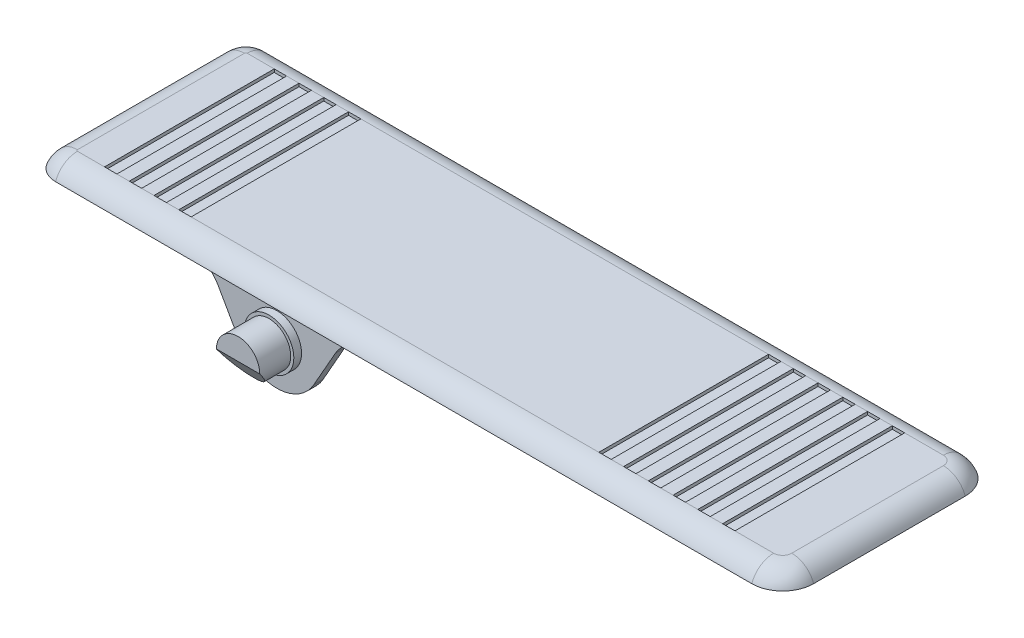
ISO-10303-21;
HEADER;
FILE_DESCRIPTION(('STEP AP214'),'2;1');
FILE_NAME('part.step','',(''),(''),'','','');
FILE_SCHEMA(('AUTOMOTIVE_DESIGN { 1 0 10303 214 1 1 1 1 }'));
ENDSEC;
DATA;
#1=APPLICATION_CONTEXT('core data for automotive mechanical design processes');
#2=APPLICATION_PROTOCOL_DEFINITION('international standard','automotive_design',2000,#1);
#3=PRODUCT_CONTEXT('',#1,'mechanical');
#4=PRODUCT('Part','Part','',(#3));
#5=PRODUCT_RELATED_PRODUCT_CATEGORY('part','',(#4));
#6=PRODUCT_DEFINITION_FORMATION('','',#4);
#7=PRODUCT_DEFINITION_CONTEXT('part definition',#1,'design');
#8=PRODUCT_DEFINITION('design','',#6,#7);
#9=PRODUCT_DEFINITION_SHAPE('','',#8);
#10=(LENGTH_UNIT() NAMED_UNIT(*) SI_UNIT(.MILLI.,.METRE.));
#11=(NAMED_UNIT(*) PLANE_ANGLE_UNIT() SI_UNIT($,.RADIAN.));
#12=(NAMED_UNIT(*) SI_UNIT($,.STERADIAN.) SOLID_ANGLE_UNIT());
#13=UNCERTAINTY_MEASURE_WITH_UNIT(LENGTH_MEASURE(1.E-05),#10,'distance_accuracy_value','');
#14=(GEOMETRIC_REPRESENTATION_CONTEXT(3) GLOBAL_UNCERTAINTY_ASSIGNED_CONTEXT((#13)) GLOBAL_UNIT_ASSIGNED_CONTEXT((#10,
#11,#12)) REPRESENTATION_CONTEXT('',''));
#15=CARTESIAN_POINT('',(0.,0.,0.));
#16=DIRECTION('',(0.,0.,1.));
#17=DIRECTION('',(1.,0.,0.));
#18=AXIS2_PLACEMENT_3D('',#15,#16,#17);
#19=CARTESIAN_POINT('',(3.81,2.54,-3.81));
#20=DIRECTION('',(0.,1.,0.));
#21=DIRECTION('',(0.,0.,1.));
#22=AXIS2_PLACEMENT_3D('',#19,#20,#21);
#23=PLANE('',#22);
#24=DIRECTION('',(0.,0.,-1.));
#25=VECTOR('',#24,1.);
#26=CARTESIAN_POINT('',(22.479,2.54,-3.59210244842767));
#27=LINE('',#26,#25);
#28=CARTESIAN_POINT('',(22.479,2.54,-3.59210244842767));
#29=VERTEX_POINT('',#28);
#30=CARTESIAN_POINT('',(22.479,2.54,-31.4598975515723));
#31=VERTEX_POINT('',#30);
#32=EDGE_CURVE('E43',#29,#31,#27,.T.);
#33=ORIENTED_EDGE('',*,*,#32,.F.);
#34=DIRECTION('',(-1.,0.,0.));
#35=VECTOR('',#34,1.);
#36=CARTESIAN_POINT('',(118.11,2.54,-3.59210244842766));
#37=LINE('',#36,#35);
#38=CARTESIAN_POINT('',(89.408,2.54,-3.59210244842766));
#39=VERTEX_POINT('',#38);
#40=EDGE_CURVE('E985',#29,#39,#37,.F.);
#41=ORIENTED_EDGE('',*,*,#40,.T.);
#42=DIRECTION('',(0.,0.,1.));
#43=VECTOR('',#42,1.);
#44=CARTESIAN_POINT('',(89.408,2.54,-31.4598975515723));
#45=LINE('',#44,#43);
#46=CARTESIAN_POINT('',(89.408,2.54,-31.4598975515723));
#47=VERTEX_POINT('',#46);
#48=EDGE_CURVE('E605',#47,#39,#45,.T.);
#49=ORIENTED_EDGE('',*,*,#48,.F.);
#50=DIRECTION('',(1.,0.,0.));
#51=VECTOR('',#50,1.);
#52=CARTESIAN_POINT('',(3.80999999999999,2.54,-31.4598975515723));
#53=LINE('',#52,#51);
#54=EDGE_CURVE('E547',#47,#31,#53,.F.);
#55=ORIENTED_EDGE('',*,*,#54,.T.);
#56=EDGE_LOOP('',(#33,#41,#49,#55));
#57=FACE_BOUND('',#56,.T.);
#58=ADVANCED_FACE('F28',(#57),#23,.T.);
#59=DIRECTION('',(0.,0.,1.));
#60=VECTOR('',#59,1.);
#61=CARTESIAN_POINT('',(20.447,2.54,-31.4598975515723));
#62=LINE('',#61,#60);
#63=CARTESIAN_POINT('',(20.447,2.54,-31.4598975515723));
#64=VERTEX_POINT('',#63);
#65=CARTESIAN_POINT('',(20.447,2.54,-3.59210244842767));
#66=VERTEX_POINT('',#65);
#67=EDGE_CURVE('E520',#64,#66,#62,.T.);
#68=ORIENTED_EDGE('',*,*,#67,.F.);
#69=CARTESIAN_POINT('',(18.415,2.54,-31.4598975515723));
#70=VERTEX_POINT('',#69);
#71=EDGE_CURVE('E51',#64,#70,#53,.F.);
#72=ORIENTED_EDGE('',*,*,#71,.T.);
#73=DIRECTION('',(0.,0.,-1.));
#74=VECTOR('',#73,1.);
#75=CARTESIAN_POINT('',(18.415,2.54,-3.59210244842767));
#76=LINE('',#75,#74);
#77=CARTESIAN_POINT('',(18.415,2.54,-3.59210244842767));
#78=VERTEX_POINT('',#77);
#79=EDGE_CURVE('E1794',#78,#70,#76,.T.);
#80=ORIENTED_EDGE('',*,*,#79,.F.);
#81=EDGE_CURVE('E539',#78,#66,#37,.F.);
#82=ORIENTED_EDGE('',*,*,#81,.T.);
#83=EDGE_LOOP('',(#68,#72,#80,#82));
#84=FACE_BOUND('',#83,.T.);
#85=ADVANCED_FACE('F537',(#84),#23,.T.);
#86=DIRECTION('',(0.,0.,1.));
#87=VECTOR('',#86,1.);
#88=CARTESIAN_POINT('',(16.383,2.54,-31.4598975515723));
#89=LINE('',#88,#87);
#90=CARTESIAN_POINT('',(16.383,2.54,-31.4598975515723));
#91=VERTEX_POINT('',#90);
#92=CARTESIAN_POINT('',(16.383,2.54,-3.59210244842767));
#93=VERTEX_POINT('',#92);
#94=EDGE_CURVE('E1103',#91,#93,#89,.T.);
#95=ORIENTED_EDGE('',*,*,#94,.F.);
#96=CARTESIAN_POINT('',(14.351,2.54,-31.4598975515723));
#97=VERTEX_POINT('',#96);
#98=EDGE_CURVE('E548',#91,#97,#53,.F.);
#99=ORIENTED_EDGE('',*,*,#98,.T.);
#100=DIRECTION('',(0.,0.,-1.));
#101=VECTOR('',#100,1.);
#102=CARTESIAN_POINT('',(14.351,2.54,-3.59210244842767));
#103=LINE('',#102,#101);
#104=CARTESIAN_POINT('',(14.351,2.54,-3.59210244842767));
#105=VERTEX_POINT('',#104);
#106=EDGE_CURVE('E1105',#105,#97,#103,.T.);
#107=ORIENTED_EDGE('',*,*,#106,.F.);
#108=EDGE_CURVE('E1095',#105,#93,#37,.F.);
#109=ORIENTED_EDGE('',*,*,#108,.T.);
#110=EDGE_LOOP('',(#95,#99,#107,#109));
#111=FACE_BOUND('',#110,.T.);
#112=ADVANCED_FACE('F1101',(#111),#23,.T.);
#113=DIRECTION('',(0.,0.,1.));
#114=VECTOR('',#113,1.);
#115=CARTESIAN_POINT('',(12.319,2.54,-31.4598975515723));
#116=LINE('',#115,#114);
#117=CARTESIAN_POINT('',(12.319,2.54,-31.4598975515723));
#118=VERTEX_POINT('',#117);
#119=CARTESIAN_POINT('',(12.319,2.54,-3.59210244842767));
#120=VERTEX_POINT('',#119);
#121=EDGE_CURVE('E1010',#118,#120,#116,.T.);
#122=ORIENTED_EDGE('',*,*,#121,.F.);
#123=CARTESIAN_POINT('',(10.287,2.54,-31.4598975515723));
#124=VERTEX_POINT('',#123);
#125=EDGE_CURVE('E553',#118,#124,#53,.F.);
#126=ORIENTED_EDGE('',*,*,#125,.T.);
#127=DIRECTION('',(0.,0.,-1.));
#128=VECTOR('',#127,1.);
#129=CARTESIAN_POINT('',(10.287,2.54,-3.59210244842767));
#130=LINE('',#129,#128);
#131=CARTESIAN_POINT('',(10.287,2.54,-3.59210244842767));
#132=VERTEX_POINT('',#131);
#133=EDGE_CURVE('E1007',#132,#124,#130,.T.);
#134=ORIENTED_EDGE('',*,*,#133,.F.);
#135=EDGE_CURVE('E984',#132,#120,#37,.F.);
#136=ORIENTED_EDGE('',*,*,#135,.T.);
#137=EDGE_LOOP('',(#122,#126,#134,#136));
#138=FACE_BOUND('',#137,.T.);
#139=ADVANCED_FACE('F1005',(#138),#23,.T.);
#140=DIRECTION('',(0.,0.,-1.));
#141=VECTOR('',#140,1.);
#142=CARTESIAN_POINT('',(91.44,2.54,-3.59210244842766));
#143=LINE('',#142,#141);
#144=CARTESIAN_POINT('',(91.44,2.54,-3.59210244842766));
#145=VERTEX_POINT('',#144);
#146=CARTESIAN_POINT('',(91.44,2.54,-31.4598975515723));
#147=VERTEX_POINT('',#146);
#148=EDGE_CURVE('E592',#145,#147,#143,.T.);
#149=ORIENTED_EDGE('',*,*,#148,.F.);
#150=CARTESIAN_POINT('',(93.472,2.54,-3.59210244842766));
#151=VERTEX_POINT('',#150);
#152=EDGE_CURVE('E1093',#145,#151,#37,.F.);
#153=ORIENTED_EDGE('',*,*,#152,.T.);
#154=DIRECTION('',(0.,0.,1.));
#155=VECTOR('',#154,1.);
#156=CARTESIAN_POINT('',(93.472,2.54,-31.4598975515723));
#157=LINE('',#156,#155);
#158=CARTESIAN_POINT('',(93.472,2.54,-31.4598975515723));
#159=VERTEX_POINT('',#158);
#160=EDGE_CURVE('E595',#159,#151,#157,.T.);
#161=ORIENTED_EDGE('',*,*,#160,.F.);
#162=EDGE_CURVE('E551',#159,#147,#53,.F.);
#163=ORIENTED_EDGE('',*,*,#162,.T.);
#164=EDGE_LOOP('',(#149,#153,#161,#163));
#165=FACE_BOUND('',#164,.T.);
#166=ADVANCED_FACE('F591',(#165),#23,.T.);
#167=DIRECTION('',(0.,0.,-1.));
#168=VECTOR('',#167,1.);
#169=CARTESIAN_POINT('',(95.504,2.54,-3.59210244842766));
#170=LINE('',#169,#168);
#171=CARTESIAN_POINT('',(95.504,2.54,-3.59210244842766));
#172=VERTEX_POINT('',#171);
#173=CARTESIAN_POINT('',(95.504,2.54,-31.4598975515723));
#174=VERTEX_POINT('',#173);
#175=EDGE_CURVE('E629',#172,#174,#170,.T.);
#176=ORIENTED_EDGE('',*,*,#175,.F.);
#177=CARTESIAN_POINT('',(97.536,2.54,-3.59210244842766));
#178=VERTEX_POINT('',#177);
#179=EDGE_CURVE('E1091',#172,#178,#37,.F.);
#180=ORIENTED_EDGE('',*,*,#179,.T.);
#181=DIRECTION('',(0.,0.,1.));
#182=VECTOR('',#181,1.);
#183=CARTESIAN_POINT('',(97.536,2.54,-31.4598975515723));
#184=LINE('',#183,#182);
#185=CARTESIAN_POINT('',(97.536,2.54,-31.4598975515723));
#186=VERTEX_POINT('',#185);
#187=EDGE_CURVE('E667',#186,#178,#184,.T.);
#188=ORIENTED_EDGE('',*,*,#187,.F.);
#189=EDGE_CURVE('E576',#186,#174,#53,.F.);
#190=ORIENTED_EDGE('',*,*,#189,.T.);
#191=EDGE_LOOP('',(#176,#180,#188,#190));
#192=FACE_BOUND('',#191,.T.);
#193=ADVANCED_FACE('F1900',(#192),#23,.T.);
#194=DIRECTION('',(0.,0.,-1.));
#195=VECTOR('',#194,1.);
#196=CARTESIAN_POINT('',(99.568,2.54,-3.59210244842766));
#197=LINE('',#196,#195);
#198=CARTESIAN_POINT('',(99.568,2.54,-3.59210244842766));
#199=VERTEX_POINT('',#198);
#200=CARTESIAN_POINT('',(99.568,2.54,-31.4598975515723));
#201=VERTEX_POINT('',#200);
#202=EDGE_CURVE('E655',#199,#201,#197,.T.);
#203=ORIENTED_EDGE('',*,*,#202,.F.);
#204=CARTESIAN_POINT('',(101.6,2.54,-3.59210244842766));
#205=VERTEX_POINT('',#204);
#206=EDGE_CURVE('E1089',#199,#205,#37,.F.);
#207=ORIENTED_EDGE('',*,*,#206,.T.);
#208=DIRECTION('',(0.,0.,1.));
#209=VECTOR('',#208,1.);
#210=CARTESIAN_POINT('',(101.6,2.54,-31.4598975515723));
#211=LINE('',#210,#209);
#212=CARTESIAN_POINT('',(101.6,2.54,-31.4598975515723));
#213=VERTEX_POINT('',#212);
#214=EDGE_CURVE('E698',#213,#205,#211,.T.);
#215=ORIENTED_EDGE('',*,*,#214,.F.);
#216=EDGE_CURVE('E570',#213,#201,#53,.F.);
#217=ORIENTED_EDGE('',*,*,#216,.T.);
#218=EDGE_LOOP('',(#203,#207,#215,#217));
#219=FACE_BOUND('',#218,.T.);
#220=ADVANCED_FACE('F1219',(#219),#23,.T.);
#221=DIRECTION('',(0.,0.,-1.));
#222=VECTOR('',#221,1.);
#223=CARTESIAN_POINT('',(103.632,2.54,-3.59210244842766));
#224=LINE('',#223,#222);
#225=CARTESIAN_POINT('',(103.632,2.54,-3.59210244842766));
#226=VERTEX_POINT('',#225);
#227=CARTESIAN_POINT('',(103.632,2.54,-31.4598975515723));
#228=VERTEX_POINT('',#227);
#229=EDGE_CURVE('E686',#226,#228,#224,.T.);
#230=ORIENTED_EDGE('',*,*,#229,.F.);
#231=CARTESIAN_POINT('',(105.664,2.54,-3.59210244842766));
#232=VERTEX_POINT('',#231);
#233=EDGE_CURVE('E1087',#226,#232,#37,.F.);
#234=ORIENTED_EDGE('',*,*,#233,.T.);
#235=DIRECTION('',(0.,0.,1.));
#236=VECTOR('',#235,1.);
#237=CARTESIAN_POINT('',(105.664,2.54,-31.4598975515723));
#238=LINE('',#237,#236);
#239=CARTESIAN_POINT('',(105.664,2.54,-31.4598975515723));
#240=VERTEX_POINT('',#239);
#241=EDGE_CURVE('E729',#240,#232,#238,.T.);
#242=ORIENTED_EDGE('',*,*,#241,.F.);
#243=EDGE_CURVE('E564',#240,#228,#53,.F.);
#244=ORIENTED_EDGE('',*,*,#243,.T.);
#245=EDGE_LOOP('',(#230,#234,#242,#244));
#246=FACE_BOUND('',#245,.T.);
#247=ADVANCED_FACE('F1214',(#246),#23,.T.);
#248=DIRECTION('',(0.,0.,-1.));
#249=VECTOR('',#248,1.);
#250=CARTESIAN_POINT('',(107.696,2.54,-3.59210244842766));
#251=LINE('',#250,#249);
#252=CARTESIAN_POINT('',(107.696,2.54,-3.59210244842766));
#253=VERTEX_POINT('',#252);
#254=CARTESIAN_POINT('',(107.696,2.54,-31.4598975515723));
#255=VERTEX_POINT('',#254);
#256=EDGE_CURVE('E717',#253,#255,#251,.T.);
#257=ORIENTED_EDGE('',*,*,#256,.F.);
#258=CARTESIAN_POINT('',(109.728,2.54,-3.59210244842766));
#259=VERTEX_POINT('',#258);
#260=EDGE_CURVE('E1086',#253,#259,#37,.F.);
#261=ORIENTED_EDGE('',*,*,#260,.T.);
#262=DIRECTION('',(0.,0.,1.));
#263=VECTOR('',#262,1.);
#264=CARTESIAN_POINT('',(109.728,2.54,-31.4598975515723));
#265=LINE('',#264,#263);
#266=CARTESIAN_POINT('',(109.728,2.54,-31.4598975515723));
#267=VERTEX_POINT('',#266);
#268=EDGE_CURVE('E760',#267,#259,#265,.T.);
#269=ORIENTED_EDGE('',*,*,#268,.F.);
#270=EDGE_CURVE('E558',#267,#255,#53,.F.);
#271=ORIENTED_EDGE('',*,*,#270,.T.);
#272=EDGE_LOOP('',(#257,#261,#269,#271));
#273=FACE_BOUND('',#272,.T.);
#274=ADVANCED_FACE('F1204',(#273),#23,.T.);
#275=DIRECTION('',(0.,0.,-1.));
#276=VECTOR('',#275,1.);
#277=CARTESIAN_POINT('',(111.76,2.54,-3.59210244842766));
#278=LINE('',#277,#276);
#279=CARTESIAN_POINT('',(111.76,2.54,-3.59210244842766));
#280=VERTEX_POINT('',#279);
#281=CARTESIAN_POINT('',(111.76,2.54,-31.4598975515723));
#282=VERTEX_POINT('',#281);
#283=EDGE_CURVE('E748',#280,#282,#278,.T.);
#284=ORIENTED_EDGE('',*,*,#283,.F.);
#285=CARTESIAN_POINT('',(118.11,2.54,-3.59210244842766));
#286=VERTEX_POINT('',#285);
#287=EDGE_CURVE('E979',#280,#286,#37,.F.);
#288=ORIENTED_EDGE('',*,*,#287,.T.);
#289=CARTESIAN_POINT('',(118.11,2.54,-5.08));
#290=DIRECTION('',(0.,1.,0.));
#291=DIRECTION('',(0.,0.,1.));
#292=AXIS2_PLACEMENT_3D('',#289,#290,#291);
#293=CIRCLE('',#292,1.48789755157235);
#294=CARTESIAN_POINT('',(119.597897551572,2.54,-5.08));
#295=VERTEX_POINT('',#294);
#296=EDGE_CURVE('E983',#286,#295,#293,.T.);
#297=ORIENTED_EDGE('',*,*,#296,.T.);
#298=DIRECTION('',(0.,0.,-1.));
#299=VECTOR('',#298,1.);
#300=CARTESIAN_POINT('',(119.597897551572,2.54,-29.972));
#301=LINE('',#300,#299);
#302=CARTESIAN_POINT('',(119.597897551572,2.54,-29.972));
#303=VERTEX_POINT('',#302);
#304=EDGE_CURVE('E989',#295,#303,#301,.T.);
#305=ORIENTED_EDGE('',*,*,#304,.T.);
#306=CARTESIAN_POINT('',(118.11,2.54,-29.972));
#307=DIRECTION('',(0.,1.,0.));
#308=DIRECTION('',(0.,0.,1.));
#309=AXIS2_PLACEMENT_3D('',#306,#307,#308);
#310=CIRCLE('',#309,1.48789755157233);
#311=CARTESIAN_POINT('',(118.11,2.54,-31.4598975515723));
#312=VERTEX_POINT('',#311);
#313=EDGE_CURVE('E993',#303,#312,#310,.T.);
#314=ORIENTED_EDGE('',*,*,#313,.T.);
#315=EDGE_CURVE('E550',#312,#282,#53,.F.);
#316=ORIENTED_EDGE('',*,*,#315,.T.);
#317=EDGE_LOOP('',(#284,#288,#297,#305,#314,#316));
#318=FACE_BOUND('',#317,.T.);
#319=ADVANCED_FACE('F1084',(#318),#23,.T.);
#320=CARTESIAN_POINT('',(3.81,0.,-3.81));
#321=DIRECTION('',(0.,1.,0.));
#322=DIRECTION('',(0.,0.,1.));
#323=AXIS2_PLACEMENT_3D('',#320,#321,#322);
#324=PLANE('',#323);
#325=DIRECTION('',(0.,0.,1.));
#326=VECTOR('',#325,1.);
#327=CARTESIAN_POINT('',(119.634,0.,-30.988));
#328=LINE('',#327,#326);
#329=CARTESIAN_POINT('',(119.634,0.,-30.988));
#330=VERTEX_POINT('',#329);
#331=CARTESIAN_POINT('',(119.634,0.,-4.064));
#332=VERTEX_POINT('',#331);
#333=EDGE_CURVE('E796',#330,#332,#328,.T.);
#334=ORIENTED_EDGE('',*,*,#333,.F.);
#335=CARTESIAN_POINT('',(118.872,0.,-30.988));
#336=DIRECTION('',(0.,1.,0.));
#337=DIRECTION('',(0.,0.,1.));
#338=AXIS2_PLACEMENT_3D('',#335,#336,#337);
#339=CIRCLE('',#338,0.761999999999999);
#340=CARTESIAN_POINT('',(118.11,0.,-30.988));
#341=VERTEX_POINT('',#340);
#342=EDGE_CURVE('E804',#330,#341,#339,.T.);
#343=ORIENTED_EDGE('',*,*,#342,.T.);
#344=DIRECTION('',(0.,0.,-1.));
#345=VECTOR('',#344,1.);
#346=CARTESIAN_POINT('',(118.11,0.,-4.064));
#347=LINE('',#346,#345);
#348=CARTESIAN_POINT('',(118.11,0.,-4.064));
#349=VERTEX_POINT('',#348);
#350=EDGE_CURVE('E805',#349,#341,#347,.T.);
#351=ORIENTED_EDGE('',*,*,#350,.F.);
#352=CARTESIAN_POINT('',(118.872,0.,-4.064));
#353=DIRECTION('',(0.,1.,0.));
#354=DIRECTION('',(0.,0.,1.));
#355=AXIS2_PLACEMENT_3D('',#352,#353,#354);
#356=CIRCLE('',#355,0.761999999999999);
#357=EDGE_CURVE('E801',#349,#332,#356,.T.);
#358=ORIENTED_EDGE('',*,*,#357,.T.);
#359=EDGE_LOOP('',(#334,#343,#351,#358));
#360=FACE_BOUND('',#359,.T.);
#361=DIRECTION('',(1.,0.,0.));
#362=VECTOR('',#361,1.);
#363=CARTESIAN_POINT('',(5.08,0.,-31.75));
#364=LINE('',#363,#362);
#365=CARTESIAN_POINT('',(5.842,0.,-31.75));
#366=VERTEX_POINT('',#365);
#367=CARTESIAN_POINT('',(110.236,0.,-31.75));
#368=VERTEX_POINT('',#367);
#369=EDGE_CURVE('E845',#366,#368,#364,.T.);
#370=ORIENTED_EDGE('',*,*,#369,.F.);
#371=CARTESIAN_POINT('',(5.842,0.,-30.988));
#372=DIRECTION('',(0.,1.,0.));
#373=DIRECTION('',(0.,0.,1.));
#374=AXIS2_PLACEMENT_3D('',#371,#372,#373);
#375=CIRCLE('',#374,0.762);
#376=CARTESIAN_POINT('',(5.08,0.,-30.988));
#377=VERTEX_POINT('',#376);
#378=EDGE_CURVE('E2155',#366,#377,#375,.T.);
#379=ORIENTED_EDGE('',*,*,#378,.T.);
#380=CARTESIAN_POINT('',(5.842,0.,-30.988));
#381=DIRECTION('',(0.,1.,0.));
#382=DIRECTION('',(0.,0.,1.));
#383=AXIS2_PLACEMENT_3D('',#380,#381,#382);
#384=CIRCLE('',#383,0.762);
#385=CARTESIAN_POINT('',(5.842,0.,-30.226));
#386=VERTEX_POINT('',#385);
#387=EDGE_CURVE('E2153',#377,#386,#384,.T.);
#388=ORIENTED_EDGE('',*,*,#387,.T.);
#389=DIRECTION('',(1.,0.,0.));
#390=VECTOR('',#389,1.);
#391=CARTESIAN_POINT('',(5.08,0.,-30.226));
#392=LINE('',#391,#390);
#393=CARTESIAN_POINT('',(110.236,0.,-30.226));
#394=VERTEX_POINT('',#393);
#395=EDGE_CURVE('E862',#386,#394,#392,.T.);
#396=ORIENTED_EDGE('',*,*,#395,.T.);
#397=CARTESIAN_POINT('',(110.236,0.,-30.988));
#398=DIRECTION('',(0.,1.,0.));
#399=DIRECTION('',(0.,0.,1.));
#400=AXIS2_PLACEMENT_3D('',#397,#398,#399);
#401=CIRCLE('',#400,0.762);
#402=CARTESIAN_POINT('',(110.998,0.,-30.988));
#403=VERTEX_POINT('',#402);
#404=EDGE_CURVE('E2159',#394,#403,#401,.T.);
#405=ORIENTED_EDGE('',*,*,#404,.T.);
#406=CARTESIAN_POINT('',(110.236,0.,-30.988));
#407=DIRECTION('',(0.,1.,0.));
#408=DIRECTION('',(0.,0.,1.));
#409=AXIS2_PLACEMENT_3D('',#406,#407,#408);
#410=CIRCLE('',#409,0.762);
#411=EDGE_CURVE('E2157',#403,#368,#410,.T.);
#412=ORIENTED_EDGE('',*,*,#411,.T.);
#413=EDGE_LOOP('',(#370,#379,#388,#396,#405,#412));
#414=FACE_BOUND('',#413,.T.);
#415=CARTESIAN_POINT('',(110.236,0.,-4.064));
#416=DIRECTION('',(0.,1.,0.));
#417=DIRECTION('',(0.,0.,1.));
#418=AXIS2_PLACEMENT_3D('',#415,#416,#417);
#419=CIRCLE('',#418,0.762);
#420=CARTESIAN_POINT('',(110.236,0.,-3.302));
#421=VERTEX_POINT('',#420);
#422=CARTESIAN_POINT('',(110.998,0.,-4.064));
#423=VERTEX_POINT('',#422);
#424=EDGE_CURVE('E2216',#421,#423,#419,.T.);
#425=ORIENTED_EDGE('',*,*,#424,.T.);
#426=CARTESIAN_POINT('',(110.236,0.,-4.064));
#427=DIRECTION('',(0.,1.,0.));
#428=DIRECTION('',(0.,0.,1.));
#429=AXIS2_PLACEMENT_3D('',#426,#427,#428);
#430=CIRCLE('',#429,0.762);
#431=CARTESIAN_POINT('',(110.236,0.,-4.826));
#432=VERTEX_POINT('',#431);
#433=EDGE_CURVE('E2219',#423,#432,#430,.T.);
#434=ORIENTED_EDGE('',*,*,#433,.T.);
#435=DIRECTION('',(1.,0.,0.));
#436=VECTOR('',#435,1.);
#437=CARTESIAN_POINT('',(5.08,0.,-4.826));
#438=LINE('',#437,#436);
#439=CARTESIAN_POINT('',(5.842,0.,-4.826));
#440=VERTEX_POINT('',#439);
#441=EDGE_CURVE('E927',#440,#432,#438,.T.);
#442=ORIENTED_EDGE('',*,*,#441,.F.);
#443=CARTESIAN_POINT('',(5.842,0.,-4.064));
#444=DIRECTION('',(0.,1.,0.));
#445=DIRECTION('',(0.,0.,1.));
#446=AXIS2_PLACEMENT_3D('',#443,#444,#445);
#447=CIRCLE('',#446,0.762);
#448=CARTESIAN_POINT('',(5.08,0.,-4.064));
#449=VERTEX_POINT('',#448);
#450=EDGE_CURVE('E2236',#440,#449,#447,.T.);
#451=ORIENTED_EDGE('',*,*,#450,.T.);
#452=CARTESIAN_POINT('',(5.842,0.,-4.064));
#453=DIRECTION('',(0.,1.,0.));
#454=DIRECTION('',(0.,0.,1.));
#455=AXIS2_PLACEMENT_3D('',#452,#453,#454);
#456=CIRCLE('',#455,0.762);
#457=CARTESIAN_POINT('',(5.842,0.,-3.302));
#458=VERTEX_POINT('',#457);
#459=EDGE_CURVE('E2223',#449,#458,#456,.T.);
#460=ORIENTED_EDGE('',*,*,#459,.T.);
#461=DIRECTION('',(1.,0.,0.));
#462=VECTOR('',#461,1.);
#463=CARTESIAN_POINT('',(5.08,0.,-3.302));
#464=LINE('',#463,#462);
#465=EDGE_CURVE('E911',#458,#421,#464,.T.);
#466=ORIENTED_EDGE('',*,*,#465,.T.);
#467=EDGE_LOOP('',(#425,#434,#442,#451,#460,#466));
#468=FACE_BOUND('',#467,.T.);
#469=CARTESIAN_POINT('',(3.81,0.,-3.81));
#470=DIRECTION('',(0.,1.,0.));
#471=DIRECTION('',(0.,0.,1.));
#472=AXIS2_PLACEMENT_3D('',#469,#470,#471);
#473=CIRCLE('',#472,3.81);
#474=CARTESIAN_POINT('',(0.,0.,-3.81000000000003));
#475=VERTEX_POINT('',#474);
#476=CARTESIAN_POINT('',(3.81000000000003,0.,0.));
#477=VERTEX_POINT('',#476);
#478=EDGE_CURVE('E958',#475,#477,#473,.T.);
#479=ORIENTED_EDGE('',*,*,#478,.F.);
#480=DIRECTION('',(0.,0.,-1.));
#481=VECTOR('',#480,1.);
#482=CARTESIAN_POINT('',(0.,0.,-3.81000000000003));
#483=LINE('',#482,#481);
#484=CARTESIAN_POINT('',(0.,0.,-31.242));
#485=VERTEX_POINT('',#484);
#486=EDGE_CURVE('E977',#475,#485,#483,.T.);
#487=ORIENTED_EDGE('',*,*,#486,.T.);
#488=CARTESIAN_POINT('',(3.81,0.,-31.242));
#489=DIRECTION('',(0.,1.,0.));
#490=DIRECTION('',(0.,0.,1.));
#491=AXIS2_PLACEMENT_3D('',#488,#489,#490);
#492=CIRCLE('',#491,3.81);
#493=CARTESIAN_POINT('',(3.81,0.,-35.052));
#494=VERTEX_POINT('',#493);
#495=EDGE_CURVE('E974',#494,#485,#492,.T.);
#496=ORIENTED_EDGE('',*,*,#495,.F.);
#497=DIRECTION('',(-1.,0.,0.));
#498=VECTOR('',#497,1.);
#499=CARTESIAN_POINT('',(118.11,0.,-35.052));
#500=LINE('',#499,#498);
#501=CARTESIAN_POINT('',(118.11,0.,-35.052));
#502=VERTEX_POINT('',#501);
#503=EDGE_CURVE('E971',#502,#494,#500,.T.);
#504=ORIENTED_EDGE('',*,*,#503,.F.);
#505=CARTESIAN_POINT('',(118.11,0.,-29.972));
#506=DIRECTION('',(0.,1.,0.));
#507=DIRECTION('',(0.,0.,1.));
#508=AXIS2_PLACEMENT_3D('',#505,#506,#507);
#509=CIRCLE('',#508,5.07999999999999);
#510=CARTESIAN_POINT('',(123.19,0.,-29.972));
#511=VERTEX_POINT('',#510);
#512=EDGE_CURVE('E968',#511,#502,#509,.T.);
#513=ORIENTED_EDGE('',*,*,#512,.F.);
#514=DIRECTION('',(0.,0.,1.));
#515=VECTOR('',#514,1.);
#516=CARTESIAN_POINT('',(123.19,0.,-29.972));
#517=LINE('',#516,#515);
#518=CARTESIAN_POINT('',(123.19,0.,-5.08));
#519=VERTEX_POINT('',#518);
#520=EDGE_CURVE('E966',#511,#519,#517,.T.);
#521=ORIENTED_EDGE('',*,*,#520,.T.);
#522=CARTESIAN_POINT('',(118.11,0.,-5.08));
#523=DIRECTION('',(0.,-1.,0.));
#524=DIRECTION('',(0.,0.,-1.));
#525=AXIS2_PLACEMENT_3D('',#522,#523,#524);
#526=CIRCLE('',#525,5.08000000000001);
#527=CARTESIAN_POINT('',(118.11,0.,0.));
#528=VERTEX_POINT('',#527);
#529=EDGE_CURVE('E964',#519,#528,#526,.T.);
#530=ORIENTED_EDGE('',*,*,#529,.T.);
#531=DIRECTION('',(1.,0.,0.));
#532=VECTOR('',#531,1.);
#533=CARTESIAN_POINT('',(3.81000000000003,0.,0.));
#534=LINE('',#533,#532);
#535=EDGE_CURVE('E961',#477,#528,#534,.T.);
#536=ORIENTED_EDGE('',*,*,#535,.F.);
#537=EDGE_LOOP('',(#479,#487,#496,#504,#513,#521,#530,#536));
#538=FACE_BOUND('',#537,.T.);
#539=CARTESIAN_POINT('',(14.605,0.,-17.526));
#540=DIRECTION('',(0.,1.,0.));
#541=DIRECTION('',(0.,0.,1.));
#542=AXIS2_PLACEMENT_3D('',#539,#540,#541);
#543=CIRCLE('',#542,9.271);
#544=CARTESIAN_POINT('',(14.605,0.,-8.25500000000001));
#545=VERTEX_POINT('',#544);
#546=EDGE_CURVE('E11',#545,#545,#543,.F.);
#547=ORIENTED_EDGE('',*,*,#546,.F.);
#548=EDGE_LOOP('',(#547));
#549=FACE_BOUND('',#548,.T.);
#550=ADVANCED_FACE('F1073',(#360,#414,#468,#538,#549),#324,.F.);
#551=CARTESIAN_POINT('',(36.83,-7.5184,3.048));
#552=DIRECTION('',(0.,0.,-1.));
#553=DIRECTION('',(-1.,0.,0.));
#554=AXIS2_PLACEMENT_3D('',#551,#552,#553);
#555=CYLINDRICAL_SURFACE('',#554,3.55600000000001);
#556=CARTESIAN_POINT('',(36.83,-7.5184,-2.032));
#557=DIRECTION('',(0.,0.,1.));
#558=DIRECTION('',(1.,0.,0.));
#559=AXIS2_PLACEMENT_3D('',#556,#557,#558);
#560=CIRCLE('',#559,3.55600000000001);
#561=CARTESIAN_POINT('',(40.386,-7.5184,-2.032));
#562=VERTEX_POINT('',#561);
#563=EDGE_CURVE('E888',#562,#562,#560,.F.);
#564=ORIENTED_EDGE('',*,*,#563,.F.);
#565=EDGE_LOOP('',(#564));
#566=FACE_BOUND('',#565,.T.);
#567=CARTESIAN_POINT('',(36.83,-7.5184,3.048));
#568=DIRECTION('',(0.,0.,1.));
#569=DIRECTION('',(1.,0.,0.));
#570=AXIS2_PLACEMENT_3D('',#567,#568,#569);
#571=CIRCLE('',#570,3.55600000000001);
#572=CARTESIAN_POINT('',(40.386,-7.5184,3.048));
#573=VERTEX_POINT('',#572);
#574=CARTESIAN_POINT('',(33.274,-7.5184,3.048));
#575=VERTEX_POINT('',#574);
#576=EDGE_CURVE('E885',#573,#575,#571,.T.);
#577=ORIENTED_EDGE('',*,*,#576,.F.);
#578=CARTESIAN_POINT('',(36.83,-7.5184,3.048));
#579=DIRECTION('',(0.,-0.581238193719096,0.813733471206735));
#580=DIRECTION('',(0.,-0.813733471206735,-0.581238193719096));
#581=AXIS2_PLACEMENT_3D('',#578,#579,#580);
#582=ELLIPSE('',#581,4.36998123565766,3.55600000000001);
#583=EDGE_CURVE('E882',#575,#573,#582,.T.);
#584=ORIENTED_EDGE('',*,*,#583,.F.);
#585=EDGE_LOOP('',(#577,#584));
#586=FACE_BOUND('',#585,.T.);
#587=ADVANCED_FACE('F1210',(#566,#586),#555,.T.);
#588=CARTESIAN_POINT('',(36.83,-7.5184,3.048));
#589=DIRECTION('',(0.,0.,1.));
#590=DIRECTION('',(1.,0.,0.));
#591=AXIS2_PLACEMENT_3D('',#588,#589,#590);
#592=PLANE('',#591);
#593=ORIENTED_EDGE('',*,*,#576,.T.);
#594=DIRECTION('',(1.,0.,0.));
#595=VECTOR('',#594,1.);
#596=CARTESIAN_POINT('',(36.83,-7.5184,3.048));
#597=LINE('',#596,#595);
#598=EDGE_CURVE('E2115',#575,#573,#597,.T.);
#599=ORIENTED_EDGE('',*,*,#598,.T.);
#600=EDGE_LOOP('',(#593,#599));
#601=FACE_BOUND('',#600,.T.);
#602=ADVANCED_FACE('F1391',(#601),#592,.T.);
#603=CARTESIAN_POINT('',(36.83,-7.5184,-2.032));
#604=DIRECTION('',(0.,0.,1.));
#605=DIRECTION('',(1.,0.,0.));
#606=AXIS2_PLACEMENT_3D('',#603,#604,#605);
#607=PLANE('',#606);
#608=CARTESIAN_POINT('',(36.83,-7.5184,-2.032));
#609=DIRECTION('',(0.,0.,1.));
#610=DIRECTION('',(1.,0.,0.));
#611=AXIS2_PLACEMENT_3D('',#608,#609,#610);
#612=CIRCLE('',#611,4.064);
#613=CARTESIAN_POINT('',(40.894,-7.5184,-2.032));
#614=VERTEX_POINT('',#613);
#615=EDGE_CURVE('E889',#614,#614,#612,.T.);
#616=ORIENTED_EDGE('',*,*,#615,.T.);
#617=EDGE_LOOP('',(#616));
#618=FACE_BOUND('',#617,.T.);
#619=ORIENTED_EDGE('',*,*,#563,.T.);
#620=EDGE_LOOP('',(#619));
#621=FACE_BOUND('',#620,.T.);
#622=ADVANCED_FACE('F1200',(#618,#621),#607,.T.);
#623=CARTESIAN_POINT('',(36.83,-7.5184,-3.302));
#624=DIRECTION('',(0.,0.,-1.));
#625=DIRECTION('',(-1.,0.,0.));
#626=AXIS2_PLACEMENT_3D('',#623,#624,#625);
#627=PLANE('',#626);
#628=ORIENTED_EDGE('',*,*,#465,.F.);
#629=DIRECTION('',(0.,-1.,0.));
#630=VECTOR('',#629,1.);
#631=CARTESIAN_POINT('',(5.842,-1.524,-3.302));
#632=LINE('',#631,#630);
#633=CARTESIAN_POINT('',(5.842,-1.524,-3.302));
#634=VERTEX_POINT('',#633);
#635=EDGE_CURVE('E2240',#458,#634,#632,.T.);
#636=ORIENTED_EDGE('',*,*,#635,.T.);
#637=DIRECTION('',(1.,0.,0.));
#638=VECTOR('',#637,1.);
#639=CARTESIAN_POINT('',(5.08,-1.524,-3.302));
#640=LINE('',#639,#638);
#641=CARTESIAN_POINT('',(21.7012517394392,-1.524,-3.302));
#642=VERTEX_POINT('',#641);
#643=EDGE_CURVE('E898',#634,#642,#640,.T.);
#644=ORIENTED_EDGE('',*,*,#643,.T.);
#645=CARTESIAN_POINT('',(21.7012517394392,-7.874,-3.302));
#646=DIRECTION('',(0.,0.,-1.));
#647=DIRECTION('',(-1.,0.,0.));
#648=AXIS2_PLACEMENT_3D('',#645,#646,#647);
#649=CIRCLE('',#648,6.35);
#650=CARTESIAN_POINT('',(27.2247270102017,-4.7413141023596,-3.302));
#651=VERTEX_POINT('',#650);
#652=EDGE_CURVE('E2113',#642,#651,#649,.T.);
#653=ORIENTED_EDGE('',*,*,#652,.T.);
#654=DIRECTION('',(-0.493336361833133,0.869838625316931,0.));
#655=VECTOR('',#654,1.);
#656=CARTESIAN_POINT('',(30.7541772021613,-10.9643544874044,-3.302));
#657=LINE('',#656,#655);
#658=CARTESIAN_POINT('',(30.7541772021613,-10.9643544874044,-3.302));
#659=VERTEX_POINT('',#658);
#660=EDGE_CURVE('E901',#659,#651,#657,.T.);
#661=ORIENTED_EDGE('',*,*,#660,.F.);
#662=CARTESIAN_POINT('',(36.83,-7.5184,-3.302));
#663=DIRECTION('',(0.,0.,-1.));
#664=DIRECTION('',(-1.,0.,0.));
#665=AXIS2_PLACEMENT_3D('',#662,#663,#664);
#666=CIRCLE('',#665,6.98499999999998);
#667=CARTESIAN_POINT('',(42.9058227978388,-10.9643544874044,-3.302));
#668=VERTEX_POINT('',#667);
#669=EDGE_CURVE('E904',#668,#659,#666,.T.);
#670=ORIENTED_EDGE('',*,*,#669,.F.);
#671=DIRECTION('',(0.493336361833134,0.86983862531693,0.));
#672=VECTOR('',#671,1.);
#673=CARTESIAN_POINT('',(42.9058227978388,-10.9643544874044,-3.302));
#674=LINE('',#673,#672);
#675=CARTESIAN_POINT('',(46.4352729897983,-4.7413141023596,-3.302));
#676=VERTEX_POINT('',#675);
#677=EDGE_CURVE('E906',#668,#676,#674,.T.);
#678=ORIENTED_EDGE('',*,*,#677,.T.);
#679=CARTESIAN_POINT('',(51.9587482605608,-7.874,-3.302));
#680=DIRECTION('',(0.,0.,-1.));
#681=DIRECTION('',(-1.,0.,0.));
#682=AXIS2_PLACEMENT_3D('',#679,#680,#681);
#683=CIRCLE('',#682,6.35);
#684=CARTESIAN_POINT('',(51.9587482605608,-1.524,-3.302));
#685=VERTEX_POINT('',#684);
#686=EDGE_CURVE('E2130',#676,#685,#683,.T.);
#687=ORIENTED_EDGE('',*,*,#686,.T.);
#688=DIRECTION('',(1.,0.,0.));
#689=VECTOR('',#688,1.);
#690=CARTESIAN_POINT('',(48.26,-1.524,-3.302));
#691=LINE('',#690,#689);
#692=CARTESIAN_POINT('',(110.236,-1.524,-3.302));
#693=VERTEX_POINT('',#692);
#694=EDGE_CURVE('E909',#685,#693,#691,.T.);
#695=ORIENTED_EDGE('',*,*,#694,.T.);
#696=DIRECTION('',(0.,-1.,0.));
#697=VECTOR('',#696,1.);
#698=CARTESIAN_POINT('',(110.236,-7.5184,-3.302));
#699=LINE('',#698,#697);
#700=EDGE_CURVE('E2234',#693,#421,#699,.F.);
#701=ORIENTED_EDGE('',*,*,#700,.T.);
#702=EDGE_LOOP('',(#628,#636,#644,#653,#661,#670,#678,#687,#695,#701));
#703=FACE_BOUND('',#702,.T.);
#704=CARTESIAN_POINT('',(36.83,-7.5184,-3.302));
#705=DIRECTION('',(0.,0.,-1.));
#706=DIRECTION('',(-1.,0.,0.));
#707=AXIS2_PLACEMENT_3D('',#704,#705,#706);
#708=CIRCLE('',#707,4.064);
#709=CARTESIAN_POINT('',(32.766,-7.5184,-3.302));
#710=VERTEX_POINT('',#709);
#711=EDGE_CURVE('E2120',#710,#710,#708,.F.);
#712=ORIENTED_EDGE('',*,*,#711,.F.);
#713=EDGE_LOOP('',(#712));
#714=FACE_BOUND('',#713,.T.);
#715=ADVANCED_FACE('F1192',(#703,#714),#627,.F.);
#716=DIRECTION('',(0.,0.,1.));
#717=VECTOR('',#716,1.);
#718=CARTESIAN_POINT('',(8.255,2.54,-31.4598975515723));
#719=LINE('',#718,#717);
#720=CARTESIAN_POINT('',(8.255,2.54,-31.4598975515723));
#721=VERTEX_POINT('',#720);
#722=CARTESIAN_POINT('',(8.255,2.54,-3.59210244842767));
#723=VERTEX_POINT('',#722);
#724=EDGE_CURVE('E1031',#721,#723,#719,.T.);
#725=ORIENTED_EDGE('',*,*,#724,.F.);
#726=CARTESIAN_POINT('',(3.81,2.54,-31.4598975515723));
#727=VERTEX_POINT('',#726);
#728=EDGE_CURVE('E552',#721,#727,#53,.F.);
#729=ORIENTED_EDGE('',*,*,#728,.T.);
#730=CARTESIAN_POINT('',(3.81,2.54,-31.242));
#731=DIRECTION('',(0.,1.,0.));
#732=DIRECTION('',(0.,0.,1.));
#733=AXIS2_PLACEMENT_3D('',#730,#731,#732);
#734=CIRCLE('',#733,0.217897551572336);
#735=CARTESIAN_POINT('',(3.59210244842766,2.54,-31.242));
#736=VERTEX_POINT('',#735);
#737=EDGE_CURVE('E994',#727,#736,#734,.T.);
#738=ORIENTED_EDGE('',*,*,#737,.T.);
#739=DIRECTION('',(0.,0.,1.));
#740=VECTOR('',#739,1.);
#741=CARTESIAN_POINT('',(3.59210244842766,2.54,-3.81000000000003));
#742=LINE('',#741,#740);
#743=CARTESIAN_POINT('',(3.59210244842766,2.54,-3.81));
#744=VERTEX_POINT('',#743);
#745=EDGE_CURVE('E991',#736,#744,#742,.T.);
#746=ORIENTED_EDGE('',*,*,#745,.T.);
#747=CARTESIAN_POINT('',(3.81,2.54,-3.81));
#748=DIRECTION('',(0.,1.,0.));
#749=DIRECTION('',(0.,0.,1.));
#750=AXIS2_PLACEMENT_3D('',#747,#748,#749);
#751=CIRCLE('',#750,0.217897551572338);
#752=CARTESIAN_POINT('',(3.81000000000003,2.54,-3.59210244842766));
#753=VERTEX_POINT('',#752);
#754=EDGE_CURVE('E987',#744,#753,#751,.T.);
#755=ORIENTED_EDGE('',*,*,#754,.T.);
#756=EDGE_CURVE('E980',#753,#723,#37,.F.);
#757=ORIENTED_EDGE('',*,*,#756,.T.);
#758=EDGE_LOOP('',(#725,#729,#738,#746,#755,#757));
#759=FACE_BOUND('',#758,.T.);
#760=ADVANCED_FACE('F30',(#759),#23,.T.);
#761=CARTESIAN_POINT('',(3.81000000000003,-1.27,-3.59210244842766));
#762=DIRECTION('',(1.,0.,0.));
#763=DIRECTION('',(0.,0.,-1.));
#764=AXIS2_PLACEMENT_3D('',#761,#762,#763);
#765=CYLINDRICAL_SURFACE('',#764,3.81);
#766=CARTESIAN_POINT('',(3.81000000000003,-1.27,-3.59210244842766));
#767=DIRECTION('',(-1.,0.,0.));
#768=DIRECTION('',(0.,0.,1.));
#769=AXIS2_PLACEMENT_3D('',#766,#767,#768);
#770=CIRCLE('',#769,3.81);
#771=EDGE_CURVE('E952',#477,#753,#770,.T.);
#772=ORIENTED_EDGE('',*,*,#771,.F.);
#773=ORIENTED_EDGE('',*,*,#535,.T.);
#774=CARTESIAN_POINT('',(118.11,-1.27,-3.59210244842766));
#775=DIRECTION('',(1.,0.,0.));
#776=DIRECTION('',(0.,0.,-1.));
#777=AXIS2_PLACEMENT_3D('',#774,#775,#776);
#778=CIRCLE('',#777,3.81);
#779=EDGE_CURVE('E955',#286,#528,#778,.T.);
#780=ORIENTED_EDGE('',*,*,#779,.F.);
#781=ORIENTED_EDGE('',*,*,#287,.F.);
#782=DIRECTION('',(-1.,0.,0.));
#783=VECTOR('',#782,1.);
#784=CARTESIAN_POINT('',(111.76,2.54,-3.59210244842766));
#785=LINE('',#784,#783);
#786=EDGE_CURVE('E763',#280,#259,#785,.T.);
#787=ORIENTED_EDGE('',*,*,#786,.T.);
#788=ORIENTED_EDGE('',*,*,#260,.F.);
#789=DIRECTION('',(-1.,0.,0.));
#790=VECTOR('',#789,1.);
#791=CARTESIAN_POINT('',(107.696,2.54,-3.59210244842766));
#792=LINE('',#791,#790);
#793=EDGE_CURVE('E732',#253,#232,#792,.T.);
#794=ORIENTED_EDGE('',*,*,#793,.T.);
#795=ORIENTED_EDGE('',*,*,#233,.F.);
#796=DIRECTION('',(-1.,0.,0.));
#797=VECTOR('',#796,1.);
#798=CARTESIAN_POINT('',(103.632,2.54,-3.59210244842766));
#799=LINE('',#798,#797);
#800=EDGE_CURVE('E701',#226,#205,#799,.T.);
#801=ORIENTED_EDGE('',*,*,#800,.T.);
#802=ORIENTED_EDGE('',*,*,#206,.F.);
#803=DIRECTION('',(-1.,0.,0.));
#804=VECTOR('',#803,1.);
#805=CARTESIAN_POINT('',(99.568,2.54,-3.59210244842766));
#806=LINE('',#805,#804);
#807=EDGE_CURVE('E670',#199,#178,#806,.T.);
#808=ORIENTED_EDGE('',*,*,#807,.T.);
#809=ORIENTED_EDGE('',*,*,#179,.F.);
#810=DIRECTION('',(-1.,0.,0.));
#811=VECTOR('',#810,1.);
#812=CARTESIAN_POINT('',(95.504,2.54,-3.59210244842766));
#813=LINE('',#812,#811);
#814=EDGE_CURVE('E639',#172,#151,#813,.T.);
#815=ORIENTED_EDGE('',*,*,#814,.T.);
#816=ORIENTED_EDGE('',*,*,#152,.F.);
#817=DIRECTION('',(-1.,0.,0.));
#818=VECTOR('',#817,1.);
#819=CARTESIAN_POINT('',(91.44,2.54,-3.59210244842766));
#820=LINE('',#819,#818);
#821=EDGE_CURVE('E608',#145,#39,#820,.T.);
#822=ORIENTED_EDGE('',*,*,#821,.T.);
#823=ORIENTED_EDGE('',*,*,#40,.F.);
#824=DIRECTION('',(-1.,0.,0.));
#825=VECTOR('',#824,1.);
#826=CARTESIAN_POINT('',(22.479,2.54,-3.59210244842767));
#827=LINE('',#826,#825);
#828=EDGE_CURVE('E540',#29,#66,#827,.T.);
#829=ORIENTED_EDGE('',*,*,#828,.T.);
#830=ORIENTED_EDGE('',*,*,#81,.F.);
#831=DIRECTION('',(-1.,0.,0.));
#832=VECTOR('',#831,1.);
#833=CARTESIAN_POINT('',(18.415,2.54,-3.59210244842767));
#834=LINE('',#833,#832);
#835=EDGE_CURVE('E1110',#78,#93,#834,.T.);
#836=ORIENTED_EDGE('',*,*,#835,.T.);
#837=ORIENTED_EDGE('',*,*,#108,.F.);
#838=DIRECTION('',(-1.,0.,0.));
#839=VECTOR('',#838,1.);
#840=CARTESIAN_POINT('',(14.351,2.54,-3.59210244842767));
#841=LINE('',#840,#839);
#842=EDGE_CURVE('E1108',#105,#120,#841,.T.);
#843=ORIENTED_EDGE('',*,*,#842,.T.);
#844=ORIENTED_EDGE('',*,*,#135,.F.);
#845=DIRECTION('',(-1.,0.,0.));
#846=VECTOR('',#845,1.);
#847=CARTESIAN_POINT('',(10.287,2.54,-3.59210244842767));
#848=LINE('',#847,#846);
#849=EDGE_CURVE('E1034',#132,#723,#848,.T.);
#850=ORIENTED_EDGE('',*,*,#849,.T.);
#851=ORIENTED_EDGE('',*,*,#756,.F.);
#852=EDGE_LOOP('',(#772,#773,#780,#781,#787,#788,#794,#795,#801,#802,#808,#809,#815,#816,#822,
#823,#829,#830,#836,#837,#843,#844,#850,#851));
#853=FACE_BOUND('',#852,.T.);
#854=ADVANCED_FACE('F1062',(#853),#765,.T.);
#855=CARTESIAN_POINT('',(118.11,-1.27,-5.08));
#856=DIRECTION('',(0.,-1.,0.));
#857=DIRECTION('',(0.,0.,-1.));
#858=AXIS2_PLACEMENT_3D('',#855,#856,#857);
#859=DEGENERATE_TOROIDAL_SURFACE('',#858,1.48789755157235,3.81,.T.);
#860=ORIENTED_EDGE('',*,*,#779,.T.);
#861=ORIENTED_EDGE('',*,*,#529,.F.);
#862=CARTESIAN_POINT('',(119.597897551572,-1.27,-5.08));
#863=DIRECTION('',(0.,0.,-1.));
#864=DIRECTION('',(-1.,0.,0.));
#865=AXIS2_PLACEMENT_3D('',#862,#863,#864);
#866=CIRCLE('',#865,3.81);
#867=EDGE_CURVE('E949',#295,#519,#866,.T.);
#868=ORIENTED_EDGE('',*,*,#867,.F.);
#869=ORIENTED_EDGE('',*,*,#296,.F.);
#870=EDGE_LOOP('',(#860,#861,#868,#869));
#871=FACE_BOUND('',#870,.T.);
#872=ADVANCED_FACE('F1081',(#871),#859,.T.);
#873=CARTESIAN_POINT('',(3.81,-1.27,-3.81));
#874=DIRECTION('',(0.,-1.,0.));
#875=DIRECTION('',(0.,0.,-1.));
#876=AXIS2_PLACEMENT_3D('',#873,#874,#875);
#877=DEGENERATE_TOROIDAL_SURFACE('',#876,0.217897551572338,3.81,.T.);
#878=ORIENTED_EDGE('',*,*,#771,.T.);
#879=ORIENTED_EDGE('',*,*,#754,.F.);
#880=CARTESIAN_POINT('',(3.59210244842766,-1.27,-3.81));
#881=DIRECTION('',(0.,0.,-1.));
#882=DIRECTION('',(-1.,0.,0.));
#883=AXIS2_PLACEMENT_3D('',#880,#881,#882);
#884=CIRCLE('',#883,3.81);
#885=EDGE_CURVE('E946',#475,#744,#884,.T.);
#886=ORIENTED_EDGE('',*,*,#885,.F.);
#887=ORIENTED_EDGE('',*,*,#478,.T.);
#888=EDGE_LOOP('',(#878,#879,#886,#887));
#889=FACE_BOUND('',#888,.T.);
#890=ADVANCED_FACE('F1067',(#889),#877,.T.);
#891=CARTESIAN_POINT('',(119.597897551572,-1.27,-29.972));
#892=DIRECTION('',(0.,0.,1.));
#893=DIRECTION('',(1.,0.,0.));
#894=AXIS2_PLACEMENT_3D('',#891,#892,#893);
#895=CYLINDRICAL_SURFACE('',#894,3.81);
#896=ORIENTED_EDGE('',*,*,#867,.T.);
#897=ORIENTED_EDGE('',*,*,#520,.F.);
#898=CARTESIAN_POINT('',(119.597897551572,-1.27,-29.972));
#899=DIRECTION('',(0.,0.,-1.));
#900=DIRECTION('',(-1.,0.,0.));
#901=AXIS2_PLACEMENT_3D('',#898,#899,#900);
#902=CIRCLE('',#901,3.81);
#903=EDGE_CURVE('E943',#303,#511,#902,.T.);
#904=ORIENTED_EDGE('',*,*,#903,.F.);
#905=ORIENTED_EDGE('',*,*,#304,.F.);
#906=EDGE_LOOP('',(#896,#897,#904,#905));
#907=FACE_BOUND('',#906,.T.);
#908=ADVANCED_FACE('F1456',(#907),#895,.T.);
#909=CARTESIAN_POINT('',(3.59210244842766,-1.27,-3.81000000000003));
#910=DIRECTION('',(0.,0.,-1.));
#911=DIRECTION('',(-1.,0.,0.));
#912=AXIS2_PLACEMENT_3D('',#909,#910,#911);
#913=CYLINDRICAL_SURFACE('',#912,3.81);
#914=ORIENTED_EDGE('',*,*,#885,.T.);
#915=ORIENTED_EDGE('',*,*,#745,.F.);
#916=CARTESIAN_POINT('',(3.59210244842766,-1.27,-31.242));
#917=DIRECTION('',(0.,0.,-1.));
#918=DIRECTION('',(-1.,0.,0.));
#919=AXIS2_PLACEMENT_3D('',#916,#917,#918);
#920=CIRCLE('',#919,3.81);
#921=EDGE_CURVE('E940',#485,#736,#920,.T.);
#922=ORIENTED_EDGE('',*,*,#921,.F.);
#923=ORIENTED_EDGE('',*,*,#486,.F.);
#924=EDGE_LOOP('',(#914,#915,#922,#923));
#925=FACE_BOUND('',#924,.T.);
#926=ADVANCED_FACE('F1070',(#925),#913,.T.);
#927=CARTESIAN_POINT('',(118.11,-1.27,-29.972));
#928=DIRECTION('',(0.,-1.,0.));
#929=DIRECTION('',(0.,0.,-1.));
#930=AXIS2_PLACEMENT_3D('',#927,#928,#929);
#931=DEGENERATE_TOROIDAL_SURFACE('',#930,1.48789755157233,3.81,.T.);
#932=ORIENTED_EDGE('',*,*,#903,.T.);
#933=ORIENTED_EDGE('',*,*,#512,.T.);
#934=CARTESIAN_POINT('',(118.11,-1.27,-31.4598975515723));
#935=DIRECTION('',(-1.,0.,0.));
#936=DIRECTION('',(0.,0.,1.));
#937=AXIS2_PLACEMENT_3D('',#934,#935,#936);
#938=CIRCLE('',#937,3.81);
#939=EDGE_CURVE('E938',#312,#502,#938,.T.);
#940=ORIENTED_EDGE('',*,*,#939,.F.);
#941=ORIENTED_EDGE('',*,*,#313,.F.);
#942=EDGE_LOOP('',(#932,#933,#940,#941));
#943=FACE_BOUND('',#942,.T.);
#944=ADVANCED_FACE('F1449',(#943),#931,.T.);
#945=CARTESIAN_POINT('',(3.81,-1.27,-31.242));
#946=DIRECTION('',(0.,-1.,0.));
#947=DIRECTION('',(0.,0.,-1.));
#948=AXIS2_PLACEMENT_3D('',#945,#946,#947);
#949=DEGENERATE_TOROIDAL_SURFACE('',#948,0.217897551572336,3.81,.T.);
#950=ORIENTED_EDGE('',*,*,#921,.T.);
#951=ORIENTED_EDGE('',*,*,#737,.F.);
#952=CARTESIAN_POINT('',(3.81,-1.27,-31.4598975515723));
#953=DIRECTION('',(1.,0.,0.));
#954=DIRECTION('',(0.,0.,-1.));
#955=AXIS2_PLACEMENT_3D('',#952,#953,#954);
#956=CIRCLE('',#955,3.81);
#957=EDGE_CURVE('E933',#494,#727,#956,.T.);
#958=ORIENTED_EDGE('',*,*,#957,.F.);
#959=ORIENTED_EDGE('',*,*,#495,.T.);
#960=EDGE_LOOP('',(#950,#951,#958,#959));
#961=FACE_BOUND('',#960,.T.);
#962=ADVANCED_FACE('F1446',(#961),#949,.T.);
#963=CARTESIAN_POINT('',(118.11,-1.27,-31.4598975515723));
#964=DIRECTION('',(-1.,0.,0.));
#965=DIRECTION('',(0.,0.,1.));
#966=AXIS2_PLACEMENT_3D('',#963,#964,#965);
#967=CYLINDRICAL_SURFACE('',#966,3.81);
#968=ORIENTED_EDGE('',*,*,#939,.T.);
#969=ORIENTED_EDGE('',*,*,#503,.T.);
#970=ORIENTED_EDGE('',*,*,#957,.T.);
#971=ORIENTED_EDGE('',*,*,#728,.F.);
#972=DIRECTION('',(1.,0.,0.));
#973=VECTOR('',#972,1.);
#974=CARTESIAN_POINT('',(8.255,2.54,-31.4598975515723));
#975=LINE('',#974,#973);
#976=EDGE_CURVE('E1021',#721,#124,#975,.T.);
#977=ORIENTED_EDGE('',*,*,#976,.T.);
#978=ORIENTED_EDGE('',*,*,#125,.F.);
#979=DIRECTION('',(1.,0.,0.));
#980=VECTOR('',#979,1.);
#981=CARTESIAN_POINT('',(12.319,2.54,-31.4598975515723));
#982=LINE('',#981,#980);
#983=EDGE_CURVE('E1136',#118,#97,#982,.T.);
#984=ORIENTED_EDGE('',*,*,#983,.T.);
#985=ORIENTED_EDGE('',*,*,#98,.F.);
#986=DIRECTION('',(1.,0.,0.));
#987=VECTOR('',#986,1.);
#988=CARTESIAN_POINT('',(16.383,2.54,-31.4598975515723));
#989=LINE('',#988,#987);
#990=EDGE_CURVE('E546',#91,#70,#989,.T.);
#991=ORIENTED_EDGE('',*,*,#990,.T.);
#992=ORIENTED_EDGE('',*,*,#71,.F.);
#993=DIRECTION('',(1.,0.,0.));
#994=VECTOR('',#993,1.);
#995=CARTESIAN_POINT('',(20.447,2.54,-31.4598975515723));
#996=LINE('',#995,#994);
#997=EDGE_CURVE('E530',#64,#31,#996,.T.);
#998=ORIENTED_EDGE('',*,*,#997,.T.);
#999=ORIENTED_EDGE('',*,*,#54,.F.);
#1000=DIRECTION('',(1.,0.,0.));
#1001=VECTOR('',#1000,1.);
#1002=CARTESIAN_POINT('',(89.408,2.54,-31.4598975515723));
#1003=LINE('',#1002,#1001);
#1004=EDGE_CURVE('E601',#47,#147,#1003,.T.);
#1005=ORIENTED_EDGE('',*,*,#1004,.T.);
#1006=ORIENTED_EDGE('',*,*,#162,.F.);
#1007=DIRECTION('',(1.,0.,0.));
#1008=VECTOR('',#1007,1.);
#1009=CARTESIAN_POINT('',(93.472,2.54,-31.4598975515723));
#1010=LINE('',#1009,#1008);
#1011=EDGE_CURVE('E599',#159,#174,#1010,.T.);
#1012=ORIENTED_EDGE('',*,*,#1011,.T.);
#1013=ORIENTED_EDGE('',*,*,#189,.F.);
#1014=DIRECTION('',(1.,0.,0.));
#1015=VECTOR('',#1014,1.);
#1016=CARTESIAN_POINT('',(97.536,2.54,-31.4598975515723));
#1017=LINE('',#1016,#1015);
#1018=EDGE_CURVE('E664',#186,#201,#1017,.T.);
#1019=ORIENTED_EDGE('',*,*,#1018,.T.);
#1020=ORIENTED_EDGE('',*,*,#216,.F.);
#1021=DIRECTION('',(1.,0.,0.));
#1022=VECTOR('',#1021,1.);
#1023=CARTESIAN_POINT('',(101.6,2.54,-31.4598975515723));
#1024=LINE('',#1023,#1022);
#1025=EDGE_CURVE('E695',#213,#228,#1024,.T.);
#1026=ORIENTED_EDGE('',*,*,#1025,.T.);
#1027=ORIENTED_EDGE('',*,*,#243,.F.);
#1028=DIRECTION('',(1.,0.,0.));
#1029=VECTOR('',#1028,1.);
#1030=CARTESIAN_POINT('',(105.664,2.54,-31.4598975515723));
#1031=LINE('',#1030,#1029);
#1032=EDGE_CURVE('E726',#240,#255,#1031,.T.);
#1033=ORIENTED_EDGE('',*,*,#1032,.T.);
#1034=ORIENTED_EDGE('',*,*,#270,.F.);
#1035=DIRECTION('',(1.,0.,0.));
#1036=VECTOR('',#1035,1.);
#1037=CARTESIAN_POINT('',(109.728,2.54,-31.4598975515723));
#1038=LINE('',#1037,#1036);
#1039=EDGE_CURVE('E757',#267,#282,#1038,.T.);
#1040=ORIENTED_EDGE('',*,*,#1039,.T.);
#1041=ORIENTED_EDGE('',*,*,#315,.F.);
#1042=EDGE_LOOP('',(#968,#969,#970,#971,#977,#978,#984,#985,#991,#992,#998,#999,#1005,#1006,
#1012,#1013,#1019,#1020,#1026,#1027,#1033,#1034,#1040,#1041));
#1043=FACE_BOUND('',#1042,.T.);
#1044=ADVANCED_FACE('F543',(#1043),#967,.T.);
#1045=CARTESIAN_POINT('',(48.26,-1.524,-4.826));
#1046=DIRECTION('',(0.,-1.,0.));
#1047=DIRECTION('',(1.,0.,0.));
#1048=AXIS2_PLACEMENT_3D('',#1045,#1046,#1047);
#1049=PLANE('',#1048);
#1050=ORIENTED_EDGE('',*,*,#694,.F.);
#1051=DIRECTION('',(0.,0.,1.));
#1052=VECTOR('',#1051,1.);
#1053=CARTESIAN_POINT('',(51.9587482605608,-1.524,-4.826));
#1054=LINE('',#1053,#1052);
#1055=CARTESIAN_POINT('',(51.9587482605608,-1.524,-4.826));
#1056=VERTEX_POINT('',#1055);
#1057=EDGE_CURVE('E2126',#685,#1056,#1054,.F.);
#1058=ORIENTED_EDGE('',*,*,#1057,.T.);
#1059=DIRECTION('',(1.,0.,0.));
#1060=VECTOR('',#1059,1.);
#1061=CARTESIAN_POINT('',(48.26,-1.524,-4.826));
#1062=LINE('',#1061,#1060);
#1063=CARTESIAN_POINT('',(110.236,-1.524,-4.826));
#1064=VERTEX_POINT('',#1063);
#1065=EDGE_CURVE('E925',#1056,#1064,#1062,.T.);
#1066=ORIENTED_EDGE('',*,*,#1065,.T.);
#1067=CARTESIAN_POINT('',(110.236,-1.524,-4.064));
#1068=DIRECTION('',(0.,-1.,0.));
#1069=DIRECTION('',(1.,0.,0.));
#1070=AXIS2_PLACEMENT_3D('',#1067,#1068,#1069);
#1071=CIRCLE('',#1070,0.762);
#1072=CARTESIAN_POINT('',(110.998,-1.524,-4.064));
#1073=VERTEX_POINT('',#1072);
#1074=EDGE_CURVE('E2237',#1064,#1073,#1071,.T.);
#1075=ORIENTED_EDGE('',*,*,#1074,.T.);
#1076=CARTESIAN_POINT('',(110.236,-1.524,-4.064));
#1077=DIRECTION('',(0.,-1.,0.));
#1078=DIRECTION('',(1.,0.,0.));
#1079=AXIS2_PLACEMENT_3D('',#1076,#1077,#1078);
#1080=CIRCLE('',#1079,0.762);
#1081=EDGE_CURVE('E2233',#1073,#693,#1080,.T.);
#1082=ORIENTED_EDGE('',*,*,#1081,.T.);
#1083=EDGE_LOOP('',(#1050,#1058,#1066,#1075,#1082));
#1084=FACE_BOUND('',#1083,.T.);
#1085=ADVANCED_FACE('F1425',(#1084),#1049,.T.);
#1086=CARTESIAN_POINT('',(42.9058227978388,-10.9643544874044,-4.826));
#1087=DIRECTION('',(0.86983862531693,-0.493336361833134,0.));
#1088=DIRECTION('',(0.493336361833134,0.86983862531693,0.));
#1089=AXIS2_PLACEMENT_3D('',#1086,#1087,#1088);
#1090=PLANE('',#1089);
#1091=DIRECTION('',(0.493336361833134,0.86983862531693,0.));
#1092=VECTOR('',#1091,1.);
#1093=CARTESIAN_POINT('',(42.9058227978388,-10.9643544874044,-4.826));
#1094=LINE('',#1093,#1092);
#1095=CARTESIAN_POINT('',(42.9058227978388,-10.9643544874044,-4.826));
#1096=VERTEX_POINT('',#1095);
#1097=CARTESIAN_POINT('',(46.4352729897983,-4.7413141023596,-4.826));
#1098=VERTEX_POINT('',#1097);
#1099=EDGE_CURVE('E922',#1096,#1098,#1094,.T.);
#1100=ORIENTED_EDGE('',*,*,#1099,.T.);
#1101=DIRECTION('',(0.,0.,1.));
#1102=VECTOR('',#1101,1.);
#1103=CARTESIAN_POINT('',(46.4352729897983,-4.7413141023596,-3.302));
#1104=LINE('',#1103,#1102);
#1105=EDGE_CURVE('E2117',#1098,#676,#1104,.T.);
#1106=ORIENTED_EDGE('',*,*,#1105,.T.);
#1107=ORIENTED_EDGE('',*,*,#677,.F.);
#1108=DIRECTION('',(0.,0.,1.));
#1109=VECTOR('',#1108,1.);
#1110=CARTESIAN_POINT('',(42.9058227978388,-10.9643544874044,-4.826));
#1111=LINE('',#1110,#1109);
#1112=EDGE_CURVE('E931',#1096,#668,#1111,.T.);
#1113=ORIENTED_EDGE('',*,*,#1112,.F.);
#1114=EDGE_LOOP('',(#1100,#1106,#1107,#1113));
#1115=FACE_BOUND('',#1114,.T.);
#1116=ADVANCED_FACE('F1428',(#1115),#1090,.T.);
#1117=CARTESIAN_POINT('',(36.83,-7.5184,-4.826));
#1118=DIRECTION('',(0.,0.,1.));
#1119=DIRECTION('',(1.,0.,0.));
#1120=AXIS2_PLACEMENT_3D('',#1117,#1118,#1119);
#1121=CYLINDRICAL_SURFACE('',#1120,6.98499999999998);
#1122=ORIENTED_EDGE('',*,*,#669,.T.);
#1123=DIRECTION('',(0.,0.,1.));
#1124=VECTOR('',#1123,1.);
#1125=CARTESIAN_POINT('',(30.7541772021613,-10.9643544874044,-4.826));
#1126=LINE('',#1125,#1124);
#1127=CARTESIAN_POINT('',(30.7541772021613,-10.9643544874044,-4.826));
#1128=VERTEX_POINT('',#1127);
#1129=EDGE_CURVE('E930',#1128,#659,#1126,.T.);
#1130=ORIENTED_EDGE('',*,*,#1129,.F.);
#1131=CARTESIAN_POINT('',(36.83,-7.5184,-4.826));
#1132=DIRECTION('',(0.,0.,-1.));
#1133=DIRECTION('',(-1.,0.,0.));
#1134=AXIS2_PLACEMENT_3D('',#1131,#1132,#1133);
#1135=CIRCLE('',#1134,6.98499999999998);
#1136=EDGE_CURVE('E920',#1096,#1128,#1135,.T.);
#1137=ORIENTED_EDGE('',*,*,#1136,.F.);
#1138=ORIENTED_EDGE('',*,*,#1112,.T.);
#1139=EDGE_LOOP('',(#1122,#1130,#1137,#1138));
#1140=FACE_BOUND('',#1139,.T.);
#1141=ADVANCED_FACE('F1432',(#1140),#1121,.T.);
#1142=CARTESIAN_POINT('',(30.7541772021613,-10.9643544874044,-4.826));
#1143=DIRECTION('',(0.869838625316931,0.493336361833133,0.));
#1144=DIRECTION('',(-0.493336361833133,0.869838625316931,0.));
#1145=AXIS2_PLACEMENT_3D('',#1142,#1143,#1144);
#1146=PLANE('',#1145);
#1147=ORIENTED_EDGE('',*,*,#660,.T.);
#1148=DIRECTION('',(0.,0.,1.));
#1149=VECTOR('',#1148,1.);
#1150=CARTESIAN_POINT('',(27.2247270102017,-4.7413141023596,-4.826));
#1151=LINE('',#1150,#1149);
#1152=CARTESIAN_POINT('',(27.2247270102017,-4.7413141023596,-4.826));
#1153=VERTEX_POINT('',#1152);
#1154=EDGE_CURVE('E2114',#651,#1153,#1151,.F.);
#1155=ORIENTED_EDGE('',*,*,#1154,.T.);
#1156=DIRECTION('',(-0.493336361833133,0.869838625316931,0.));
#1157=VECTOR('',#1156,1.);
#1158=CARTESIAN_POINT('',(30.7541772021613,-10.9643544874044,-4.826));
#1159=LINE('',#1158,#1157);
#1160=EDGE_CURVE('E917',#1128,#1153,#1159,.T.);
#1161=ORIENTED_EDGE('',*,*,#1160,.F.);
#1162=ORIENTED_EDGE('',*,*,#1129,.T.);
#1163=EDGE_LOOP('',(#1147,#1155,#1161,#1162));
#1164=FACE_BOUND('',#1163,.T.);
#1165=ADVANCED_FACE('F1436',(#1164),#1146,.F.);
#1166=CARTESIAN_POINT('',(5.08,-1.524,-4.826));
#1167=DIRECTION('',(0.,-1.,0.));
#1168=DIRECTION('',(1.,0.,0.));
#1169=AXIS2_PLACEMENT_3D('',#1166,#1167,#1168);
#1170=PLANE('',#1169);
#1171=DIRECTION('',(1.,0.,0.));
#1172=VECTOR('',#1171,1.);
#1173=CARTESIAN_POINT('',(5.08,-1.524,-4.826));
#1174=LINE('',#1173,#1172);
#1175=CARTESIAN_POINT('',(5.842,-1.524,-4.826));
#1176=VERTEX_POINT('',#1175);
#1177=CARTESIAN_POINT('',(21.7012517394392,-1.524,-4.826));
#1178=VERTEX_POINT('',#1177);
#1179=EDGE_CURVE('E914',#1176,#1178,#1174,.T.);
#1180=ORIENTED_EDGE('',*,*,#1179,.T.);
#1181=DIRECTION('',(0.,0.,1.));
#1182=VECTOR('',#1181,1.);
#1183=CARTESIAN_POINT('',(21.7012517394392,-1.524,-4.826));
#1184=LINE('',#1183,#1182);
#1185=EDGE_CURVE('E2106',#1178,#642,#1184,.T.);
#1186=ORIENTED_EDGE('',*,*,#1185,.T.);
#1187=ORIENTED_EDGE('',*,*,#643,.F.);
#1188=CARTESIAN_POINT('',(5.842,-1.524,-4.064));
#1189=DIRECTION('',(0.,-1.,0.));
#1190=DIRECTION('',(1.,0.,0.));
#1191=AXIS2_PLACEMENT_3D('',#1188,#1189,#1190);
#1192=CIRCLE('',#1191,0.762);
#1193=CARTESIAN_POINT('',(5.08,-1.524,-4.064));
#1194=VERTEX_POINT('',#1193);
#1195=EDGE_CURVE('E557',#634,#1194,#1192,.T.);
#1196=ORIENTED_EDGE('',*,*,#1195,.T.);
#1197=CARTESIAN_POINT('',(5.842,-1.524,-4.064));
#1198=DIRECTION('',(0.,-1.,0.));
#1199=DIRECTION('',(1.,0.,0.));
#1200=AXIS2_PLACEMENT_3D('',#1197,#1198,#1199);
#1201=CIRCLE('',#1200,0.762);
#1202=EDGE_CURVE('E562',#1194,#1176,#1201,.T.);
#1203=ORIENTED_EDGE('',*,*,#1202,.T.);
#1204=EDGE_LOOP('',(#1180,#1186,#1187,#1196,#1203));
#1205=FACE_BOUND('',#1204,.T.);
#1206=ADVANCED_FACE('F1423',(#1205),#1170,.T.);
#1207=CARTESIAN_POINT('',(36.83,-7.5184,-4.826));
#1208=DIRECTION('',(0.,0.,-1.));
#1209=DIRECTION('',(-1.,0.,0.));
#1210=AXIS2_PLACEMENT_3D('',#1207,#1208,#1209);
#1211=PLANE('',#1210);
#1212=ORIENTED_EDGE('',*,*,#1179,.F.);
#1213=DIRECTION('',(0.,-1.,0.));
#1214=VECTOR('',#1213,1.);
#1215=CARTESIAN_POINT('',(5.842,-7.51839999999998,-4.826));
#1216=LINE('',#1215,#1214);
#1217=EDGE_CURVE('E2259',#1176,#440,#1216,.F.);
#1218=ORIENTED_EDGE('',*,*,#1217,.T.);
#1219=ORIENTED_EDGE('',*,*,#441,.T.);
#1220=DIRECTION('',(0.,-1.,0.));
#1221=VECTOR('',#1220,1.);
#1222=CARTESIAN_POINT('',(110.236,-1.524,-4.826));
#1223=LINE('',#1222,#1221);
#1224=EDGE_CURVE('E2230',#432,#1064,#1223,.T.);
#1225=ORIENTED_EDGE('',*,*,#1224,.T.);
#1226=ORIENTED_EDGE('',*,*,#1065,.F.);
#1227=CARTESIAN_POINT('',(51.9587482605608,-7.874,-4.826));
#1228=DIRECTION('',(0.,0.,-1.));
#1229=DIRECTION('',(-1.,0.,0.));
#1230=AXIS2_PLACEMENT_3D('',#1227,#1228,#1229);
#1231=CIRCLE('',#1230,6.35);
#1232=EDGE_CURVE('E2132',#1056,#1098,#1231,.F.);
#1233=ORIENTED_EDGE('',*,*,#1232,.T.);
#1234=ORIENTED_EDGE('',*,*,#1099,.F.);
#1235=ORIENTED_EDGE('',*,*,#1136,.T.);
#1236=ORIENTED_EDGE('',*,*,#1160,.T.);
#1237=CARTESIAN_POINT('',(21.7012517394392,-7.874,-4.826));
#1238=DIRECTION('',(0.,0.,-1.));
#1239=DIRECTION('',(-1.,0.,0.));
#1240=AXIS2_PLACEMENT_3D('',#1237,#1238,#1239);
#1241=CIRCLE('',#1240,6.35);
#1242=EDGE_CURVE('E2112',#1153,#1178,#1241,.F.);
#1243=ORIENTED_EDGE('',*,*,#1242,.T.);
#1244=EDGE_LOOP('',(#1212,#1218,#1219,#1225,#1226,#1233,#1234,#1235,#1236,#1243));
#1245=FACE_BOUND('',#1244,.T.);
#1246=ADVANCED_FACE('F1418',(#1245),#1211,.T.);
#1247=CARTESIAN_POINT('',(5.842,-7.51839999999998,-4.064));
#1248=DIRECTION('',(0.,1.,0.));
#1249=DIRECTION('',(-1.,0.,0.));
#1250=AXIS2_PLACEMENT_3D('',#1247,#1248,#1249);
#1251=CYLINDRICAL_SURFACE('',#1250,0.762);
#1252=ORIENTED_EDGE('',*,*,#635,.F.);
#1253=ORIENTED_EDGE('',*,*,#459,.F.);
#1254=DIRECTION('',(0.,-1.,0.));
#1255=VECTOR('',#1254,1.);
#1256=CARTESIAN_POINT('',(5.08,0.,-4.064));
#1257=LINE('',#1256,#1255);
#1258=EDGE_CURVE('E895',#1194,#449,#1257,.F.);
#1259=ORIENTED_EDGE('',*,*,#1258,.F.);
#1260=ORIENTED_EDGE('',*,*,#1195,.F.);
#1261=EDGE_LOOP('',(#1252,#1253,#1259,#1260));
#1262=FACE_BOUND('',#1261,.T.);
#1263=ADVANCED_FACE('F1415',(#1262),#1251,.T.);
#1264=CARTESIAN_POINT('',(5.842,0.,-4.064));
#1265=DIRECTION('',(0.,-1.,0.));
#1266=DIRECTION('',(1.,0.,0.));
#1267=AXIS2_PLACEMENT_3D('',#1264,#1265,#1266);
#1268=CYLINDRICAL_SURFACE('',#1267,0.762);
#1269=ORIENTED_EDGE('',*,*,#450,.F.);
#1270=ORIENTED_EDGE('',*,*,#1217,.F.);
#1271=ORIENTED_EDGE('',*,*,#1202,.F.);
#1272=ORIENTED_EDGE('',*,*,#1258,.T.);
#1273=EDGE_LOOP('',(#1269,#1270,#1271,#1272));
#1274=FACE_BOUND('',#1273,.T.);
#1275=ADVANCED_FACE('F1411',(#1274),#1268,.T.);
#1276=CARTESIAN_POINT('',(110.236,-7.5184,-4.064));
#1277=DIRECTION('',(0.,1.,0.));
#1278=DIRECTION('',(0.,0.,1.));
#1279=AXIS2_PLACEMENT_3D('',#1276,#1277,#1278);
#1280=CYLINDRICAL_SURFACE('',#1279,0.762);
#1281=ORIENTED_EDGE('',*,*,#1224,.F.);
#1282=ORIENTED_EDGE('',*,*,#433,.F.);
#1283=DIRECTION('',(0.,-1.,0.));
#1284=VECTOR('',#1283,1.);
#1285=CARTESIAN_POINT('',(110.998,0.,-4.064));
#1286=LINE('',#1285,#1284);
#1287=EDGE_CURVE('E892',#1073,#423,#1286,.F.);
#1288=ORIENTED_EDGE('',*,*,#1287,.F.);
#1289=ORIENTED_EDGE('',*,*,#1074,.F.);
#1290=EDGE_LOOP('',(#1281,#1282,#1288,#1289));
#1291=FACE_BOUND('',#1290,.T.);
#1292=ADVANCED_FACE('F1407',(#1291),#1280,.T.);
#1293=CARTESIAN_POINT('',(110.236,0.,-4.064));
#1294=DIRECTION('',(0.,-1.,0.));
#1295=DIRECTION('',(0.,0.,-1.));
#1296=AXIS2_PLACEMENT_3D('',#1293,#1294,#1295);
#1297=CYLINDRICAL_SURFACE('',#1296,0.762);
#1298=ORIENTED_EDGE('',*,*,#424,.F.);
#1299=ORIENTED_EDGE('',*,*,#700,.F.);
#1300=ORIENTED_EDGE('',*,*,#1081,.F.);
#1301=ORIENTED_EDGE('',*,*,#1287,.T.);
#1302=EDGE_LOOP('',(#1298,#1299,#1300,#1301));
#1303=FACE_BOUND('',#1302,.T.);
#1304=ADVANCED_FACE('F1403',(#1303),#1297,.T.);
#1305=CARTESIAN_POINT('',(36.83,-7.5184,-2.032));
#1306=DIRECTION('',(0.,0.,-1.));
#1307=DIRECTION('',(-1.,0.,0.));
#1308=AXIS2_PLACEMENT_3D('',#1305,#1306,#1307);
#1309=CYLINDRICAL_SURFACE('',#1308,4.064);
#1310=ORIENTED_EDGE('',*,*,#615,.F.);
#1311=EDGE_LOOP('',(#1310));
#1312=FACE_BOUND('',#1311,.T.);
#1313=ORIENTED_EDGE('',*,*,#711,.T.);
#1314=EDGE_LOOP('',(#1313));
#1315=FACE_BOUND('',#1314,.T.);
#1316=ADVANCED_FACE('F1389',(#1312,#1315),#1309,.T.);
#1317=CARTESIAN_POINT('',(0.,-7.5184,3.048));
#1318=DIRECTION('',(0.,-0.581238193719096,0.813733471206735));
#1319=DIRECTION('',(0.,-0.813733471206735,-0.581238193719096));
#1320=AXIS2_PLACEMENT_3D('',#1317,#1318,#1319);
#1321=PLANE('',#1320);
#1322=ORIENTED_EDGE('',*,*,#583,.T.);
#1323=ORIENTED_EDGE('',*,*,#598,.F.);
#1324=EDGE_LOOP('',(#1322,#1323));
#1325=FACE_BOUND('',#1324,.T.);
#1326=ADVANCED_FACE('F1385',(#1325),#1321,.T.);
#1327=CARTESIAN_POINT('',(21.7012517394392,-7.874,-4.826));
#1328=DIRECTION('',(0.,0.,1.));
#1329=DIRECTION('',(1.,0.,0.));
#1330=AXIS2_PLACEMENT_3D('',#1327,#1328,#1329);
#1331=CYLINDRICAL_SURFACE('',#1330,6.35);
#1332=ORIENTED_EDGE('',*,*,#1242,.F.);
#1333=ORIENTED_EDGE('',*,*,#1154,.F.);
#1334=ORIENTED_EDGE('',*,*,#652,.F.);
#1335=ORIENTED_EDGE('',*,*,#1185,.F.);
#1336=EDGE_LOOP('',(#1332,#1333,#1334,#1335));
#1337=FACE_BOUND('',#1336,.T.);
#1338=ADVANCED_FACE('F1381',(#1337),#1331,.F.);
#1339=CARTESIAN_POINT('',(51.9587482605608,-7.874,-4.826));
#1340=DIRECTION('',(0.,0.,-1.));
#1341=DIRECTION('',(-1.,0.,0.));
#1342=AXIS2_PLACEMENT_3D('',#1339,#1340,#1341);
#1343=CYLINDRICAL_SURFACE('',#1342,6.35);
#1344=ORIENTED_EDGE('',*,*,#1232,.F.);
#1345=ORIENTED_EDGE('',*,*,#1057,.F.);
#1346=ORIENTED_EDGE('',*,*,#686,.F.);
#1347=ORIENTED_EDGE('',*,*,#1105,.F.);
#1348=EDGE_LOOP('',(#1344,#1345,#1346,#1347));
#1349=FACE_BOUND('',#1348,.T.);
#1350=ADVANCED_FACE('F1363',(#1349),#1343,.F.);
#1351=CARTESIAN_POINT('',(5.08,-1.524,-30.226));
#1352=DIRECTION('',(0.,1.,0.));
#1353=DIRECTION('',(-1.,0.,0.));
#1354=AXIS2_PLACEMENT_3D('',#1351,#1352,#1353);
#1355=PLANE('',#1354);
#1356=DIRECTION('',(1.,0.,0.));
#1357=VECTOR('',#1356,1.);
#1358=CARTESIAN_POINT('',(5.08,-1.524,-31.75));
#1359=LINE('',#1358,#1357);
#1360=CARTESIAN_POINT('',(5.842,-1.524,-31.75));
#1361=VERTEX_POINT('',#1360);
#1362=CARTESIAN_POINT('',(21.7012517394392,-1.524,-31.75));
#1363=VERTEX_POINT('',#1362);
#1364=EDGE_CURVE('E859',#1361,#1363,#1359,.T.);
#1365=ORIENTED_EDGE('',*,*,#1364,.T.);
#1366=DIRECTION('',(0.,0.,-1.));
#1367=VECTOR('',#1366,1.);
#1368=CARTESIAN_POINT('',(21.7012517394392,-1.524,-30.226));
#1369=LINE('',#1368,#1367);
#1370=CARTESIAN_POINT('',(21.7012517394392,-1.524,-30.226));
#1371=VERTEX_POINT('',#1370);
#1372=EDGE_CURVE('E2170',#1363,#1371,#1369,.F.);
#1373=ORIENTED_EDGE('',*,*,#1372,.T.);
#1374=DIRECTION('',(1.,0.,0.));
#1375=VECTOR('',#1374,1.);
#1376=CARTESIAN_POINT('',(5.08,-1.524,-30.226));
#1377=LINE('',#1376,#1375);
#1378=CARTESIAN_POINT('',(5.842,-1.524,-30.226));
#1379=VERTEX_POINT('',#1378);
#1380=EDGE_CURVE('E876',#1379,#1371,#1377,.T.);
#1381=ORIENTED_EDGE('',*,*,#1380,.F.);
#1382=CARTESIAN_POINT('',(5.842,-1.524,-30.988));
#1383=DIRECTION('',(0.,1.,0.));
#1384=DIRECTION('',(-1.,0.,0.));
#1385=AXIS2_PLACEMENT_3D('',#1382,#1383,#1384);
#1386=CIRCLE('',#1385,0.762);
#1387=CARTESIAN_POINT('',(5.08,-1.524,-30.988));
#1388=VERTEX_POINT('',#1387);
#1389=EDGE_CURVE('E2141',#1379,#1388,#1386,.F.);
#1390=ORIENTED_EDGE('',*,*,#1389,.T.);
#1391=CARTESIAN_POINT('',(5.842,-1.524,-30.988));
#1392=DIRECTION('',(0.,1.,0.));
#1393=DIRECTION('',(-1.,0.,0.));
#1394=AXIS2_PLACEMENT_3D('',#1391,#1392,#1393);
#1395=CIRCLE('',#1394,0.762);
#1396=EDGE_CURVE('E2139',#1388,#1361,#1395,.F.);
#1397=ORIENTED_EDGE('',*,*,#1396,.T.);
#1398=EDGE_LOOP('',(#1365,#1373,#1381,#1390,#1397));
#1399=FACE_BOUND('',#1398,.T.);
#1400=ADVANCED_FACE('F1359',(#1399),#1355,.F.);
#1401=CARTESIAN_POINT('',(30.7541772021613,-10.9643544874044,-30.226));
#1402=DIRECTION('',(-0.869838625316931,-0.493336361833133,0.));
#1403=DIRECTION('',(0.493336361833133,-0.869838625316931,0.));
#1404=AXIS2_PLACEMENT_3D('',#1401,#1402,#1403);
#1405=PLANE('',#1404);
#1406=DIRECTION('',(-0.493336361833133,0.869838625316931,0.));
#1407=VECTOR('',#1406,1.);
#1408=CARTESIAN_POINT('',(30.7541772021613,-10.9643544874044,-30.226));
#1409=LINE('',#1408,#1407);
#1410=CARTESIAN_POINT('',(30.7541772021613,-10.9643544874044,-30.226));
#1411=VERTEX_POINT('',#1410);
#1412=CARTESIAN_POINT('',(27.2247270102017,-4.7413141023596,-30.226));
#1413=VERTEX_POINT('',#1412);
#1414=EDGE_CURVE('E873',#1411,#1413,#1409,.T.);
#1415=ORIENTED_EDGE('',*,*,#1414,.T.);
#1416=DIRECTION('',(0.,0.,-1.));
#1417=VECTOR('',#1416,1.);
#1418=CARTESIAN_POINT('',(27.2247270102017,-4.7413141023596,-30.226));
#1419=LINE('',#1418,#1417);
#1420=CARTESIAN_POINT('',(27.2247270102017,-4.7413141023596,-31.75));
#1421=VERTEX_POINT('',#1420);
#1422=EDGE_CURVE('E2167',#1413,#1421,#1419,.T.);
#1423=ORIENTED_EDGE('',*,*,#1422,.T.);
#1424=DIRECTION('',(-0.493336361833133,0.869838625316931,0.));
#1425=VECTOR('',#1424,1.);
#1426=CARTESIAN_POINT('',(30.7541772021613,-10.9643544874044,-31.75));
#1427=LINE('',#1426,#1425);
#1428=CARTESIAN_POINT('',(30.7541772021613,-10.9643544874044,-31.75));
#1429=VERTEX_POINT('',#1428);
#1430=EDGE_CURVE('E856',#1429,#1421,#1427,.T.);
#1431=ORIENTED_EDGE('',*,*,#1430,.F.);
#1432=DIRECTION('',(0.,0.,-1.));
#1433=VECTOR('',#1432,1.);
#1434=CARTESIAN_POINT('',(30.7541772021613,-10.9643544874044,-30.226));
#1435=LINE('',#1434,#1433);
#1436=EDGE_CURVE('E880',#1411,#1429,#1435,.T.);
#1437=ORIENTED_EDGE('',*,*,#1436,.F.);
#1438=EDGE_LOOP('',(#1415,#1423,#1431,#1437));
#1439=FACE_BOUND('',#1438,.T.);
#1440=ADVANCED_FACE('F1362',(#1439),#1405,.T.);
#1441=CARTESIAN_POINT('',(36.83,-7.5184,-30.226));
#1442=DIRECTION('',(0.,0.,-1.));
#1443=DIRECTION('',(-1.,0.,0.));
#1444=AXIS2_PLACEMENT_3D('',#1441,#1442,#1443);
#1445=CYLINDRICAL_SURFACE('',#1444,6.98499999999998);
#1446=CARTESIAN_POINT('',(36.83,-7.5184,-31.75));
#1447=DIRECTION('',(0.,0.,-1.));
#1448=DIRECTION('',(-1.,0.,0.));
#1449=AXIS2_PLACEMENT_3D('',#1446,#1447,#1448);
#1450=CIRCLE('',#1449,6.98499999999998);
#1451=CARTESIAN_POINT('',(42.9058227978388,-10.9643544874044,-31.75));
#1452=VERTEX_POINT('',#1451);
#1453=EDGE_CURVE('E853',#1452,#1429,#1450,.T.);
#1454=ORIENTED_EDGE('',*,*,#1453,.F.);
#1455=DIRECTION('',(0.,0.,-1.));
#1456=VECTOR('',#1455,1.);
#1457=CARTESIAN_POINT('',(42.9058227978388,-10.9643544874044,-30.226));
#1458=LINE('',#1457,#1456);
#1459=CARTESIAN_POINT('',(42.9058227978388,-10.9643544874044,-30.226));
#1460=VERTEX_POINT('',#1459);
#1461=EDGE_CURVE('E879',#1460,#1452,#1458,.T.);
#1462=ORIENTED_EDGE('',*,*,#1461,.F.);
#1463=CARTESIAN_POINT('',(36.83,-7.5184,-30.226));
#1464=DIRECTION('',(0.,0.,-1.));
#1465=DIRECTION('',(-1.,0.,0.));
#1466=AXIS2_PLACEMENT_3D('',#1463,#1464,#1465);
#1467=CIRCLE('',#1466,6.98499999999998);
#1468=EDGE_CURVE('E870',#1460,#1411,#1467,.T.);
#1469=ORIENTED_EDGE('',*,*,#1468,.T.);
#1470=ORIENTED_EDGE('',*,*,#1436,.T.);
#1471=EDGE_LOOP('',(#1454,#1462,#1469,#1470));
#1472=FACE_BOUND('',#1471,.T.);
#1473=ADVANCED_FACE('F1367',(#1472),#1445,.T.);
#1474=CARTESIAN_POINT('',(42.9058227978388,-10.9643544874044,-30.226));
#1475=DIRECTION('',(-0.86983862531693,0.493336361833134,0.));
#1476=DIRECTION('',(-0.493336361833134,-0.86983862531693,0.));
#1477=AXIS2_PLACEMENT_3D('',#1474,#1475,#1476);
#1478=PLANE('',#1477);
#1479=DIRECTION('',(0.493336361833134,0.86983862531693,0.));
#1480=VECTOR('',#1479,1.);
#1481=CARTESIAN_POINT('',(42.9058227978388,-10.9643544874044,-31.75));
#1482=LINE('',#1481,#1480);
#1483=CARTESIAN_POINT('',(46.4352729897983,-4.7413141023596,-31.75));
#1484=VERTEX_POINT('',#1483);
#1485=EDGE_CURVE('E850',#1452,#1484,#1482,.T.);
#1486=ORIENTED_EDGE('',*,*,#1485,.T.);
#1487=DIRECTION('',(0.,0.,-1.));
#1488=VECTOR('',#1487,1.);
#1489=CARTESIAN_POINT('',(46.4352729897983,-4.7413141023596,-30.226));
#1490=LINE('',#1489,#1488);
#1491=CARTESIAN_POINT('',(46.4352729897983,-4.7413141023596,-30.226));
#1492=VERTEX_POINT('',#1491);
#1493=EDGE_CURVE('E2175',#1484,#1492,#1490,.F.);
#1494=ORIENTED_EDGE('',*,*,#1493,.T.);
#1495=DIRECTION('',(0.493336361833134,0.86983862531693,0.));
#1496=VECTOR('',#1495,1.);
#1497=CARTESIAN_POINT('',(42.9058227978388,-10.9643544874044,-30.226));
#1498=LINE('',#1497,#1496);
#1499=EDGE_CURVE('E867',#1460,#1492,#1498,.T.);
#1500=ORIENTED_EDGE('',*,*,#1499,.F.);
#1501=ORIENTED_EDGE('',*,*,#1461,.T.);
#1502=EDGE_LOOP('',(#1486,#1494,#1500,#1501));
#1503=FACE_BOUND('',#1502,.T.);
#1504=ADVANCED_FACE('F1371',(#1503),#1478,.F.);
#1505=CARTESIAN_POINT('',(48.26,-1.524,-30.226));
#1506=DIRECTION('',(0.,1.,0.));
#1507=DIRECTION('',(-1.,0.,0.));
#1508=AXIS2_PLACEMENT_3D('',#1505,#1506,#1507);
#1509=PLANE('',#1508);
#1510=DIRECTION('',(1.,0.,0.));
#1511=VECTOR('',#1510,1.);
#1512=CARTESIAN_POINT('',(48.26,-1.524,-30.226));
#1513=LINE('',#1512,#1511);
#1514=CARTESIAN_POINT('',(51.9587482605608,-1.524,-30.226));
#1515=VERTEX_POINT('',#1514);
#1516=CARTESIAN_POINT('',(110.236,-1.524,-30.226));
#1517=VERTEX_POINT('',#1516);
#1518=EDGE_CURVE('E865',#1515,#1517,#1513,.T.);
#1519=ORIENTED_EDGE('',*,*,#1518,.F.);
#1520=DIRECTION('',(0.,0.,-1.));
#1521=VECTOR('',#1520,1.);
#1522=CARTESIAN_POINT('',(51.9587482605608,-1.524,-31.75));
#1523=LINE('',#1522,#1521);
#1524=CARTESIAN_POINT('',(51.9587482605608,-1.524,-31.75));
#1525=VERTEX_POINT('',#1524);
#1526=EDGE_CURVE('E2172',#1515,#1525,#1523,.T.);
#1527=ORIENTED_EDGE('',*,*,#1526,.T.);
#1528=DIRECTION('',(1.,0.,0.));
#1529=VECTOR('',#1528,1.);
#1530=CARTESIAN_POINT('',(48.26,-1.524,-31.75));
#1531=LINE('',#1530,#1529);
#1532=CARTESIAN_POINT('',(110.236,-1.524,-31.75));
#1533=VERTEX_POINT('',#1532);
#1534=EDGE_CURVE('E848',#1525,#1533,#1531,.T.);
#1535=ORIENTED_EDGE('',*,*,#1534,.T.);
#1536=CARTESIAN_POINT('',(110.236,-1.524,-30.988));
#1537=DIRECTION('',(0.,1.,0.));
#1538=DIRECTION('',(-1.,0.,0.));
#1539=AXIS2_PLACEMENT_3D('',#1536,#1537,#1538);
#1540=CIRCLE('',#1539,0.762);
#1541=CARTESIAN_POINT('',(110.998,-1.524,-30.988));
#1542=VERTEX_POINT('',#1541);
#1543=EDGE_CURVE('E2151',#1533,#1542,#1540,.F.);
#1544=ORIENTED_EDGE('',*,*,#1543,.T.);
#1545=CARTESIAN_POINT('',(110.236,-1.524,-30.988));
#1546=DIRECTION('',(0.,1.,0.));
#1547=DIRECTION('',(-1.,0.,0.));
#1548=AXIS2_PLACEMENT_3D('',#1545,#1546,#1547);
#1549=CIRCLE('',#1548,0.762);
#1550=EDGE_CURVE('E2148',#1542,#1517,#1549,.F.);
#1551=ORIENTED_EDGE('',*,*,#1550,.T.);
#1552=EDGE_LOOP('',(#1519,#1527,#1535,#1544,#1551));
#1553=FACE_BOUND('',#1552,.T.);
#1554=ADVANCED_FACE('F1357',(#1553),#1509,.F.);
#1555=CARTESIAN_POINT('',(36.83,-7.5184,-30.226));
#1556=DIRECTION('',(0.,0.,1.));
#1557=DIRECTION('',(-1.,0.,0.));
#1558=AXIS2_PLACEMENT_3D('',#1555,#1556,#1557);
#1559=PLANE('',#1558);
#1560=ORIENTED_EDGE('',*,*,#395,.F.);
#1561=DIRECTION('',(0.,-1.,0.));
#1562=VECTOR('',#1561,1.);
#1563=CARTESIAN_POINT('',(5.842,-1.524,-30.226));
#1564=LINE('',#1563,#1562);
#1565=EDGE_CURVE('E2136',#386,#1379,#1564,.T.);
#1566=ORIENTED_EDGE('',*,*,#1565,.T.);
#1567=ORIENTED_EDGE('',*,*,#1380,.T.);
#1568=CARTESIAN_POINT('',(21.7012517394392,-7.874,-30.226));
#1569=DIRECTION('',(0.,0.,1.));
#1570=DIRECTION('',(1.,0.,0.));
#1571=AXIS2_PLACEMENT_3D('',#1568,#1569,#1570);
#1572=CIRCLE('',#1571,6.35);
#1573=EDGE_CURVE('E2179',#1371,#1413,#1572,.F.);
#1574=ORIENTED_EDGE('',*,*,#1573,.T.);
#1575=ORIENTED_EDGE('',*,*,#1414,.F.);
#1576=ORIENTED_EDGE('',*,*,#1468,.F.);
#1577=ORIENTED_EDGE('',*,*,#1499,.T.);
#1578=CARTESIAN_POINT('',(51.9587482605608,-7.874,-30.226));
#1579=DIRECTION('',(0.,0.,1.));
#1580=DIRECTION('',(1.,0.,0.));
#1581=AXIS2_PLACEMENT_3D('',#1578,#1579,#1580);
#1582=CIRCLE('',#1581,6.35);
#1583=EDGE_CURVE('E36',#1492,#1515,#1582,.F.);
#1584=ORIENTED_EDGE('',*,*,#1583,.T.);
#1585=ORIENTED_EDGE('',*,*,#1518,.T.);
#1586=DIRECTION('',(0.,-1.,0.));
#1587=VECTOR('',#1586,1.);
#1588=CARTESIAN_POINT('',(110.236,-7.5184,-30.226));
#1589=LINE('',#1588,#1587);
#1590=EDGE_CURVE('E2134',#1517,#394,#1589,.F.);
#1591=ORIENTED_EDGE('',*,*,#1590,.T.);
#1592=EDGE_LOOP('',(#1560,#1566,#1567,#1574,#1575,#1576,#1577,#1584,#1585,#1591));
#1593=FACE_BOUND('',#1592,.T.);
#1594=ADVANCED_FACE('F1353',(#1593),#1559,.T.);
#1595=CARTESIAN_POINT('',(36.83,-7.5184,-31.75));
#1596=DIRECTION('',(0.,0.,1.));
#1597=DIRECTION('',(-1.,0.,0.));
#1598=AXIS2_PLACEMENT_3D('',#1595,#1596,#1597);
#1599=PLANE('',#1598);
#1600=CARTESIAN_POINT('',(36.83,-7.5184,-31.75));
#1601=DIRECTION('',(0.,0.,1.));
#1602=DIRECTION('',(1.,0.,0.));
#1603=AXIS2_PLACEMENT_3D('',#1600,#1601,#1602);
#1604=CIRCLE('',#1603,4.064);
#1605=CARTESIAN_POINT('',(40.894,-7.5184,-31.75));
#1606=VERTEX_POINT('',#1605);
#1607=EDGE_CURVE('E833',#1606,#1606,#1604,.T.);
#1608=ORIENTED_EDGE('',*,*,#1607,.T.);
#1609=EDGE_LOOP('',(#1608));
#1610=FACE_BOUND('',#1609,.T.);
#1611=ORIENTED_EDGE('',*,*,#1364,.F.);
#1612=DIRECTION('',(0.,-1.,0.));
#1613=VECTOR('',#1612,1.);
#1614=CARTESIAN_POINT('',(5.842,-7.51839999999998,-31.75));
#1615=LINE('',#1614,#1613);
#1616=EDGE_CURVE('E2146',#1361,#366,#1615,.F.);
#1617=ORIENTED_EDGE('',*,*,#1616,.T.);
#1618=ORIENTED_EDGE('',*,*,#369,.T.);
#1619=DIRECTION('',(0.,-1.,0.));
#1620=VECTOR('',#1619,1.);
#1621=CARTESIAN_POINT('',(110.236,-1.524,-31.75));
#1622=LINE('',#1621,#1620);
#1623=EDGE_CURVE('E2143',#368,#1533,#1622,.T.);
#1624=ORIENTED_EDGE('',*,*,#1623,.T.);
#1625=ORIENTED_EDGE('',*,*,#1534,.F.);
#1626=CARTESIAN_POINT('',(51.9587482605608,-7.874,-31.75));
#1627=DIRECTION('',(0.,0.,1.));
#1628=DIRECTION('',(1.,0.,0.));
#1629=AXIS2_PLACEMENT_3D('',#1626,#1627,#1628);
#1630=CIRCLE('',#1629,6.35);
#1631=EDGE_CURVE('E2181',#1525,#1484,#1630,.T.);
#1632=ORIENTED_EDGE('',*,*,#1631,.T.);
#1633=ORIENTED_EDGE('',*,*,#1485,.F.);
#1634=ORIENTED_EDGE('',*,*,#1453,.T.);
#1635=ORIENTED_EDGE('',*,*,#1430,.T.);
#1636=CARTESIAN_POINT('',(21.7012517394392,-7.874,-31.75));
#1637=DIRECTION('',(0.,0.,1.));
#1638=DIRECTION('',(1.,0.,0.));
#1639=AXIS2_PLACEMENT_3D('',#1636,#1637,#1638);
#1640=CIRCLE('',#1639,6.35);
#1641=EDGE_CURVE('E2177',#1421,#1363,#1640,.T.);
#1642=ORIENTED_EDGE('',*,*,#1641,.T.);
#1643=EDGE_LOOP('',(#1611,#1617,#1618,#1624,#1625,#1632,#1633,#1634,#1635,#1642));
#1644=FACE_BOUND('',#1643,.T.);
#1645=ADVANCED_FACE('F1349',(#1610,#1644),#1599,.F.);
#1646=CARTESIAN_POINT('',(5.842,0.,-30.988));
#1647=DIRECTION('',(0.,-1.,0.));
#1648=DIRECTION('',(1.,0.,0.));
#1649=AXIS2_PLACEMENT_3D('',#1646,#1647,#1648);
#1650=CYLINDRICAL_SURFACE('',#1649,0.762);
#1651=DIRECTION('',(0.,-1.,0.));
#1652=VECTOR('',#1651,1.);
#1653=CARTESIAN_POINT('',(5.08,0.,-30.988));
#1654=LINE('',#1653,#1652);
#1655=EDGE_CURVE('E842',#377,#1388,#1654,.T.);
#1656=ORIENTED_EDGE('',*,*,#1655,.F.);
#1657=ORIENTED_EDGE('',*,*,#378,.F.);
#1658=ORIENTED_EDGE('',*,*,#1616,.F.);
#1659=ORIENTED_EDGE('',*,*,#1396,.F.);
#1660=EDGE_LOOP('',(#1656,#1657,#1658,#1659));
#1661=FACE_BOUND('',#1660,.T.);
#1662=ADVANCED_FACE('F1345',(#1661),#1650,.T.);
#1663=CARTESIAN_POINT('',(5.842,-7.51839999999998,-30.988));
#1664=DIRECTION('',(0.,1.,0.));
#1665=DIRECTION('',(-1.,0.,0.));
#1666=AXIS2_PLACEMENT_3D('',#1663,#1664,#1665);
#1667=CYLINDRICAL_SURFACE('',#1666,0.762);
#1668=ORIENTED_EDGE('',*,*,#387,.F.);
#1669=ORIENTED_EDGE('',*,*,#1655,.T.);
#1670=ORIENTED_EDGE('',*,*,#1389,.F.);
#1671=ORIENTED_EDGE('',*,*,#1565,.F.);
#1672=EDGE_LOOP('',(#1668,#1669,#1670,#1671));
#1673=FACE_BOUND('',#1672,.T.);
#1674=ADVANCED_FACE('F1341',(#1673),#1667,.T.);
#1675=CARTESIAN_POINT('',(110.236,0.,-30.988));
#1676=DIRECTION('',(0.,-1.,0.));
#1677=DIRECTION('',(0.,0.,-1.));
#1678=AXIS2_PLACEMENT_3D('',#1675,#1676,#1677);
#1679=CYLINDRICAL_SURFACE('',#1678,0.762);
#1680=DIRECTION('',(0.,-1.,0.));
#1681=VECTOR('',#1680,1.);
#1682=CARTESIAN_POINT('',(110.998,0.,-30.988));
#1683=LINE('',#1682,#1681);
#1684=EDGE_CURVE('E839',#403,#1542,#1683,.T.);
#1685=ORIENTED_EDGE('',*,*,#1684,.F.);
#1686=ORIENTED_EDGE('',*,*,#404,.F.);
#1687=ORIENTED_EDGE('',*,*,#1590,.F.);
#1688=ORIENTED_EDGE('',*,*,#1550,.F.);
#1689=EDGE_LOOP('',(#1685,#1686,#1687,#1688));
#1690=FACE_BOUND('',#1689,.T.);
#1691=ADVANCED_FACE('F1337',(#1690),#1679,.T.);
#1692=CARTESIAN_POINT('',(110.236,-7.5184,-30.988));
#1693=DIRECTION('',(0.,1.,0.));
#1694=DIRECTION('',(0.,0.,1.));
#1695=AXIS2_PLACEMENT_3D('',#1692,#1693,#1694);
#1696=CYLINDRICAL_SURFACE('',#1695,0.762);
#1697=ORIENTED_EDGE('',*,*,#411,.F.);
#1698=ORIENTED_EDGE('',*,*,#1684,.T.);
#1699=ORIENTED_EDGE('',*,*,#1543,.F.);
#1700=ORIENTED_EDGE('',*,*,#1623,.F.);
#1701=EDGE_LOOP('',(#1697,#1698,#1699,#1700));
#1702=FACE_BOUND('',#1701,.T.);
#1703=ADVANCED_FACE('F1333',(#1702),#1696,.T.);
#1704=CARTESIAN_POINT('',(36.83,-7.5184,-33.02));
#1705=DIRECTION('',(0.,0.,1.));
#1706=DIRECTION('',(1.,0.,0.));
#1707=AXIS2_PLACEMENT_3D('',#1704,#1705,#1706);
#1708=CYLINDRICAL_SURFACE('',#1707,4.064);
#1709=CARTESIAN_POINT('',(36.83,-7.5184,-33.02));
#1710=DIRECTION('',(0.,0.,1.));
#1711=DIRECTION('',(1.,0.,0.));
#1712=AXIS2_PLACEMENT_3D('',#1709,#1710,#1711);
#1713=CIRCLE('',#1712,4.064);
#1714=CARTESIAN_POINT('',(40.894,-7.5184,-33.02));
#1715=VERTEX_POINT('',#1714);
#1716=EDGE_CURVE('E836',#1715,#1715,#1713,.T.);
#1717=ORIENTED_EDGE('',*,*,#1716,.T.);
#1718=EDGE_LOOP('',(#1717));
#1719=FACE_BOUND('',#1718,.T.);
#1720=ORIENTED_EDGE('',*,*,#1607,.F.);
#1721=EDGE_LOOP('',(#1720));
#1722=FACE_BOUND('',#1721,.T.);
#1723=ADVANCED_FACE('F1329',(#1719,#1722),#1708,.T.);
#1724=CARTESIAN_POINT('',(36.83,-7.5184,-33.02));
#1725=DIRECTION('',(0.,0.,-1.));
#1726=DIRECTION('',(1.,0.,0.));
#1727=AXIS2_PLACEMENT_3D('',#1724,#1725,#1726);
#1728=PLANE('',#1727);
#1729=CARTESIAN_POINT('',(36.83,-7.5184,-33.02));
#1730=DIRECTION('',(0.,0.,-1.));
#1731=DIRECTION('',(-1.,0.,0.));
#1732=AXIS2_PLACEMENT_3D('',#1729,#1730,#1731);
#1733=CIRCLE('',#1732,3.55600000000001);
#1734=CARTESIAN_POINT('',(33.274,-7.5184,-33.02));
#1735=VERTEX_POINT('',#1734);
#1736=EDGE_CURVE('E2161',#1735,#1735,#1733,.T.);
#1737=ORIENTED_EDGE('',*,*,#1736,.F.);
#1738=EDGE_LOOP('',(#1737));
#1739=FACE_BOUND('',#1738,.T.);
#1740=ORIENTED_EDGE('',*,*,#1716,.F.);
#1741=EDGE_LOOP('',(#1740));
#1742=FACE_BOUND('',#1741,.T.);
#1743=ADVANCED_FACE('F1325',(#1739,#1742),#1728,.T.);
#1744=CARTESIAN_POINT('',(36.83,-7.5184,-38.1));
#1745=DIRECTION('',(0.,0.,1.));
#1746=DIRECTION('',(1.,0.,0.));
#1747=AXIS2_PLACEMENT_3D('',#1744,#1745,#1746);
#1748=CYLINDRICAL_SURFACE('',#1747,3.55600000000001);
#1749=CARTESIAN_POINT('',(36.83,-7.5184,-38.1));
#1750=DIRECTION('',(0.,0.,1.));
#1751=DIRECTION('',(1.,0.,0.));
#1752=AXIS2_PLACEMENT_3D('',#1749,#1750,#1751);
#1753=CIRCLE('',#1752,3.55600000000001);
#1754=CARTESIAN_POINT('',(40.386,-7.5184,-38.1));
#1755=VERTEX_POINT('',#1754);
#1756=CARTESIAN_POINT('',(33.274,-7.5184,-38.1));
#1757=VERTEX_POINT('',#1756);
#1758=EDGE_CURVE('E830',#1755,#1757,#1753,.T.);
#1759=ORIENTED_EDGE('',*,*,#1758,.T.);
#1760=CARTESIAN_POINT('',(36.83,-7.5184,-38.1));
#1761=DIRECTION('',(0.,0.581238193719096,0.813733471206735));
#1762=DIRECTION('',(0.,-0.813733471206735,0.581238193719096));
#1763=AXIS2_PLACEMENT_3D('',#1760,#1761,#1762);
#1764=ELLIPSE('',#1763,4.36998123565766,3.55600000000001);
#1765=EDGE_CURVE('E820',#1755,#1757,#1764,.F.);
#1766=ORIENTED_EDGE('',*,*,#1765,.F.);
#1767=EDGE_LOOP('',(#1759,#1766));
#1768=FACE_BOUND('',#1767,.T.);
#1769=ORIENTED_EDGE('',*,*,#1736,.T.);
#1770=EDGE_LOOP('',(#1769));
#1771=FACE_BOUND('',#1770,.T.);
#1772=ADVANCED_FACE('F1321',(#1768,#1771),#1748,.T.);
#1773=CARTESIAN_POINT('',(36.83,-7.5184,-38.1));
#1774=DIRECTION('',(0.,0.,-1.));
#1775=DIRECTION('',(1.,0.,0.));
#1776=AXIS2_PLACEMENT_3D('',#1773,#1774,#1775);
#1777=PLANE('',#1776);
#1778=DIRECTION('',(1.,0.,0.));
#1779=VECTOR('',#1778,1.);
#1780=CARTESIAN_POINT('',(36.83,-7.5184,-38.1));
#1781=LINE('',#1780,#1779);
#1782=EDGE_CURVE('E2164',#1757,#1755,#1781,.T.);
#1783=ORIENTED_EDGE('',*,*,#1782,.F.);
#1784=ORIENTED_EDGE('',*,*,#1758,.F.);
#1785=EDGE_LOOP('',(#1783,#1784));
#1786=FACE_BOUND('',#1785,.T.);
#1787=ADVANCED_FACE('F1317',(#1786),#1777,.T.);
#1788=CARTESIAN_POINT('',(0.,-7.5184,-38.1));
#1789=DIRECTION('',(0.,0.581238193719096,0.813733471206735));
#1790=DIRECTION('',(0.,-0.813733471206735,0.581238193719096));
#1791=AXIS2_PLACEMENT_3D('',#1788,#1789,#1790);
#1792=PLANE('',#1791);
#1793=ORIENTED_EDGE('',*,*,#1765,.T.);
#1794=ORIENTED_EDGE('',*,*,#1782,.T.);
#1795=EDGE_LOOP('',(#1793,#1794));
#1796=FACE_BOUND('',#1795,.T.);
#1797=ADVANCED_FACE('F1313',(#1796),#1792,.F.);
#1798=CARTESIAN_POINT('',(21.7012517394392,-7.874,-30.226));
#1799=DIRECTION('',(0.,0.,-1.));
#1800=DIRECTION('',(-1.,0.,0.));
#1801=AXIS2_PLACEMENT_3D('',#1798,#1799,#1800);
#1802=CYLINDRICAL_SURFACE('',#1801,6.35);
#1803=ORIENTED_EDGE('',*,*,#1573,.F.);
#1804=ORIENTED_EDGE('',*,*,#1372,.F.);
#1805=ORIENTED_EDGE('',*,*,#1641,.F.);
#1806=ORIENTED_EDGE('',*,*,#1422,.F.);
#1807=EDGE_LOOP('',(#1803,#1804,#1805,#1806));
#1808=FACE_BOUND('',#1807,.T.);
#1809=ADVANCED_FACE('F1309',(#1808),#1802,.F.);
#1810=CARTESIAN_POINT('',(51.9587482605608,-7.874,-30.226));
#1811=DIRECTION('',(0.,0.,1.));
#1812=DIRECTION('',(1.,0.,0.));
#1813=AXIS2_PLACEMENT_3D('',#1810,#1811,#1812);
#1814=CYLINDRICAL_SURFACE('',#1813,6.35);
#1815=ORIENTED_EDGE('',*,*,#1583,.F.);
#1816=ORIENTED_EDGE('',*,*,#1493,.F.);
#1817=ORIENTED_EDGE('',*,*,#1631,.F.);
#1818=ORIENTED_EDGE('',*,*,#1526,.F.);
#1819=EDGE_LOOP('',(#1815,#1816,#1817,#1818));
#1820=FACE_BOUND('',#1819,.T.);
#1821=ADVANCED_FACE('F1302',(#1820),#1814,.F.);
#1822=CARTESIAN_POINT('',(118.872,-30.0127921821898,-30.988));
#1823=DIRECTION('',(0.,1.,0.));
#1824=DIRECTION('',(0.,0.,1.));
#1825=AXIS2_PLACEMENT_3D('',#1822,#1823,#1824);
#1826=CYLINDRICAL_SURFACE('',#1825,0.761999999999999);
#1827=DIRECTION('',(0.,1.,0.));
#1828=VECTOR('',#1827,1.);
#1829=CARTESIAN_POINT('',(119.634,-30.0127921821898,-30.988));
#1830=LINE('',#1829,#1828);
#1831=CARTESIAN_POINT('',(119.634,-1.524,-30.988));
#1832=VERTEX_POINT('',#1831);
#1833=EDGE_CURVE('E800',#1832,#330,#1830,.T.);
#1834=ORIENTED_EDGE('',*,*,#1833,.F.);
#1835=CARTESIAN_POINT('',(118.872,-1.524,-30.988));
#1836=DIRECTION('',(0.,-1.,0.));
#1837=DIRECTION('',(1.,0.,0.));
#1838=AXIS2_PLACEMENT_3D('',#1835,#1836,#1837);
#1839=CIRCLE('',#1838,0.761999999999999);
#1840=CARTESIAN_POINT('',(118.11,-1.524,-30.988));
#1841=VERTEX_POINT('',#1840);
#1842=EDGE_CURVE('E795',#1832,#1841,#1839,.F.);
#1843=ORIENTED_EDGE('',*,*,#1842,.T.);
#1844=DIRECTION('',(0.,1.,0.));
#1845=VECTOR('',#1844,1.);
#1846=CARTESIAN_POINT('',(118.11,-30.0127921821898,-30.988));
#1847=LINE('',#1846,#1845);
#1848=EDGE_CURVE('E817',#1841,#341,#1847,.T.);
#1849=ORIENTED_EDGE('',*,*,#1848,.T.);
#1850=ORIENTED_EDGE('',*,*,#342,.F.);
#1851=EDGE_LOOP('',(#1834,#1843,#1849,#1850));
#1852=FACE_BOUND('',#1851,.T.);
#1853=ADVANCED_FACE('F1298',(#1852),#1826,.T.);
#1854=CARTESIAN_POINT('',(119.634,-30.0127921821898,-30.988));
#1855=DIRECTION('',(-1.,0.,0.));
#1856=DIRECTION('',(0.,0.,1.));
#1857=AXIS2_PLACEMENT_3D('',#1854,#1855,#1856);
#1858=PLANE('',#1857);
#1859=DIRECTION('',(0.,0.,1.));
#1860=VECTOR('',#1859,1.);
#1861=CARTESIAN_POINT('',(119.634,-1.524,-30.988));
#1862=LINE('',#1861,#1860);
#1863=CARTESIAN_POINT('',(119.634,-1.524,-4.064));
#1864=VERTEX_POINT('',#1863);
#1865=EDGE_CURVE('E803',#1832,#1864,#1862,.T.);
#1866=ORIENTED_EDGE('',*,*,#1865,.F.);
#1867=ORIENTED_EDGE('',*,*,#1833,.T.);
#1868=ORIENTED_EDGE('',*,*,#333,.T.);
#1869=DIRECTION('',(0.,1.,0.));
#1870=VECTOR('',#1869,1.);
#1871=CARTESIAN_POINT('',(119.634,-30.0127921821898,-4.064));
#1872=LINE('',#1871,#1870);
#1873=EDGE_CURVE('E811',#1864,#332,#1872,.T.);
#1874=ORIENTED_EDGE('',*,*,#1873,.F.);
#1875=EDGE_LOOP('',(#1866,#1867,#1868,#1874));
#1876=FACE_BOUND('',#1875,.T.);
#1877=ADVANCED_FACE('F1294',(#1876),#1858,.F.);
#1878=CARTESIAN_POINT('',(118.872,-30.0127921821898,-4.064));
#1879=DIRECTION('',(0.,1.,0.));
#1880=DIRECTION('',(0.,0.,1.));
#1881=AXIS2_PLACEMENT_3D('',#1878,#1879,#1880);
#1882=CYLINDRICAL_SURFACE('',#1881,0.761999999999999);
#1883=DIRECTION('',(0.,1.,0.));
#1884=VECTOR('',#1883,1.);
#1885=CARTESIAN_POINT('',(118.11,-30.0127921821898,-4.064));
#1886=LINE('',#1885,#1884);
#1887=CARTESIAN_POINT('',(118.11,-1.524,-4.064));
#1888=VERTEX_POINT('',#1887);
#1889=EDGE_CURVE('E808',#1888,#349,#1886,.T.);
#1890=ORIENTED_EDGE('',*,*,#1889,.F.);
#1891=CARTESIAN_POINT('',(118.872,-1.524,-4.064));
#1892=DIRECTION('',(0.,-1.,0.));
#1893=DIRECTION('',(1.,0.,0.));
#1894=AXIS2_PLACEMENT_3D('',#1891,#1892,#1893);
#1895=CIRCLE('',#1894,0.761999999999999);
#1896=EDGE_CURVE('E799',#1888,#1864,#1895,.F.);
#1897=ORIENTED_EDGE('',*,*,#1896,.T.);
#1898=ORIENTED_EDGE('',*,*,#1873,.T.);
#1899=ORIENTED_EDGE('',*,*,#357,.F.);
#1900=EDGE_LOOP('',(#1890,#1897,#1898,#1899));
#1901=FACE_BOUND('',#1900,.T.);
#1902=ADVANCED_FACE('F1290',(#1901),#1882,.T.);
#1903=CARTESIAN_POINT('',(118.11,-30.0127921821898,-4.064));
#1904=DIRECTION('',(1.,0.,0.));
#1905=DIRECTION('',(0.,0.,-1.));
#1906=AXIS2_PLACEMENT_3D('',#1903,#1904,#1905);
#1907=PLANE('',#1906);
#1908=DIRECTION('',(0.,0.,-1.));
#1909=VECTOR('',#1908,1.);
#1910=CARTESIAN_POINT('',(118.11,-1.524,-4.064));
#1911=LINE('',#1910,#1909);
#1912=EDGE_CURVE('E814',#1888,#1841,#1911,.T.);
#1913=ORIENTED_EDGE('',*,*,#1912,.F.);
#1914=ORIENTED_EDGE('',*,*,#1889,.T.);
#1915=ORIENTED_EDGE('',*,*,#350,.T.);
#1916=ORIENTED_EDGE('',*,*,#1848,.F.);
#1917=EDGE_LOOP('',(#1913,#1914,#1915,#1916));
#1918=FACE_BOUND('',#1917,.T.);
#1919=ADVANCED_FACE('F1287',(#1918),#1907,.F.);
#1920=CARTESIAN_POINT('',(48.26,-1.524,-4.826));
#1921=DIRECTION('',(0.,-1.,0.));
#1922=DIRECTION('',(1.,0.,0.));
#1923=AXIS2_PLACEMENT_3D('',#1920,#1921,#1922);
#1924=PLANE('',#1923);
#1925=ORIENTED_EDGE('',*,*,#1842,.F.);
#1926=ORIENTED_EDGE('',*,*,#1865,.T.);
#1927=ORIENTED_EDGE('',*,*,#1896,.F.);
#1928=ORIENTED_EDGE('',*,*,#1912,.T.);
#1929=EDGE_LOOP('',(#1925,#1926,#1927,#1928));
#1930=FACE_BOUND('',#1929,.T.);
#1931=ADVANCED_FACE('F1285',(#1930),#1924,.T.);
#1932=CARTESIAN_POINT('',(48.26,-1.524,-4.826));
#1933=DIRECTION('',(0.,-1.,0.));
#1934=DIRECTION('',(1.,0.,0.));
#1935=AXIS2_PLACEMENT_3D('',#1932,#1933,#1934);
#1936=PLANE('',#1935);
#1937=CARTESIAN_POINT('',(14.605,-1.524,-17.526));
#1938=DIRECTION('',(0.,-1.,0.));
#1939=DIRECTION('',(1.,0.,0.));
#1940=AXIS2_PLACEMENT_3D('',#1937,#1938,#1939);
#1941=CIRCLE('',#1940,9.271);
#1942=CARTESIAN_POINT('',(23.876,-1.524,-17.526));
#1943=VERTEX_POINT('',#1942);
#1944=EDGE_CURVE('E792',#1943,#1943,#1941,.T.);
#1945=ORIENTED_EDGE('',*,*,#1944,.T.);
#1946=EDGE_LOOP('',(#1945));
#1947=FACE_BOUND('',#1946,.T.);
#1948=CARTESIAN_POINT('',(14.605,-1.524,-17.526));
#1949=DIRECTION('',(0.,-1.,0.));
#1950=DIRECTION('',(1.,0.,0.));
#1951=AXIS2_PLACEMENT_3D('',#1948,#1949,#1950);
#1952=CIRCLE('',#1951,8.001);
#1953=CARTESIAN_POINT('',(22.606,-1.524,-17.526));
#1954=VERTEX_POINT('',#1953);
#1955=EDGE_CURVE('E789',#1954,#1954,#1952,.T.);
#1956=ORIENTED_EDGE('',*,*,#1955,.F.);
#1957=EDGE_LOOP('',(#1956));
#1958=FACE_BOUND('',#1957,.T.);
#1959=ADVANCED_FACE('F1281',(#1947,#1958),#1936,.T.);
#1960=CARTESIAN_POINT('',(14.605,-27.7463478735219,-17.526));
#1961=DIRECTION('',(0.,1.,0.));
#1962=DIRECTION('',(0.,0.,1.));
#1963=AXIS2_PLACEMENT_3D('',#1960,#1961,#1962);
#1964=CYLINDRICAL_SURFACE('',#1963,9.271);
#1965=ORIENTED_EDGE('',*,*,#546,.T.);
#1966=EDGE_LOOP('',(#1965));
#1967=FACE_BOUND('',#1966,.T.);
#1968=ORIENTED_EDGE('',*,*,#1944,.F.);
#1969=EDGE_LOOP('',(#1968));
#1970=FACE_BOUND('',#1969,.T.);
#1971=ADVANCED_FACE('F1277',(#1967,#1970),#1964,.T.);
#1972=CARTESIAN_POINT('',(14.605,-27.7463478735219,-17.526));
#1973=DIRECTION('',(0.,1.,0.));
#1974=DIRECTION('',(0.,0.,1.));
#1975=AXIS2_PLACEMENT_3D('',#1972,#1973,#1974);
#1976=CYLINDRICAL_SURFACE('',#1975,8.001);
#1977=CARTESIAN_POINT('',(14.605,0.,-17.526));
#1978=DIRECTION('',(0.,-1.,0.));
#1979=DIRECTION('',(0.,0.,-1.));
#1980=AXIS2_PLACEMENT_3D('',#1977,#1978,#1979);
#1981=CIRCLE('',#1980,8.001);
#1982=CARTESIAN_POINT('',(14.605,0.,-25.527));
#1983=VERTEX_POINT('',#1982);
#1984=EDGE_CURVE('E779',#1983,#1983,#1981,.T.);
#1985=ORIENTED_EDGE('',*,*,#1984,.F.);
#1986=EDGE_LOOP('',(#1985));
#1987=FACE_BOUND('',#1986,.T.);
#1988=ORIENTED_EDGE('',*,*,#1955,.T.);
#1989=EDGE_LOOP('',(#1988));
#1990=FACE_BOUND('',#1989,.T.);
#1991=ADVANCED_FACE('F1274',(#1987,#1990),#1976,.F.);
#1992=ORIENTED_EDGE('',*,*,#1984,.T.);
#1993=EDGE_LOOP('',(#1992));
#1994=FACE_BOUND('',#1993,.T.);
#1995=ADVANCED_FACE('F1212',(#1994),#324,.F.);
#1996=CARTESIAN_POINT('',(111.76,2.032,-3.59210244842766));
#1997=DIRECTION('',(1.,0.,0.));
#1998=DIRECTION('',(0.,0.,-1.));
#1999=AXIS2_PLACEMENT_3D('',#1996,#1997,#1998);
#2000=PLANE('',#1999);
#2001=ORIENTED_EDGE('',*,*,#283,.T.);
#2002=DIRECTION('',(0.,1.,0.));
#2003=VECTOR('',#2002,1.);
#2004=CARTESIAN_POINT('',(111.76,2.032,-31.4598975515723));
#2005=LINE('',#2004,#2003);
#2006=CARTESIAN_POINT('',(111.76,2.032,-31.4598975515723));
#2007=VERTEX_POINT('',#2006);
#2008=EDGE_CURVE('E776',#2007,#282,#2005,.T.);
#2009=ORIENTED_EDGE('',*,*,#2008,.F.);
#2010=DIRECTION('',(0.,0.,-1.));
#2011=VECTOR('',#2010,1.);
#2012=CARTESIAN_POINT('',(111.76,2.032,-3.59210244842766));
#2013=LINE('',#2012,#2011);
#2014=CARTESIAN_POINT('',(111.76,2.032,-3.59210244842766));
#2015=VERTEX_POINT('',#2014);
#2016=EDGE_CURVE('E766',#2015,#2007,#2013,.T.);
#2017=ORIENTED_EDGE('',*,*,#2016,.F.);
#2018=DIRECTION('',(0.,1.,0.));
#2019=VECTOR('',#2018,1.);
#2020=CARTESIAN_POINT('',(111.76,2.032,-3.59210244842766));
#2021=LINE('',#2020,#2019);
#2022=EDGE_CURVE('E777',#2015,#280,#2021,.T.);
#2023=ORIENTED_EDGE('',*,*,#2022,.T.);
#2024=EDGE_LOOP('',(#2001,#2009,#2017,#2023));
#2025=FACE_BOUND('',#2024,.T.);
#2026=ADVANCED_FACE('F1266',(#2025),#2000,.F.);
#2027=CARTESIAN_POINT('',(111.76,2.032,-3.59210244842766));
#2028=DIRECTION('',(0.,0.,-1.));
#2029=DIRECTION('',(-1.,0.,0.));
#2030=AXIS2_PLACEMENT_3D('',#2027,#2028,#2029);
#2031=PLANE('',#2030);
#2032=ORIENTED_EDGE('',*,*,#786,.F.);
#2033=ORIENTED_EDGE('',*,*,#2022,.F.);
#2034=DIRECTION('',(-1.,0.,0.));
#2035=VECTOR('',#2034,1.);
#2036=CARTESIAN_POINT('',(111.76,2.032,-3.59210244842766));
#2037=LINE('',#2036,#2035);
#2038=CARTESIAN_POINT('',(109.728,2.032,-3.59210244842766));
#2039=VERTEX_POINT('',#2038);
#2040=EDGE_CURVE('E774',#2015,#2039,#2037,.T.);
#2041=ORIENTED_EDGE('',*,*,#2040,.T.);
#2042=DIRECTION('',(0.,1.,0.));
#2043=VECTOR('',#2042,1.);
#2044=CARTESIAN_POINT('',(109.728,2.032,-3.59210244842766));
#2045=LINE('',#2044,#2043);
#2046=EDGE_CURVE('E780',#2039,#259,#2045,.T.);
#2047=ORIENTED_EDGE('',*,*,#2046,.T.);
#2048=EDGE_LOOP('',(#2032,#2033,#2041,#2047));
#2049=FACE_BOUND('',#2048,.T.);
#2050=ADVANCED_FACE('F1225',(#2049),#2031,.T.);
#2051=CARTESIAN_POINT('',(109.728,2.032,-31.4598975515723));
#2052=DIRECTION('',(-1.,0.,0.));
#2053=DIRECTION('',(0.,0.,1.));
#2054=AXIS2_PLACEMENT_3D('',#2051,#2052,#2053);
#2055=PLANE('',#2054);
#2056=ORIENTED_EDGE('',*,*,#268,.T.);
#2057=ORIENTED_EDGE('',*,*,#2046,.F.);
#2058=DIRECTION('',(0.,0.,1.));
#2059=VECTOR('',#2058,1.);
#2060=CARTESIAN_POINT('',(109.728,2.032,-31.4598975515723));
#2061=LINE('',#2060,#2059);
#2062=CARTESIAN_POINT('',(109.728,2.032,-31.4598975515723));
#2063=VERTEX_POINT('',#2062);
#2064=EDGE_CURVE('E771',#2063,#2039,#2061,.T.);
#2065=ORIENTED_EDGE('',*,*,#2064,.F.);
#2066=DIRECTION('',(0.,1.,0.));
#2067=VECTOR('',#2066,1.);
#2068=CARTESIAN_POINT('',(109.728,2.032,-31.4598975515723));
#2069=LINE('',#2068,#2067);
#2070=EDGE_CURVE('E783',#2063,#267,#2069,.T.);
#2071=ORIENTED_EDGE('',*,*,#2070,.T.);
#2072=EDGE_LOOP('',(#2056,#2057,#2065,#2071));
#2073=FACE_BOUND('',#2072,.T.);
#2074=ADVANCED_FACE('F1230',(#2073),#2055,.F.);
#2075=CARTESIAN_POINT('',(109.728,2.032,-31.4598975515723));
#2076=DIRECTION('',(0.,0.,1.));
#2077=DIRECTION('',(1.,0.,0.));
#2078=AXIS2_PLACEMENT_3D('',#2075,#2076,#2077);
#2079=PLANE('',#2078);
#2080=ORIENTED_EDGE('',*,*,#1039,.F.);
#2081=ORIENTED_EDGE('',*,*,#2070,.F.);
#2082=DIRECTION('',(1.,0.,0.));
#2083=VECTOR('',#2082,1.);
#2084=CARTESIAN_POINT('',(109.728,2.032,-31.4598975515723));
#2085=LINE('',#2084,#2083);
#2086=EDGE_CURVE('E769',#2063,#2007,#2085,.T.);
#2087=ORIENTED_EDGE('',*,*,#2086,.T.);
#2088=ORIENTED_EDGE('',*,*,#2008,.T.);
#2089=EDGE_LOOP('',(#2080,#2081,#2087,#2088));
#2090=FACE_BOUND('',#2089,.T.);
#2091=ADVANCED_FACE('F1262',(#2090),#2079,.T.);
#2092=CARTESIAN_POINT('',(111.76,2.032,-31.4598975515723));
#2093=DIRECTION('',(0.,-1.,0.));
#2094=DIRECTION('',(0.,0.,-1.));
#2095=AXIS2_PLACEMENT_3D('',#2092,#2093,#2094);
#2096=PLANE('',#2095);
#2097=ORIENTED_EDGE('',*,*,#2016,.T.);
#2098=ORIENTED_EDGE('',*,*,#2086,.F.);
#2099=ORIENTED_EDGE('',*,*,#2064,.T.);
#2100=ORIENTED_EDGE('',*,*,#2040,.F.);
#2101=EDGE_LOOP('',(#2097,#2098,#2099,#2100));
#2102=FACE_BOUND('',#2101,.T.);
#2103=ADVANCED_FACE('F1253',(#2102),#2096,.F.);
#2104=CARTESIAN_POINT('',(107.696,2.032,-3.59210244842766));
#2105=DIRECTION('',(1.,0.,0.));
#2106=DIRECTION('',(0.,0.,-1.));
#2107=AXIS2_PLACEMENT_3D('',#2104,#2105,#2106);
#2108=PLANE('',#2107);
#2109=ORIENTED_EDGE('',*,*,#256,.T.);
#2110=DIRECTION('',(0.,1.,0.));
#2111=VECTOR('',#2110,1.);
#2112=CARTESIAN_POINT('',(107.696,2.032,-31.4598975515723));
#2113=LINE('',#2112,#2111);
#2114=CARTESIAN_POINT('',(107.696,2.032,-31.4598975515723));
#2115=VERTEX_POINT('',#2114);
#2116=EDGE_CURVE('E745',#2115,#255,#2113,.T.);
#2117=ORIENTED_EDGE('',*,*,#2116,.F.);
#2118=DIRECTION('',(0.,0.,-1.));
#2119=VECTOR('',#2118,1.);
#2120=CARTESIAN_POINT('',(107.696,2.032,-3.59210244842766));
#2121=LINE('',#2120,#2119);
#2122=CARTESIAN_POINT('',(107.696,2.032,-3.59210244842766));
#2123=VERTEX_POINT('',#2122);
#2124=EDGE_CURVE('E735',#2123,#2115,#2121,.T.);
#2125=ORIENTED_EDGE('',*,*,#2124,.F.);
#2126=DIRECTION('',(0.,1.,0.));
#2127=VECTOR('',#2126,1.);
#2128=CARTESIAN_POINT('',(107.696,2.032,-3.59210244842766));
#2129=LINE('',#2128,#2127);
#2130=EDGE_CURVE('E746',#2123,#253,#2129,.T.);
#2131=ORIENTED_EDGE('',*,*,#2130,.T.);
#2132=EDGE_LOOP('',(#2109,#2117,#2125,#2131));
#2133=FACE_BOUND('',#2132,.T.);
#2134=ADVANCED_FACE('F1244',(#2133),#2108,.F.);
#2135=CARTESIAN_POINT('',(107.696,2.032,-3.59210244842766));
#2136=DIRECTION('',(0.,0.,-1.));
#2137=DIRECTION('',(-1.,0.,0.));
#2138=AXIS2_PLACEMENT_3D('',#2135,#2136,#2137);
#2139=PLANE('',#2138);
#2140=ORIENTED_EDGE('',*,*,#793,.F.);
#2141=ORIENTED_EDGE('',*,*,#2130,.F.);
#2142=DIRECTION('',(-1.,0.,0.));
#2143=VECTOR('',#2142,1.);
#2144=CARTESIAN_POINT('',(107.696,2.032,-3.59210244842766));
#2145=LINE('',#2144,#2143);
#2146=CARTESIAN_POINT('',(105.664,2.032,-3.59210244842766));
#2147=VERTEX_POINT('',#2146);
#2148=EDGE_CURVE('E743',#2123,#2147,#2145,.T.);
#2149=ORIENTED_EDGE('',*,*,#2148,.T.);
#2150=DIRECTION('',(0.,1.,0.));
#2151=VECTOR('',#2150,1.);
#2152=CARTESIAN_POINT('',(105.664,2.032,-3.59210244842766));
#2153=LINE('',#2152,#2151);
#2154=EDGE_CURVE('E749',#2147,#232,#2153,.T.);
#2155=ORIENTED_EDGE('',*,*,#2154,.T.);
#2156=EDGE_LOOP('',(#2140,#2141,#2149,#2155));
#2157=FACE_BOUND('',#2156,.T.);
#2158=ADVANCED_FACE('F1246',(#2157),#2139,.T.);
#2159=CARTESIAN_POINT('',(105.664,2.032,-31.4598975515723));
#2160=DIRECTION('',(-1.,0.,0.));
#2161=DIRECTION('',(0.,0.,1.));
#2162=AXIS2_PLACEMENT_3D('',#2159,#2160,#2161);
#2163=PLANE('',#2162);
#2164=ORIENTED_EDGE('',*,*,#241,.T.);
#2165=ORIENTED_EDGE('',*,*,#2154,.F.);
#2166=DIRECTION('',(0.,0.,1.));
#2167=VECTOR('',#2166,1.);
#2168=CARTESIAN_POINT('',(105.664,2.032,-31.4598975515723));
#2169=LINE('',#2168,#2167);
#2170=CARTESIAN_POINT('',(105.664,2.032,-31.4598975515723));
#2171=VERTEX_POINT('',#2170);
#2172=EDGE_CURVE('E740',#2171,#2147,#2169,.T.);
#2173=ORIENTED_EDGE('',*,*,#2172,.F.);
#2174=DIRECTION('',(0.,1.,0.));
#2175=VECTOR('',#2174,1.);
#2176=CARTESIAN_POINT('',(105.664,2.032,-31.4598975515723));
#2177=LINE('',#2176,#2175);
#2178=EDGE_CURVE('E752',#2171,#240,#2177,.T.);
#2179=ORIENTED_EDGE('',*,*,#2178,.T.);
#2180=EDGE_LOOP('',(#2164,#2165,#2173,#2179));
#2181=FACE_BOUND('',#2180,.T.);
#2182=ADVANCED_FACE('F1238',(#2181),#2163,.F.);
#2183=CARTESIAN_POINT('',(105.664,2.032,-31.4598975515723));
#2184=DIRECTION('',(0.,0.,1.));
#2185=DIRECTION('',(1.,0.,0.));
#2186=AXIS2_PLACEMENT_3D('',#2183,#2184,#2185);
#2187=PLANE('',#2186);
#2188=ORIENTED_EDGE('',*,*,#1032,.F.);
#2189=ORIENTED_EDGE('',*,*,#2178,.F.);
#2190=DIRECTION('',(1.,0.,0.));
#2191=VECTOR('',#2190,1.);
#2192=CARTESIAN_POINT('',(105.664,2.032,-31.4598975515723));
#2193=LINE('',#2192,#2191);
#2194=EDGE_CURVE('E738',#2171,#2115,#2193,.T.);
#2195=ORIENTED_EDGE('',*,*,#2194,.T.);
#2196=ORIENTED_EDGE('',*,*,#2116,.T.);
#2197=EDGE_LOOP('',(#2188,#2189,#2195,#2196));
#2198=FACE_BOUND('',#2197,.T.);
#2199=ADVANCED_FACE('F1234',(#2198),#2187,.T.);
#2200=CARTESIAN_POINT('',(107.696,2.032,-31.4598975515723));
#2201=DIRECTION('',(0.,-1.,0.));
#2202=DIRECTION('',(0.,0.,-1.));
#2203=AXIS2_PLACEMENT_3D('',#2200,#2201,#2202);
#2204=PLANE('',#2203);
#2205=ORIENTED_EDGE('',*,*,#2124,.T.);
#2206=ORIENTED_EDGE('',*,*,#2194,.F.);
#2207=ORIENTED_EDGE('',*,*,#2172,.T.);
#2208=ORIENTED_EDGE('',*,*,#2148,.F.);
#2209=EDGE_LOOP('',(#2205,#2206,#2207,#2208));
#2210=FACE_BOUND('',#2209,.T.);
#2211=ADVANCED_FACE('F1242',(#2210),#2204,.F.);
#2212=CARTESIAN_POINT('',(103.632,2.032,-3.59210244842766));
#2213=DIRECTION('',(1.,0.,0.));
#2214=DIRECTION('',(0.,0.,-1.));
#2215=AXIS2_PLACEMENT_3D('',#2212,#2213,#2214);
#2216=PLANE('',#2215);
#2217=ORIENTED_EDGE('',*,*,#229,.T.);
#2218=DIRECTION('',(0.,1.,0.));
#2219=VECTOR('',#2218,1.);
#2220=CARTESIAN_POINT('',(103.632,2.032,-31.4598975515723));
#2221=LINE('',#2220,#2219);
#2222=CARTESIAN_POINT('',(103.632,2.032,-31.4598975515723));
#2223=VERTEX_POINT('',#2222);
#2224=EDGE_CURVE('E714',#2223,#228,#2221,.T.);
#2225=ORIENTED_EDGE('',*,*,#2224,.F.);
#2226=DIRECTION('',(0.,0.,-1.));
#2227=VECTOR('',#2226,1.);
#2228=CARTESIAN_POINT('',(103.632,2.032,-3.59210244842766));
#2229=LINE('',#2228,#2227);
#2230=CARTESIAN_POINT('',(103.632,2.032,-3.59210244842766));
#2231=VERTEX_POINT('',#2230);
#2232=EDGE_CURVE('E704',#2231,#2223,#2229,.T.);
#2233=ORIENTED_EDGE('',*,*,#2232,.F.);
#2234=DIRECTION('',(0.,1.,0.));
#2235=VECTOR('',#2234,1.);
#2236=CARTESIAN_POINT('',(103.632,2.032,-3.59210244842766));
#2237=LINE('',#2236,#2235);
#2238=EDGE_CURVE('E715',#2231,#226,#2237,.T.);
#2239=ORIENTED_EDGE('',*,*,#2238,.T.);
#2240=EDGE_LOOP('',(#2217,#2225,#2233,#2239));
#2241=FACE_BOUND('',#2240,.T.);
#2242=ADVANCED_FACE('F1880',(#2241),#2216,.F.);
#2243=CARTESIAN_POINT('',(103.632,2.032,-3.59210244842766));
#2244=DIRECTION('',(0.,0.,-1.));
#2245=DIRECTION('',(-1.,0.,0.));
#2246=AXIS2_PLACEMENT_3D('',#2243,#2244,#2245);
#2247=PLANE('',#2246);
#2248=ORIENTED_EDGE('',*,*,#800,.F.);
#2249=ORIENTED_EDGE('',*,*,#2238,.F.);
#2250=DIRECTION('',(-1.,0.,0.));
#2251=VECTOR('',#2250,1.);
#2252=CARTESIAN_POINT('',(103.632,2.032,-3.59210244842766));
#2253=LINE('',#2252,#2251);
#2254=CARTESIAN_POINT('',(101.6,2.032,-3.59210244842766));
#2255=VERTEX_POINT('',#2254);
#2256=EDGE_CURVE('E712',#2231,#2255,#2253,.T.);
#2257=ORIENTED_EDGE('',*,*,#2256,.T.);
#2258=DIRECTION('',(0.,1.,0.));
#2259=VECTOR('',#2258,1.);
#2260=CARTESIAN_POINT('',(101.6,2.032,-3.59210244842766));
#2261=LINE('',#2260,#2259);
#2262=EDGE_CURVE('E718',#2255,#205,#2261,.T.);
#2263=ORIENTED_EDGE('',*,*,#2262,.T.);
#2264=EDGE_LOOP('',(#2248,#2249,#2257,#2263));
#2265=FACE_BOUND('',#2264,.T.);
#2266=ADVANCED_FACE('F1876',(#2265),#2247,.T.);
#2267=CARTESIAN_POINT('',(101.6,2.032,-31.4598975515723));
#2268=DIRECTION('',(-1.,0.,0.));
#2269=DIRECTION('',(0.,0.,1.));
#2270=AXIS2_PLACEMENT_3D('',#2267,#2268,#2269);
#2271=PLANE('',#2270);
#2272=ORIENTED_EDGE('',*,*,#214,.T.);
#2273=ORIENTED_EDGE('',*,*,#2262,.F.);
#2274=DIRECTION('',(0.,0.,1.));
#2275=VECTOR('',#2274,1.);
#2276=CARTESIAN_POINT('',(101.6,2.032,-31.4598975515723));
#2277=LINE('',#2276,#2275);
#2278=CARTESIAN_POINT('',(101.6,2.032,-31.4598975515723));
#2279=VERTEX_POINT('',#2278);
#2280=EDGE_CURVE('E709',#2279,#2255,#2277,.T.);
#2281=ORIENTED_EDGE('',*,*,#2280,.F.);
#2282=DIRECTION('',(0.,1.,0.));
#2283=VECTOR('',#2282,1.);
#2284=CARTESIAN_POINT('',(101.6,2.032,-31.4598975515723));
#2285=LINE('',#2284,#2283);
#2286=EDGE_CURVE('E721',#2279,#213,#2285,.T.);
#2287=ORIENTED_EDGE('',*,*,#2286,.T.);
#2288=EDGE_LOOP('',(#2272,#2273,#2281,#2287));
#2289=FACE_BOUND('',#2288,.T.);
#2290=ADVANCED_FACE('F1879',(#2289),#2271,.F.);
#2291=CARTESIAN_POINT('',(101.6,2.032,-31.4598975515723));
#2292=DIRECTION('',(0.,0.,1.));
#2293=DIRECTION('',(1.,0.,0.));
#2294=AXIS2_PLACEMENT_3D('',#2291,#2292,#2293);
#2295=PLANE('',#2294);
#2296=ORIENTED_EDGE('',*,*,#1025,.F.);
#2297=ORIENTED_EDGE('',*,*,#2286,.F.);
#2298=DIRECTION('',(1.,0.,0.));
#2299=VECTOR('',#2298,1.);
#2300=CARTESIAN_POINT('',(101.6,2.032,-31.4598975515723));
#2301=LINE('',#2300,#2299);
#2302=EDGE_CURVE('E707',#2279,#2223,#2301,.T.);
#2303=ORIENTED_EDGE('',*,*,#2302,.T.);
#2304=ORIENTED_EDGE('',*,*,#2224,.T.);
#2305=EDGE_LOOP('',(#2296,#2297,#2303,#2304));
#2306=FACE_BOUND('',#2305,.T.);
#2307=ADVANCED_FACE('F1874',(#2306),#2295,.T.);
#2308=CARTESIAN_POINT('',(103.632,2.032,-31.4598975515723));
#2309=DIRECTION('',(0.,-1.,0.));
#2310=DIRECTION('',(0.,0.,-1.));
#2311=AXIS2_PLACEMENT_3D('',#2308,#2309,#2310);
#2312=PLANE('',#2311);
#2313=ORIENTED_EDGE('',*,*,#2232,.T.);
#2314=ORIENTED_EDGE('',*,*,#2302,.F.);
#2315=ORIENTED_EDGE('',*,*,#2280,.T.);
#2316=ORIENTED_EDGE('',*,*,#2256,.F.);
#2317=EDGE_LOOP('',(#2313,#2314,#2315,#2316));
#2318=FACE_BOUND('',#2317,.T.);
#2319=ADVANCED_FACE('F1870',(#2318),#2312,.F.);
#2320=CARTESIAN_POINT('',(99.568,2.032,-3.59210244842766));
#2321=DIRECTION('',(1.,0.,0.));
#2322=DIRECTION('',(0.,0.,-1.));
#2323=AXIS2_PLACEMENT_3D('',#2320,#2321,#2322);
#2324=PLANE('',#2323);
#2325=ORIENTED_EDGE('',*,*,#202,.T.);
#2326=DIRECTION('',(0.,1.,0.));
#2327=VECTOR('',#2326,1.);
#2328=CARTESIAN_POINT('',(99.568,2.032,-31.4598975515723));
#2329=LINE('',#2328,#2327);
#2330=CARTESIAN_POINT('',(99.568,2.032,-31.4598975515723));
#2331=VERTEX_POINT('',#2330);
#2332=EDGE_CURVE('E683',#2331,#201,#2329,.T.);
#2333=ORIENTED_EDGE('',*,*,#2332,.F.);
#2334=DIRECTION('',(0.,0.,-1.));
#2335=VECTOR('',#2334,1.);
#2336=CARTESIAN_POINT('',(99.568,2.032,-3.59210244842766));
#2337=LINE('',#2336,#2335);
#2338=CARTESIAN_POINT('',(99.568,2.032,-3.59210244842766));
#2339=VERTEX_POINT('',#2338);
#2340=EDGE_CURVE('E673',#2339,#2331,#2337,.T.);
#2341=ORIENTED_EDGE('',*,*,#2340,.F.);
#2342=DIRECTION('',(0.,1.,0.));
#2343=VECTOR('',#2342,1.);
#2344=CARTESIAN_POINT('',(99.568,2.032,-3.59210244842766));
#2345=LINE('',#2344,#2343);
#2346=EDGE_CURVE('E684',#2339,#199,#2345,.T.);
#2347=ORIENTED_EDGE('',*,*,#2346,.T.);
#2348=EDGE_LOOP('',(#2325,#2333,#2341,#2347));
#2349=FACE_BOUND('',#2348,.T.);
#2350=ADVANCED_FACE('F1860',(#2349),#2324,.F.);
#2351=CARTESIAN_POINT('',(99.568,2.032,-3.59210244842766));
#2352=DIRECTION('',(0.,0.,-1.));
#2353=DIRECTION('',(-1.,0.,0.));
#2354=AXIS2_PLACEMENT_3D('',#2351,#2352,#2353);
#2355=PLANE('',#2354);
#2356=ORIENTED_EDGE('',*,*,#807,.F.);
#2357=ORIENTED_EDGE('',*,*,#2346,.F.);
#2358=DIRECTION('',(-1.,0.,0.));
#2359=VECTOR('',#2358,1.);
#2360=CARTESIAN_POINT('',(99.568,2.032,-3.59210244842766));
#2361=LINE('',#2360,#2359);
#2362=CARTESIAN_POINT('',(97.536,2.032,-3.59210244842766));
#2363=VERTEX_POINT('',#2362);
#2364=EDGE_CURVE('E681',#2339,#2363,#2361,.T.);
#2365=ORIENTED_EDGE('',*,*,#2364,.T.);
#2366=DIRECTION('',(0.,1.,0.));
#2367=VECTOR('',#2366,1.);
#2368=CARTESIAN_POINT('',(97.536,2.032,-3.59210244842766));
#2369=LINE('',#2368,#2367);
#2370=EDGE_CURVE('E687',#2363,#178,#2369,.T.);
#2371=ORIENTED_EDGE('',*,*,#2370,.T.);
#2372=EDGE_LOOP('',(#2356,#2357,#2365,#2371));
#2373=FACE_BOUND('',#2372,.T.);
#2374=ADVANCED_FACE('F1856',(#2373),#2355,.T.);
#2375=CARTESIAN_POINT('',(97.536,2.032,-31.4598975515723));
#2376=DIRECTION('',(-1.,0.,0.));
#2377=DIRECTION('',(0.,0.,1.));
#2378=AXIS2_PLACEMENT_3D('',#2375,#2376,#2377);
#2379=PLANE('',#2378);
#2380=ORIENTED_EDGE('',*,*,#187,.T.);
#2381=ORIENTED_EDGE('',*,*,#2370,.F.);
#2382=DIRECTION('',(0.,0.,1.));
#2383=VECTOR('',#2382,1.);
#2384=CARTESIAN_POINT('',(97.536,2.032,-31.4598975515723));
#2385=LINE('',#2384,#2383);
#2386=CARTESIAN_POINT('',(97.536,2.032,-31.4598975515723));
#2387=VERTEX_POINT('',#2386);
#2388=EDGE_CURVE('E678',#2387,#2363,#2385,.T.);
#2389=ORIENTED_EDGE('',*,*,#2388,.F.);
#2390=DIRECTION('',(0.,1.,0.));
#2391=VECTOR('',#2390,1.);
#2392=CARTESIAN_POINT('',(97.536,2.032,-31.4598975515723));
#2393=LINE('',#2392,#2391);
#2394=EDGE_CURVE('E690',#2387,#186,#2393,.T.);
#2395=ORIENTED_EDGE('',*,*,#2394,.T.);
#2396=EDGE_LOOP('',(#2380,#2381,#2389,#2395));
#2397=FACE_BOUND('',#2396,.T.);
#2398=ADVANCED_FACE('F1859',(#2397),#2379,.F.);
#2399=CARTESIAN_POINT('',(97.536,2.032,-31.4598975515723));
#2400=DIRECTION('',(0.,0.,1.));
#2401=DIRECTION('',(1.,0.,0.));
#2402=AXIS2_PLACEMENT_3D('',#2399,#2400,#2401);
#2403=PLANE('',#2402);
#2404=ORIENTED_EDGE('',*,*,#1018,.F.);
#2405=ORIENTED_EDGE('',*,*,#2394,.F.);
#2406=DIRECTION('',(1.,0.,0.));
#2407=VECTOR('',#2406,1.);
#2408=CARTESIAN_POINT('',(97.536,2.032,-31.4598975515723));
#2409=LINE('',#2408,#2407);
#2410=EDGE_CURVE('E676',#2387,#2331,#2409,.T.);
#2411=ORIENTED_EDGE('',*,*,#2410,.T.);
#2412=ORIENTED_EDGE('',*,*,#2332,.T.);
#2413=EDGE_LOOP('',(#2404,#2405,#2411,#2412));
#2414=FACE_BOUND('',#2413,.T.);
#2415=ADVANCED_FACE('F1854',(#2414),#2403,.T.);
#2416=CARTESIAN_POINT('',(99.568,2.032,-31.4598975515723));
#2417=DIRECTION('',(0.,-1.,0.));
#2418=DIRECTION('',(0.,0.,-1.));
#2419=AXIS2_PLACEMENT_3D('',#2416,#2417,#2418);
#2420=PLANE('',#2419);
#2421=ORIENTED_EDGE('',*,*,#2340,.T.);
#2422=ORIENTED_EDGE('',*,*,#2410,.F.);
#2423=ORIENTED_EDGE('',*,*,#2388,.T.);
#2424=ORIENTED_EDGE('',*,*,#2364,.F.);
#2425=EDGE_LOOP('',(#2421,#2422,#2423,#2424));
#2426=FACE_BOUND('',#2425,.T.);
#2427=ADVANCED_FACE('F1850',(#2426),#2420,.F.);
#2428=CARTESIAN_POINT('',(95.504,2.032,-3.59210244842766));
#2429=DIRECTION('',(1.,0.,0.));
#2430=DIRECTION('',(0.,0.,-1.));
#2431=AXIS2_PLACEMENT_3D('',#2428,#2429,#2430);
#2432=PLANE('',#2431);
#2433=ORIENTED_EDGE('',*,*,#175,.T.);
#2434=DIRECTION('',(0.,1.,0.));
#2435=VECTOR('',#2434,1.);
#2436=CARTESIAN_POINT('',(95.504,2.032,-31.4598975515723));
#2437=LINE('',#2436,#2435);
#2438=CARTESIAN_POINT('',(95.504,2.032,-31.4598975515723));
#2439=VERTEX_POINT('',#2438);
#2440=EDGE_CURVE('E652',#2439,#174,#2437,.T.);
#2441=ORIENTED_EDGE('',*,*,#2440,.F.);
#2442=DIRECTION('',(0.,0.,-1.));
#2443=VECTOR('',#2442,1.);
#2444=CARTESIAN_POINT('',(95.504,2.032,-3.59210244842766));
#2445=LINE('',#2444,#2443);
#2446=CARTESIAN_POINT('',(95.504,2.032,-3.59210244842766));
#2447=VERTEX_POINT('',#2446);
#2448=EDGE_CURVE('E642',#2447,#2439,#2445,.T.);
#2449=ORIENTED_EDGE('',*,*,#2448,.F.);
#2450=DIRECTION('',(0.,1.,0.));
#2451=VECTOR('',#2450,1.);
#2452=CARTESIAN_POINT('',(95.504,2.032,-3.59210244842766));
#2453=LINE('',#2452,#2451);
#2454=EDGE_CURVE('E653',#2447,#172,#2453,.T.);
#2455=ORIENTED_EDGE('',*,*,#2454,.T.);
#2456=EDGE_LOOP('',(#2433,#2441,#2449,#2455));
#2457=FACE_BOUND('',#2456,.T.);
#2458=ADVANCED_FACE('F1840',(#2457),#2432,.F.);
#2459=CARTESIAN_POINT('',(95.504,2.032,-3.59210244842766));
#2460=DIRECTION('',(0.,0.,-1.));
#2461=DIRECTION('',(-1.,0.,0.));
#2462=AXIS2_PLACEMENT_3D('',#2459,#2460,#2461);
#2463=PLANE('',#2462);
#2464=ORIENTED_EDGE('',*,*,#814,.F.);
#2465=ORIENTED_EDGE('',*,*,#2454,.F.);
#2466=DIRECTION('',(-1.,0.,0.));
#2467=VECTOR('',#2466,1.);
#2468=CARTESIAN_POINT('',(95.504,2.032,-3.59210244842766));
#2469=LINE('',#2468,#2467);
#2470=CARTESIAN_POINT('',(93.472,2.032,-3.59210244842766));
#2471=VERTEX_POINT('',#2470);
#2472=EDGE_CURVE('E650',#2447,#2471,#2469,.T.);
#2473=ORIENTED_EDGE('',*,*,#2472,.T.);
#2474=DIRECTION('',(0.,1.,0.));
#2475=VECTOR('',#2474,1.);
#2476=CARTESIAN_POINT('',(93.472,2.032,-3.59210244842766));
#2477=LINE('',#2476,#2475);
#2478=EDGE_CURVE('E656',#2471,#151,#2477,.T.);
#2479=ORIENTED_EDGE('',*,*,#2478,.T.);
#2480=EDGE_LOOP('',(#2464,#2465,#2473,#2479));
#2481=FACE_BOUND('',#2480,.T.);
#2482=ADVANCED_FACE('F1836',(#2481),#2463,.T.);
#2483=CARTESIAN_POINT('',(93.472,2.032,-31.4598975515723));
#2484=DIRECTION('',(-1.,0.,0.));
#2485=DIRECTION('',(0.,0.,1.));
#2486=AXIS2_PLACEMENT_3D('',#2483,#2484,#2485);
#2487=PLANE('',#2486);
#2488=ORIENTED_EDGE('',*,*,#160,.T.);
#2489=ORIENTED_EDGE('',*,*,#2478,.F.);
#2490=DIRECTION('',(0.,0.,1.));
#2491=VECTOR('',#2490,1.);
#2492=CARTESIAN_POINT('',(93.472,2.032,-31.4598975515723));
#2493=LINE('',#2492,#2491);
#2494=CARTESIAN_POINT('',(93.472,2.032,-31.4598975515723));
#2495=VERTEX_POINT('',#2494);
#2496=EDGE_CURVE('E647',#2495,#2471,#2493,.T.);
#2497=ORIENTED_EDGE('',*,*,#2496,.F.);
#2498=DIRECTION('',(0.,1.,0.));
#2499=VECTOR('',#2498,1.);
#2500=CARTESIAN_POINT('',(93.472,2.032,-31.4598975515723));
#2501=LINE('',#2500,#2499);
#2502=EDGE_CURVE('E659',#2495,#159,#2501,.T.);
#2503=ORIENTED_EDGE('',*,*,#2502,.T.);
#2504=EDGE_LOOP('',(#2488,#2489,#2497,#2503));
#2505=FACE_BOUND('',#2504,.T.);
#2506=ADVANCED_FACE('F1839',(#2505),#2487,.F.);
#2507=CARTESIAN_POINT('',(93.472,2.032,-31.4598975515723));
#2508=DIRECTION('',(0.,0.,1.));
#2509=DIRECTION('',(1.,0.,0.));
#2510=AXIS2_PLACEMENT_3D('',#2507,#2508,#2509);
#2511=PLANE('',#2510);
#2512=ORIENTED_EDGE('',*,*,#1011,.F.);
#2513=ORIENTED_EDGE('',*,*,#2502,.F.);
#2514=DIRECTION('',(1.,0.,0.));
#2515=VECTOR('',#2514,1.);
#2516=CARTESIAN_POINT('',(93.472,2.032,-31.4598975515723));
#2517=LINE('',#2516,#2515);
#2518=EDGE_CURVE('E645',#2495,#2439,#2517,.T.);
#2519=ORIENTED_EDGE('',*,*,#2518,.T.);
#2520=ORIENTED_EDGE('',*,*,#2440,.T.);
#2521=EDGE_LOOP('',(#2512,#2513,#2519,#2520));
#2522=FACE_BOUND('',#2521,.T.);
#2523=ADVANCED_FACE('F1830',(#2522),#2511,.T.);
#2524=CARTESIAN_POINT('',(95.504,2.032,-31.4598975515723));
#2525=DIRECTION('',(0.,-1.,0.));
#2526=DIRECTION('',(0.,0.,-1.));
#2527=AXIS2_PLACEMENT_3D('',#2524,#2525,#2526);
#2528=PLANE('',#2527);
#2529=ORIENTED_EDGE('',*,*,#2448,.T.);
#2530=ORIENTED_EDGE('',*,*,#2518,.F.);
#2531=ORIENTED_EDGE('',*,*,#2496,.T.);
#2532=ORIENTED_EDGE('',*,*,#2472,.F.);
#2533=EDGE_LOOP('',(#2529,#2530,#2531,#2532));
#2534=FACE_BOUND('',#2533,.T.);
#2535=ADVANCED_FACE('F1823',(#2534),#2528,.F.);
#2536=CARTESIAN_POINT('',(91.44,2.032,-3.59210244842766));
#2537=DIRECTION('',(1.,0.,0.));
#2538=DIRECTION('',(0.,0.,-1.));
#2539=AXIS2_PLACEMENT_3D('',#2536,#2537,#2538);
#2540=PLANE('',#2539);
#2541=ORIENTED_EDGE('',*,*,#148,.T.);
#2542=DIRECTION('',(0.,1.,0.));
#2543=VECTOR('',#2542,1.);
#2544=CARTESIAN_POINT('',(91.44,2.032,-31.4598975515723));
#2545=LINE('',#2544,#2543);
#2546=CARTESIAN_POINT('',(91.44,2.032,-31.4598975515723));
#2547=VERTEX_POINT('',#2546);
#2548=EDGE_CURVE('E626',#2547,#147,#2545,.T.);
#2549=ORIENTED_EDGE('',*,*,#2548,.F.);
#2550=DIRECTION('',(0.,0.,-1.));
#2551=VECTOR('',#2550,1.);
#2552=CARTESIAN_POINT('',(91.44,2.032,-3.59210244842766));
#2553=LINE('',#2552,#2551);
#2554=CARTESIAN_POINT('',(91.44,2.032,-3.59210244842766));
#2555=VERTEX_POINT('',#2554);
#2556=EDGE_CURVE('E616',#2555,#2547,#2553,.T.);
#2557=ORIENTED_EDGE('',*,*,#2556,.F.);
#2558=DIRECTION('',(0.,1.,0.));
#2559=VECTOR('',#2558,1.);
#2560=CARTESIAN_POINT('',(91.44,2.032,-3.59210244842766));
#2561=LINE('',#2560,#2559);
#2562=EDGE_CURVE('E627',#2555,#145,#2561,.T.);
#2563=ORIENTED_EDGE('',*,*,#2562,.T.);
#2564=EDGE_LOOP('',(#2541,#2549,#2557,#2563));
#2565=FACE_BOUND('',#2564,.T.);
#2566=ADVANCED_FACE('F1821',(#2565),#2540,.F.);
#2567=CARTESIAN_POINT('',(91.44,2.032,-3.59210244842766));
#2568=DIRECTION('',(0.,0.,-1.));
#2569=DIRECTION('',(-1.,0.,0.));
#2570=AXIS2_PLACEMENT_3D('',#2567,#2568,#2569);
#2571=PLANE('',#2570);
#2572=ORIENTED_EDGE('',*,*,#821,.F.);
#2573=ORIENTED_EDGE('',*,*,#2562,.F.);
#2574=DIRECTION('',(-1.,0.,0.));
#2575=VECTOR('',#2574,1.);
#2576=CARTESIAN_POINT('',(91.44,2.032,-3.59210244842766));
#2577=LINE('',#2576,#2575);
#2578=CARTESIAN_POINT('',(89.408,2.032,-3.59210244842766));
#2579=VERTEX_POINT('',#2578);
#2580=EDGE_CURVE('E624',#2555,#2579,#2577,.T.);
#2581=ORIENTED_EDGE('',*,*,#2580,.T.);
#2582=DIRECTION('',(0.,1.,0.));
#2583=VECTOR('',#2582,1.);
#2584=CARTESIAN_POINT('',(89.408,2.032,-3.59210244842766));
#2585=LINE('',#2584,#2583);
#2586=EDGE_CURVE('E630',#2579,#39,#2585,.T.);
#2587=ORIENTED_EDGE('',*,*,#2586,.T.);
#2588=EDGE_LOOP('',(#2572,#2573,#2581,#2587));
#2589=FACE_BOUND('',#2588,.T.);
#2590=ADVANCED_FACE('F1808',(#2589),#2571,.T.);
#2591=CARTESIAN_POINT('',(89.408,2.032,-31.4598975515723));
#2592=DIRECTION('',(-1.,0.,0.));
#2593=DIRECTION('',(0.,0.,1.));
#2594=AXIS2_PLACEMENT_3D('',#2591,#2592,#2593);
#2595=PLANE('',#2594);
#2596=ORIENTED_EDGE('',*,*,#48,.T.);
#2597=ORIENTED_EDGE('',*,*,#2586,.F.);
#2598=DIRECTION('',(0.,0.,1.));
#2599=VECTOR('',#2598,1.);
#2600=CARTESIAN_POINT('',(89.408,2.032,-31.4598975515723));
#2601=LINE('',#2600,#2599);
#2602=CARTESIAN_POINT('',(89.408,2.032,-31.4598975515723));
#2603=VERTEX_POINT('',#2602);
#2604=EDGE_CURVE('E621',#2603,#2579,#2601,.T.);
#2605=ORIENTED_EDGE('',*,*,#2604,.F.);
#2606=DIRECTION('',(0.,1.,0.));
#2607=VECTOR('',#2606,1.);
#2608=CARTESIAN_POINT('',(89.408,2.032,-31.4598975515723));
#2609=LINE('',#2608,#2607);
#2610=EDGE_CURVE('E633',#2603,#47,#2609,.T.);
#2611=ORIENTED_EDGE('',*,*,#2610,.T.);
#2612=EDGE_LOOP('',(#2596,#2597,#2605,#2611));
#2613=FACE_BOUND('',#2612,.T.);
#2614=ADVANCED_FACE('F1813',(#2613),#2595,.F.);
#2615=CARTESIAN_POINT('',(89.408,2.032,-31.4598975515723));
#2616=DIRECTION('',(0.,0.,1.));
#2617=DIRECTION('',(1.,0.,0.));
#2618=AXIS2_PLACEMENT_3D('',#2615,#2616,#2617);
#2619=PLANE('',#2618);
#2620=ORIENTED_EDGE('',*,*,#1004,.F.);
#2621=ORIENTED_EDGE('',*,*,#2610,.F.);
#2622=DIRECTION('',(1.,0.,0.));
#2623=VECTOR('',#2622,1.);
#2624=CARTESIAN_POINT('',(89.408,2.032,-31.4598975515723));
#2625=LINE('',#2624,#2623);
#2626=EDGE_CURVE('E619',#2603,#2547,#2625,.T.);
#2627=ORIENTED_EDGE('',*,*,#2626,.T.);
#2628=ORIENTED_EDGE('',*,*,#2548,.T.);
#2629=EDGE_LOOP('',(#2620,#2621,#2627,#2628));
#2630=FACE_BOUND('',#2629,.T.);
#2631=ADVANCED_FACE('F1815',(#2630),#2619,.T.);
#2632=CARTESIAN_POINT('',(91.44,2.032,-31.4598975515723));
#2633=DIRECTION('',(0.,-1.,0.));
#2634=DIRECTION('',(0.,0.,-1.));
#2635=AXIS2_PLACEMENT_3D('',#2632,#2633,#2634);
#2636=PLANE('',#2635);
#2637=ORIENTED_EDGE('',*,*,#2556,.T.);
#2638=ORIENTED_EDGE('',*,*,#2626,.F.);
#2639=ORIENTED_EDGE('',*,*,#2604,.T.);
#2640=ORIENTED_EDGE('',*,*,#2580,.F.);
#2641=EDGE_LOOP('',(#2637,#2638,#2639,#2640));
#2642=FACE_BOUND('',#2641,.T.);
#2643=ADVANCED_FACE('F1818',(#2642),#2636,.F.);
#2644=CARTESIAN_POINT('',(10.287,2.032,-3.59210244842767));
#2645=DIRECTION('',(1.,0.,0.));
#2646=DIRECTION('',(0.,0.,-1.));
#2647=AXIS2_PLACEMENT_3D('',#2644,#2645,#2646);
#2648=PLANE('',#2647);
#2649=ORIENTED_EDGE('',*,*,#133,.T.);
#2650=DIRECTION('',(0.,1.,0.));
#2651=VECTOR('',#2650,1.);
#2652=CARTESIAN_POINT('',(10.287,2.032,-31.4598975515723));
#2653=LINE('',#2652,#2651);
#2654=CARTESIAN_POINT('',(10.287,2.032,-31.4598975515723));
#2655=VERTEX_POINT('',#2654);
#2656=EDGE_CURVE('E1018',#2655,#124,#2653,.T.);
#2657=ORIENTED_EDGE('',*,*,#2656,.F.);
#2658=DIRECTION('',(0.,0.,-1.));
#2659=VECTOR('',#2658,1.);
#2660=CARTESIAN_POINT('',(10.287,2.032,-3.59210244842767));
#2661=LINE('',#2660,#2659);
#2662=CARTESIAN_POINT('',(10.287,2.032,-3.59210244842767));
#2663=VERTEX_POINT('',#2662);
#2664=EDGE_CURVE('E1040',#2663,#2655,#2661,.T.);
#2665=ORIENTED_EDGE('',*,*,#2664,.F.);
#2666=DIRECTION('',(0.,1.,0.));
#2667=VECTOR('',#2666,1.);
#2668=CARTESIAN_POINT('',(10.287,2.032,-3.59210244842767));
#2669=LINE('',#2668,#2667);
#2670=EDGE_CURVE('E610',#2663,#132,#2669,.T.);
#2671=ORIENTED_EDGE('',*,*,#2670,.T.);
#2672=EDGE_LOOP('',(#2649,#2657,#2665,#2671));
#2673=FACE_BOUND('',#2672,.T.);
#2674=ADVANCED_FACE('F1016',(#2673),#2648,.F.);
#2675=CARTESIAN_POINT('',(10.287,2.032,-3.59210244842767));
#2676=DIRECTION('',(0.,0.,-1.));
#2677=DIRECTION('',(-1.,0.,0.));
#2678=AXIS2_PLACEMENT_3D('',#2675,#2676,#2677);
#2679=PLANE('',#2678);
#2680=ORIENTED_EDGE('',*,*,#849,.F.);
#2681=ORIENTED_EDGE('',*,*,#2670,.F.);
#2682=DIRECTION('',(-1.,0.,0.));
#2683=VECTOR('',#2682,1.);
#2684=CARTESIAN_POINT('',(10.287,2.032,-3.59210244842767));
#2685=LINE('',#2684,#2683);
#2686=CARTESIAN_POINT('',(8.255,2.032,-3.59210244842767));
#2687=VERTEX_POINT('',#2686);
#2688=EDGE_CURVE('E1030',#2663,#2687,#2685,.T.);
#2689=ORIENTED_EDGE('',*,*,#2688,.T.);
#2690=DIRECTION('',(0.,1.,0.));
#2691=VECTOR('',#2690,1.);
#2692=CARTESIAN_POINT('',(8.255,2.032,-3.59210244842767));
#2693=LINE('',#2692,#2691);
#2694=EDGE_CURVE('E1048',#2687,#723,#2693,.T.);
#2695=ORIENTED_EDGE('',*,*,#2694,.T.);
#2696=EDGE_LOOP('',(#2680,#2681,#2689,#2695));
#2697=FACE_BOUND('',#2696,.T.);
#2698=ADVANCED_FACE('F1058',(#2697),#2679,.T.);
#2699=CARTESIAN_POINT('',(8.255,2.032,-31.4598975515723));
#2700=DIRECTION('',(-1.,0.,0.));
#2701=DIRECTION('',(0.,0.,1.));
#2702=AXIS2_PLACEMENT_3D('',#2699,#2700,#2701);
#2703=PLANE('',#2702);
#2704=ORIENTED_EDGE('',*,*,#724,.T.);
#2705=ORIENTED_EDGE('',*,*,#2694,.F.);
#2706=DIRECTION('',(0.,0.,1.));
#2707=VECTOR('',#2706,1.);
#2708=CARTESIAN_POINT('',(8.255,2.032,-31.4598975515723));
#2709=LINE('',#2708,#2707);
#2710=CARTESIAN_POINT('',(8.255,2.032,-31.4598975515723));
#2711=VERTEX_POINT('',#2710);
#2712=EDGE_CURVE('E1043',#2711,#2687,#2709,.T.);
#2713=ORIENTED_EDGE('',*,*,#2712,.F.);
#2714=DIRECTION('',(0.,1.,0.));
#2715=VECTOR('',#2714,1.);
#2716=CARTESIAN_POINT('',(8.255,2.032,-31.4598975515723));
#2717=LINE('',#2716,#2715);
#2718=EDGE_CURVE('E1029',#2711,#721,#2717,.T.);
#2719=ORIENTED_EDGE('',*,*,#2718,.T.);
#2720=EDGE_LOOP('',(#2704,#2705,#2713,#2719));
#2721=FACE_BOUND('',#2720,.T.);
#2722=ADVANCED_FACE('F1052',(#2721),#2703,.F.);
#2723=CARTESIAN_POINT('',(8.255,2.032,-31.4598975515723));
#2724=DIRECTION('',(0.,0.,1.));
#2725=DIRECTION('',(1.,0.,0.));
#2726=AXIS2_PLACEMENT_3D('',#2723,#2724,#2725);
#2727=PLANE('',#2726);
#2728=ORIENTED_EDGE('',*,*,#976,.F.);
#2729=ORIENTED_EDGE('',*,*,#2718,.F.);
#2730=DIRECTION('',(1.,0.,0.));
#2731=VECTOR('',#2730,1.);
#2732=CARTESIAN_POINT('',(8.255,2.032,-31.4598975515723));
#2733=LINE('',#2732,#2731);
#2734=EDGE_CURVE('E1028',#2711,#2655,#2733,.T.);
#2735=ORIENTED_EDGE('',*,*,#2734,.T.);
#2736=ORIENTED_EDGE('',*,*,#2656,.T.);
#2737=EDGE_LOOP('',(#2728,#2729,#2735,#2736));
#2738=FACE_BOUND('',#2737,.T.);
#2739=ADVANCED_FACE('F1026',(#2738),#2727,.T.);
#2740=CARTESIAN_POINT('',(10.287,2.032,-31.4598975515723));
#2741=DIRECTION('',(0.,-1.,0.));
#2742=DIRECTION('',(0.,0.,-1.));
#2743=AXIS2_PLACEMENT_3D('',#2740,#2741,#2742);
#2744=PLANE('',#2743);
#2745=ORIENTED_EDGE('',*,*,#2664,.T.);
#2746=ORIENTED_EDGE('',*,*,#2734,.F.);
#2747=ORIENTED_EDGE('',*,*,#2712,.T.);
#2748=ORIENTED_EDGE('',*,*,#2688,.F.);
#2749=EDGE_LOOP('',(#2745,#2746,#2747,#2748));
#2750=FACE_BOUND('',#2749,.T.);
#2751=ADVANCED_FACE('F1055',(#2750),#2744,.F.);
#2752=CARTESIAN_POINT('',(14.351,2.032,-3.59210244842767));
#2753=DIRECTION('',(1.,0.,0.));
#2754=DIRECTION('',(0.,0.,-1.));
#2755=AXIS2_PLACEMENT_3D('',#2752,#2753,#2754);
#2756=PLANE('',#2755);
#2757=ORIENTED_EDGE('',*,*,#106,.T.);
#2758=DIRECTION('',(0.,1.,0.));
#2759=VECTOR('',#2758,1.);
#2760=CARTESIAN_POINT('',(14.351,2.032,-31.4598975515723));
#2761=LINE('',#2760,#2759);
#2762=CARTESIAN_POINT('',(14.351,2.032,-31.4598975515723));
#2763=VERTEX_POINT('',#2762);
#2764=EDGE_CURVE('E1150',#2763,#97,#2761,.T.);
#2765=ORIENTED_EDGE('',*,*,#2764,.F.);
#2766=DIRECTION('',(0.,0.,-1.));
#2767=VECTOR('',#2766,1.);
#2768=CARTESIAN_POINT('',(14.351,2.032,-3.59210244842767));
#2769=LINE('',#2768,#2767);
#2770=CARTESIAN_POINT('',(14.351,2.032,-3.59210244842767));
#2771=VERTEX_POINT('',#2770);
#2772=EDGE_CURVE('E1140',#2771,#2763,#2769,.T.);
#2773=ORIENTED_EDGE('',*,*,#2772,.F.);
#2774=DIRECTION('',(0.,1.,0.));
#2775=VECTOR('',#2774,1.);
#2776=CARTESIAN_POINT('',(14.351,2.032,-3.59210244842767));
#2777=LINE('',#2776,#2775);
#2778=EDGE_CURVE('E1022',#2771,#105,#2777,.T.);
#2779=ORIENTED_EDGE('',*,*,#2778,.T.);
#2780=EDGE_LOOP('',(#2757,#2765,#2773,#2779));
#2781=FACE_BOUND('',#2780,.T.);
#2782=ADVANCED_FACE('F1163',(#2781),#2756,.F.);
#2783=CARTESIAN_POINT('',(14.351,2.032,-3.59210244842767));
#2784=DIRECTION('',(0.,0.,-1.));
#2785=DIRECTION('',(-1.,0.,0.));
#2786=AXIS2_PLACEMENT_3D('',#2783,#2784,#2785);
#2787=PLANE('',#2786);
#2788=ORIENTED_EDGE('',*,*,#842,.F.);
#2789=ORIENTED_EDGE('',*,*,#2778,.F.);
#2790=DIRECTION('',(-1.,0.,0.));
#2791=VECTOR('',#2790,1.);
#2792=CARTESIAN_POINT('',(14.351,2.032,-3.59210244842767));
#2793=LINE('',#2792,#2791);
#2794=CARTESIAN_POINT('',(12.319,2.032,-3.59210244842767));
#2795=VERTEX_POINT('',#2794);
#2796=EDGE_CURVE('E1148',#2771,#2795,#2793,.T.);
#2797=ORIENTED_EDGE('',*,*,#2796,.T.);
#2798=DIRECTION('',(0.,1.,0.));
#2799=VECTOR('',#2798,1.);
#2800=CARTESIAN_POINT('',(12.319,2.032,-3.59210244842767));
#2801=LINE('',#2800,#2799);
#2802=EDGE_CURVE('E1152',#2795,#120,#2801,.T.);
#2803=ORIENTED_EDGE('',*,*,#2802,.T.);
#2804=EDGE_LOOP('',(#2788,#2789,#2797,#2803));
#2805=FACE_BOUND('',#2804,.T.);
#2806=ADVANCED_FACE('F1166',(#2805),#2787,.T.);
#2807=CARTESIAN_POINT('',(12.319,2.032,-31.4598975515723));
#2808=DIRECTION('',(-1.,0.,0.));
#2809=DIRECTION('',(0.,0.,1.));
#2810=AXIS2_PLACEMENT_3D('',#2807,#2808,#2809);
#2811=PLANE('',#2810);
#2812=ORIENTED_EDGE('',*,*,#121,.T.);
#2813=ORIENTED_EDGE('',*,*,#2802,.F.);
#2814=DIRECTION('',(0.,0.,1.));
#2815=VECTOR('',#2814,1.);
#2816=CARTESIAN_POINT('',(12.319,2.032,-31.4598975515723));
#2817=LINE('',#2816,#2815);
#2818=CARTESIAN_POINT('',(12.319,2.032,-31.4598975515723));
#2819=VERTEX_POINT('',#2818);
#2820=EDGE_CURVE('E1145',#2819,#2795,#2817,.T.);
#2821=ORIENTED_EDGE('',*,*,#2820,.F.);
#2822=DIRECTION('',(0.,1.,0.));
#2823=VECTOR('',#2822,1.);
#2824=CARTESIAN_POINT('',(12.319,2.032,-31.4598975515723));
#2825=LINE('',#2824,#2823);
#2826=EDGE_CURVE('E1154',#2819,#118,#2825,.T.);
#2827=ORIENTED_EDGE('',*,*,#2826,.T.);
#2828=EDGE_LOOP('',(#2812,#2813,#2821,#2827));
#2829=FACE_BOUND('',#2828,.T.);
#2830=ADVANCED_FACE('F1170',(#2829),#2811,.F.);
#2831=CARTESIAN_POINT('',(12.319,2.032,-31.4598975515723));
#2832=DIRECTION('',(0.,0.,1.));
#2833=DIRECTION('',(1.,0.,0.));
#2834=AXIS2_PLACEMENT_3D('',#2831,#2832,#2833);
#2835=PLANE('',#2834);
#2836=ORIENTED_EDGE('',*,*,#983,.F.);
#2837=ORIENTED_EDGE('',*,*,#2826,.F.);
#2838=DIRECTION('',(1.,0.,0.));
#2839=VECTOR('',#2838,1.);
#2840=CARTESIAN_POINT('',(12.319,2.032,-31.4598975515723));
#2841=LINE('',#2840,#2839);
#2842=EDGE_CURVE('E1143',#2819,#2763,#2841,.T.);
#2843=ORIENTED_EDGE('',*,*,#2842,.T.);
#2844=ORIENTED_EDGE('',*,*,#2764,.T.);
#2845=EDGE_LOOP('',(#2836,#2837,#2843,#2844));
#2846=FACE_BOUND('',#2845,.T.);
#2847=ADVANCED_FACE('F1159',(#2846),#2835,.T.);
#2848=CARTESIAN_POINT('',(14.351,2.032,-31.4598975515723));
#2849=DIRECTION('',(0.,-1.,0.));
#2850=DIRECTION('',(0.,0.,-1.));
#2851=AXIS2_PLACEMENT_3D('',#2848,#2849,#2850);
#2852=PLANE('',#2851);
#2853=ORIENTED_EDGE('',*,*,#2772,.T.);
#2854=ORIENTED_EDGE('',*,*,#2842,.F.);
#2855=ORIENTED_EDGE('',*,*,#2820,.T.);
#2856=ORIENTED_EDGE('',*,*,#2796,.F.);
#2857=EDGE_LOOP('',(#2853,#2854,#2855,#2856));
#2858=FACE_BOUND('',#2857,.T.);
#2859=ADVANCED_FACE('F1172',(#2858),#2852,.F.);
#2860=CARTESIAN_POINT('',(18.415,2.032,-3.59210244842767));
#2861=DIRECTION('',(1.,0.,0.));
#2862=DIRECTION('',(0.,0.,-1.));
#2863=AXIS2_PLACEMENT_3D('',#2860,#2861,#2862);
#2864=PLANE('',#2863);
#2865=ORIENTED_EDGE('',*,*,#79,.T.);
#2866=DIRECTION('',(0.,1.,0.));
#2867=VECTOR('',#2866,1.);
#2868=CARTESIAN_POINT('',(18.415,2.032,-31.4598975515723));
#2869=LINE('',#2868,#2867);
#2870=CARTESIAN_POINT('',(18.415,2.032,-31.4598975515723));
#2871=VERTEX_POINT('',#2870);
#2872=EDGE_CURVE('E1126',#2871,#70,#2869,.T.);
#2873=ORIENTED_EDGE('',*,*,#2872,.F.);
#2874=DIRECTION('',(0.,0.,-1.));
#2875=VECTOR('',#2874,1.);
#2876=CARTESIAN_POINT('',(18.415,2.032,-3.59210244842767));
#2877=LINE('',#2876,#2875);
#2878=CARTESIAN_POINT('',(18.415,2.032,-3.59210244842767));
#2879=VERTEX_POINT('',#2878);
#2880=EDGE_CURVE('E1112',#2879,#2871,#2877,.T.);
#2881=ORIENTED_EDGE('',*,*,#2880,.F.);
#2882=DIRECTION('',(0.,1.,0.));
#2883=VECTOR('',#2882,1.);
#2884=CARTESIAN_POINT('',(18.415,2.032,-3.59210244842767));
#2885=LINE('',#2884,#2883);
#2886=EDGE_CURVE('E1127',#2879,#78,#2885,.T.);
#2887=ORIENTED_EDGE('',*,*,#2886,.T.);
#2888=EDGE_LOOP('',(#2865,#2873,#2881,#2887));
#2889=FACE_BOUND('',#2888,.T.);
#2890=ADVANCED_FACE('F1174',(#2889),#2864,.F.);
#2891=CARTESIAN_POINT('',(18.415,2.032,-3.59210244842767));
#2892=DIRECTION('',(0.,0.,-1.));
#2893=DIRECTION('',(-1.,0.,0.));
#2894=AXIS2_PLACEMENT_3D('',#2891,#2892,#2893);
#2895=PLANE('',#2894);
#2896=ORIENTED_EDGE('',*,*,#835,.F.);
#2897=ORIENTED_EDGE('',*,*,#2886,.F.);
#2898=DIRECTION('',(-1.,0.,0.));
#2899=VECTOR('',#2898,1.);
#2900=CARTESIAN_POINT('',(18.415,2.032,-3.59210244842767));
#2901=LINE('',#2900,#2899);
#2902=CARTESIAN_POINT('',(16.383,2.032,-3.59210244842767));
#2903=VERTEX_POINT('',#2902);
#2904=EDGE_CURVE('E1124',#2879,#2903,#2901,.T.);
#2905=ORIENTED_EDGE('',*,*,#2904,.T.);
#2906=DIRECTION('',(0.,1.,0.));
#2907=VECTOR('',#2906,1.);
#2908=CARTESIAN_POINT('',(16.383,2.032,-3.59210244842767));
#2909=LINE('',#2908,#2907);
#2910=EDGE_CURVE('E1129',#2903,#93,#2909,.T.);
#2911=ORIENTED_EDGE('',*,*,#2910,.T.);
#2912=EDGE_LOOP('',(#2896,#2897,#2905,#2911));
#2913=FACE_BOUND('',#2912,.T.);
#2914=ADVANCED_FACE('F1180',(#2913),#2895,.T.);
#2915=CARTESIAN_POINT('',(16.383,2.032,-31.4598975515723));
#2916=DIRECTION('',(-1.,0.,0.));
#2917=DIRECTION('',(0.,0.,1.));
#2918=AXIS2_PLACEMENT_3D('',#2915,#2916,#2917);
#2919=PLANE('',#2918);
#2920=ORIENTED_EDGE('',*,*,#94,.T.);
#2921=ORIENTED_EDGE('',*,*,#2910,.F.);
#2922=DIRECTION('',(0.,0.,1.));
#2923=VECTOR('',#2922,1.);
#2924=CARTESIAN_POINT('',(16.383,2.032,-31.4598975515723));
#2925=LINE('',#2924,#2923);
#2926=CARTESIAN_POINT('',(16.383,2.032,-31.4598975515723));
#2927=VERTEX_POINT('',#2926);
#2928=EDGE_CURVE('E1121',#2927,#2903,#2925,.T.);
#2929=ORIENTED_EDGE('',*,*,#2928,.F.);
#2930=DIRECTION('',(0.,1.,0.));
#2931=VECTOR('',#2930,1.);
#2932=CARTESIAN_POINT('',(16.383,2.032,-31.4598975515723));
#2933=LINE('',#2932,#2931);
#2934=EDGE_CURVE('E1131',#2927,#91,#2933,.T.);
#2935=ORIENTED_EDGE('',*,*,#2934,.T.);
#2936=EDGE_LOOP('',(#2920,#2921,#2929,#2935));
#2937=FACE_BOUND('',#2936,.T.);
#2938=ADVANCED_FACE('F1720',(#2937),#2919,.F.);
#2939=CARTESIAN_POINT('',(16.383,2.032,-31.4598975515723));
#2940=DIRECTION('',(0.,0.,1.));
#2941=DIRECTION('',(1.,0.,0.));
#2942=AXIS2_PLACEMENT_3D('',#2939,#2940,#2941);
#2943=PLANE('',#2942);
#2944=ORIENTED_EDGE('',*,*,#990,.F.);
#2945=ORIENTED_EDGE('',*,*,#2934,.F.);
#2946=DIRECTION('',(1.,0.,0.));
#2947=VECTOR('',#2946,1.);
#2948=CARTESIAN_POINT('',(16.383,2.032,-31.4598975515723));
#2949=LINE('',#2948,#2947);
#2950=EDGE_CURVE('E1115',#2927,#2871,#2949,.T.);
#2951=ORIENTED_EDGE('',*,*,#2950,.T.);
#2952=ORIENTED_EDGE('',*,*,#2872,.T.);
#2953=EDGE_LOOP('',(#2944,#2945,#2951,#2952));
#2954=FACE_BOUND('',#2953,.T.);
#2955=ADVANCED_FACE('F1727',(#2954),#2943,.T.);
#2956=CARTESIAN_POINT('',(18.415,2.032,-31.4598975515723));
#2957=DIRECTION('',(0.,-1.,0.));
#2958=DIRECTION('',(0.,0.,-1.));
#2959=AXIS2_PLACEMENT_3D('',#2956,#2957,#2958);
#2960=PLANE('',#2959);
#2961=ORIENTED_EDGE('',*,*,#2880,.T.);
#2962=ORIENTED_EDGE('',*,*,#2950,.F.);
#2963=ORIENTED_EDGE('',*,*,#2928,.T.);
#2964=ORIENTED_EDGE('',*,*,#2904,.F.);
#2965=EDGE_LOOP('',(#2961,#2962,#2963,#2964));
#2966=FACE_BOUND('',#2965,.T.);
#2967=ADVANCED_FACE('F1735',(#2966),#2960,.F.);
#2968=CARTESIAN_POINT('',(22.479,2.032,-3.59210244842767));
#2969=DIRECTION('',(1.,0.,0.));
#2970=DIRECTION('',(0.,0.,-1.));
#2971=AXIS2_PLACEMENT_3D('',#2968,#2969,#2970);
#2972=PLANE('',#2971);
#2973=ORIENTED_EDGE('',*,*,#32,.T.);
#2974=DIRECTION('',(0.,1.,0.));
#2975=VECTOR('',#2974,1.);
#2976=CARTESIAN_POINT('',(22.479,2.032,-31.4598975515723));
#2977=LINE('',#2976,#2975);
#2978=CARTESIAN_POINT('',(22.479,2.032,-31.4598975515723));
#2979=VERTEX_POINT('',#2978);
#2980=EDGE_CURVE('E527',#2979,#31,#2977,.T.);
#2981=ORIENTED_EDGE('',*,*,#2980,.F.);
#2982=DIRECTION('',(0.,0.,-1.));
#2983=VECTOR('',#2982,1.);
#2984=CARTESIAN_POINT('',(22.479,2.032,-3.59210244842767));
#2985=LINE('',#2984,#2983);
#2986=CARTESIAN_POINT('',(22.479,2.032,-3.59210244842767));
#2987=VERTEX_POINT('',#2986);
#2988=EDGE_CURVE('E1783',#2987,#2979,#2985,.T.);
#2989=ORIENTED_EDGE('',*,*,#2988,.F.);
#2990=DIRECTION('',(0.,1.,0.));
#2991=VECTOR('',#2990,1.);
#2992=CARTESIAN_POINT('',(22.479,2.032,-3.59210244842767));
#2993=LINE('',#2992,#2991);
#2994=EDGE_CURVE('E1792',#2987,#29,#2993,.T.);
#2995=ORIENTED_EDGE('',*,*,#2994,.T.);
#2996=EDGE_LOOP('',(#2973,#2981,#2989,#2995));
#2997=FACE_BOUND('',#2996,.T.);
#2998=ADVANCED_FACE('F1743',(#2997),#2972,.F.);
#2999=CARTESIAN_POINT('',(22.479,2.032,-3.59210244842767));
#3000=DIRECTION('',(0.,0.,-1.));
#3001=DIRECTION('',(-1.,0.,0.));
#3002=AXIS2_PLACEMENT_3D('',#2999,#3000,#3001);
#3003=PLANE('',#3002);
#3004=ORIENTED_EDGE('',*,*,#828,.F.);
#3005=ORIENTED_EDGE('',*,*,#2994,.F.);
#3006=DIRECTION('',(-1.,0.,0.));
#3007=VECTOR('',#3006,1.);
#3008=CARTESIAN_POINT('',(22.479,2.032,-3.59210244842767));
#3009=LINE('',#3008,#3007);
#3010=CARTESIAN_POINT('',(20.447,2.032,-3.59210244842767));
#3011=VERTEX_POINT('',#3010);
#3012=EDGE_CURVE('E1785',#2987,#3011,#3009,.T.);
#3013=ORIENTED_EDGE('',*,*,#3012,.T.);
#3014=DIRECTION('',(0.,1.,0.));
#3015=VECTOR('',#3014,1.);
#3016=CARTESIAN_POINT('',(20.447,2.032,-3.59210244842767));
#3017=LINE('',#3016,#3015);
#3018=EDGE_CURVE('E526',#3011,#66,#3017,.T.);
#3019=ORIENTED_EDGE('',*,*,#3018,.T.);
#3020=EDGE_LOOP('',(#3004,#3005,#3013,#3019));
#3021=FACE_BOUND('',#3020,.T.);
#3022=ADVANCED_FACE('F1751',(#3021),#3003,.T.);
#3023=CARTESIAN_POINT('',(20.447,2.032,-31.4598975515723));
#3024=DIRECTION('',(-1.,0.,0.));
#3025=DIRECTION('',(0.,0.,1.));
#3026=AXIS2_PLACEMENT_3D('',#3023,#3024,#3025);
#3027=PLANE('',#3026);
#3028=ORIENTED_EDGE('',*,*,#67,.T.);
#3029=ORIENTED_EDGE('',*,*,#3018,.F.);
#3030=DIRECTION('',(0.,0.,1.));
#3031=VECTOR('',#3030,1.);
#3032=CARTESIAN_POINT('',(20.447,2.032,-31.4598975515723));
#3033=LINE('',#3032,#3031);
#3034=CARTESIAN_POINT('',(20.447,2.032,-31.4598975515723));
#3035=VERTEX_POINT('',#3034);
#3036=EDGE_CURVE('E523',#3035,#3011,#3033,.T.);
#3037=ORIENTED_EDGE('',*,*,#3036,.F.);
#3038=DIRECTION('',(0.,1.,0.));
#3039=VECTOR('',#3038,1.);
#3040=CARTESIAN_POINT('',(20.447,2.032,-31.4598975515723));
#3041=LINE('',#3040,#3039);
#3042=EDGE_CURVE('E516',#3035,#64,#3041,.T.);
#3043=ORIENTED_EDGE('',*,*,#3042,.T.);
#3044=EDGE_LOOP('',(#3028,#3029,#3037,#3043));
#3045=FACE_BOUND('',#3044,.T.);
#3046=ADVANCED_FACE('F518',(#3045),#3027,.F.);
#3047=CARTESIAN_POINT('',(20.447,2.032,-31.4598975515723));
#3048=DIRECTION('',(0.,0.,1.));
#3049=DIRECTION('',(1.,0.,0.));
#3050=AXIS2_PLACEMENT_3D('',#3047,#3048,#3049);
#3051=PLANE('',#3050);
#3052=ORIENTED_EDGE('',*,*,#997,.F.);
#3053=ORIENTED_EDGE('',*,*,#3042,.F.);
#3054=DIRECTION('',(1.,0.,0.));
#3055=VECTOR('',#3054,1.);
#3056=CARTESIAN_POINT('',(20.447,2.032,-31.4598975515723));
#3057=LINE('',#3056,#3055);
#3058=EDGE_CURVE('E1784',#3035,#2979,#3057,.T.);
#3059=ORIENTED_EDGE('',*,*,#3058,.T.);
#3060=ORIENTED_EDGE('',*,*,#2980,.T.);
#3061=EDGE_LOOP('',(#3052,#3053,#3059,#3060));
#3062=FACE_BOUND('',#3061,.T.);
#3063=ADVANCED_FACE('F531',(#3062),#3051,.T.);
#3064=CARTESIAN_POINT('',(22.479,2.032,-31.4598975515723));
#3065=DIRECTION('',(0.,-1.,0.));
#3066=DIRECTION('',(0.,0.,-1.));
#3067=AXIS2_PLACEMENT_3D('',#3064,#3065,#3066);
#3068=PLANE('',#3067);
#3069=ORIENTED_EDGE('',*,*,#2988,.T.);
#3070=ORIENTED_EDGE('',*,*,#3058,.F.);
#3071=ORIENTED_EDGE('',*,*,#3036,.T.);
#3072=ORIENTED_EDGE('',*,*,#3012,.F.);
#3073=EDGE_LOOP('',(#3069,#3070,#3071,#3072));
#3074=FACE_BOUND('',#3073,.T.);
#3075=ADVANCED_FACE('F1771',(#3074),#3068,.F.);
#3076=CLOSED_SHELL('',(#58,#85,#112,#139,#166,#193,#220,#247,#274,#319,#550,#587,#602,#622,#715,
#760,#854,#872,#890,#908,#926,#944,#962,#1044,#1085,#1116,#1141,#1165,#1206,#1246,#1263,#1275,
#1292,#1304,#1316,#1326,#1338,#1350,#1400,#1440,#1473,#1504,#1554,#1594,#1645,#1662,#1674,#1691,
#1703,#1723,#1743,#1772,#1787,#1797,#1809,#1821,#1853,#1877,#1902,#1919,#1931,#1959,#1971,#1991,
#1995,#2026,#2050,#2074,#2091,#2103,#2134,#2158,#2182,#2199,#2211,#2242,#2266,#2290,#2307,#2319,
#2350,#2374,#2398,#2415,#2427,#2458,#2482,#2506,#2523,#2535,#2566,#2590,#2614,#2631,#2643,#2674,
#2698,#2722,#2739,#2751,#2782,#2806,#2830,#2847,#2859,#2890,#2914,#2938,#2955,#2967,#2998,#3022,
#3046,#3063,#3075));
#3077=MANIFOLD_SOLID_BREP('B2',#3076);
#3078=ADVANCED_BREP_SHAPE_REPRESENTATION('',(#18,#3077),#14);
#3079=SHAPE_DEFINITION_REPRESENTATION(#9,#3078);
ENDSEC;
END-ISO-10303-21;
